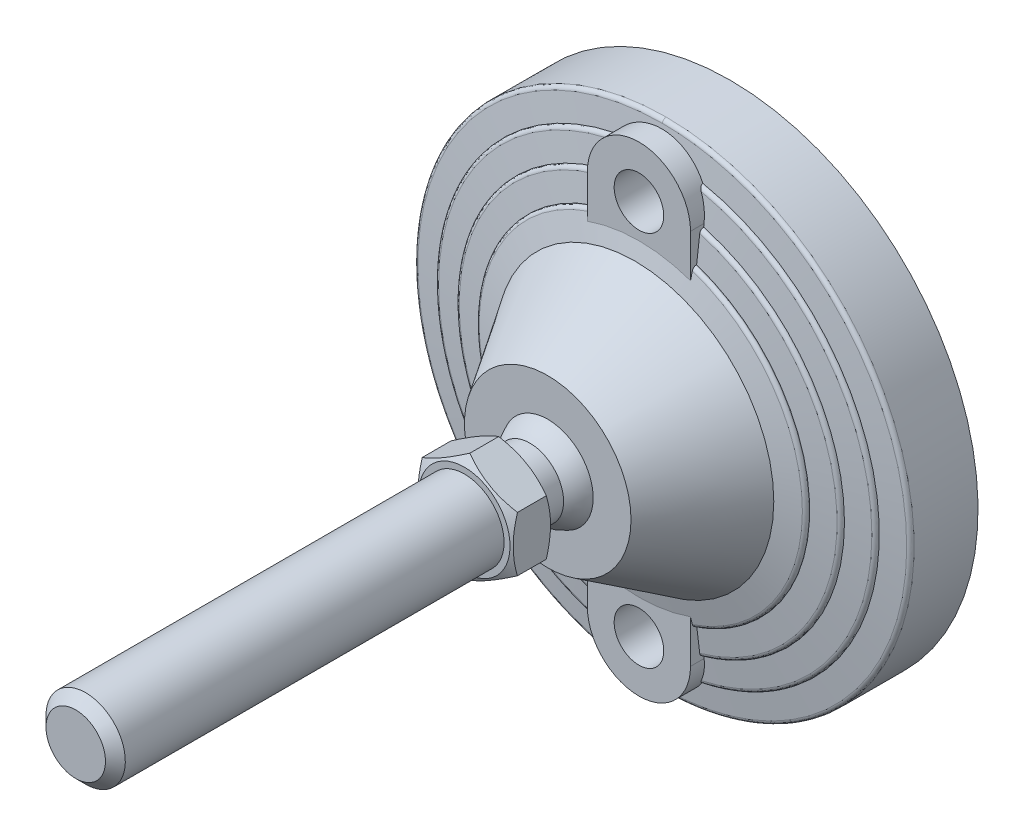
ISO-10303-21;
HEADER;
FILE_DESCRIPTION(('STEP AP214'),'2;1');
FILE_NAME('part.step','',(''),(''),'','','');
FILE_SCHEMA(('AUTOMOTIVE_DESIGN { 1 0 10303 214 1 1 1 1 }'));
ENDSEC;
DATA;
#1=APPLICATION_CONTEXT('core data for automotive mechanical design processes');
#2=APPLICATION_PROTOCOL_DEFINITION('international standard','automotive_design',2000,#1);
#3=PRODUCT_CONTEXT('',#1,'mechanical');
#4=PRODUCT('Part','Part','',(#3));
#5=PRODUCT_RELATED_PRODUCT_CATEGORY('part','',(#4));
#6=PRODUCT_DEFINITION_FORMATION('','',#4);
#7=PRODUCT_DEFINITION_CONTEXT('part definition',#1,'design');
#8=PRODUCT_DEFINITION('design','',#6,#7);
#9=PRODUCT_DEFINITION_SHAPE('','',#8);
#10=(LENGTH_UNIT() NAMED_UNIT(*) SI_UNIT(.MILLI.,.METRE.));
#11=(NAMED_UNIT(*) PLANE_ANGLE_UNIT() SI_UNIT($,.RADIAN.));
#12=(NAMED_UNIT(*) SI_UNIT($,.STERADIAN.) SOLID_ANGLE_UNIT());
#13=UNCERTAINTY_MEASURE_WITH_UNIT(LENGTH_MEASURE(1.E-05),#10,'distance_accuracy_value','');
#14=(GEOMETRIC_REPRESENTATION_CONTEXT(3) GLOBAL_UNCERTAINTY_ASSIGNED_CONTEXT((#13)) GLOBAL_UNIT_ASSIGNED_CONTEXT((#10,
#11,#12)) REPRESENTATION_CONTEXT('',''));
#15=CARTESIAN_POINT('',(0.,0.,0.));
#16=DIRECTION('',(0.,0.,1.));
#17=DIRECTION('',(1.,0.,0.));
#18=AXIS2_PLACEMENT_3D('',#15,#16,#17);
#19=CARTESIAN_POINT('',(-12.,14.022683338,60.));
#20=DIRECTION('',(0.,0.,1.));
#21=DIRECTION('',(0.,-1.,0.));
#22=AXIS2_PLACEMENT_3D('',#19,#20,#21);
#23=PLANE('',#22);
#24=CARTESIAN_POINT('',(0.,0.,60.));
#25=DIRECTION('',(0.,0.,-1.));
#26=DIRECTION('',(0.,1.,0.));
#27=AXIS2_PLACEMENT_3D('',#24,#25,#26);
#28=CIRCLE('',#27,11.5);
#29=CARTESIAN_POINT('',(0.,11.5,60.));
#30=VERTEX_POINT('',#29);
#31=EDGE_CURVE('E212',#30,#30,#28,.T.);
#32=ORIENTED_EDGE('',*,*,#31,.T.);
#33=EDGE_LOOP('',(#32));
#34=FACE_BOUND('',#33,.T.);
#35=CARTESIAN_POINT('',(0.,0.,60.));
#36=DIRECTION('',(0.,0.,-1.));
#37=DIRECTION('',(1.,0.,0.));
#38=AXIS2_PLACEMENT_3D('',#35,#36,#37);
#39=CIRCLE('',#38,8.5);
#40=CARTESIAN_POINT('',(8.5,0.,60.));
#41=VERTEX_POINT('',#40);
#42=EDGE_CURVE('E226',#41,#41,#39,.T.);
#43=ORIENTED_EDGE('',*,*,#42,.F.);
#44=EDGE_LOOP('',(#43));
#45=FACE_BOUND('',#44,.T.);
#46=ADVANCED_FACE('F14',(#34,#45),#23,.F.);
#47=CARTESIAN_POINT('',(0.,0.,60.));
#48=DIRECTION('',(0.,0.,-1.));
#49=DIRECTION('',(1.,0.,0.));
#50=AXIS2_PLACEMENT_3D('',#47,#48,#49);
#51=CYLINDRICAL_SURFACE('',#50,8.5);
#52=CARTESIAN_POINT('',(0.,0.,53.5));
#53=DIRECTION('',(0.,0.,-1.));
#54=DIRECTION('',(1.,0.,0.));
#55=AXIS2_PLACEMENT_3D('',#52,#53,#54);
#56=CIRCLE('',#55,8.5);
#57=CARTESIAN_POINT('',(8.5,0.,53.5));
#58=VERTEX_POINT('',#57);
#59=EDGE_CURVE('E1334',#58,#58,#56,.F.);
#60=ORIENTED_EDGE('',*,*,#59,.T.);
#61=EDGE_LOOP('',(#60));
#62=FACE_BOUND('',#61,.T.);
#63=ORIENTED_EDGE('',*,*,#42,.T.);
#64=EDGE_LOOP('',(#63));
#65=FACE_BOUND('',#64,.T.);
#66=ADVANCED_FACE('F1062',(#62,#65),#51,.T.);
#67=CARTESIAN_POINT('',(-55.851524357,55.66,0.));
#68=DIRECTION('',(0.,0.,1.));
#69=DIRECTION('',(0.,-1.,0.));
#70=AXIS2_PLACEMENT_3D('',#67,#68,#69);
#71=PLANE('',#70);
#72=CARTESIAN_POINT('',(0.,0.,0.));
#73=DIRECTION('',(0.,0.,-1.));
#74=DIRECTION('',(0.,1.,0.));
#75=AXIS2_PLACEMENT_3D('',#72,#73,#74);
#76=CIRCLE('',#75,55.);
#77=CARTESIAN_POINT('',(0.,55.,0.));
#78=VERTEX_POINT('',#77);
#79=EDGE_CURVE('E1336',#78,#78,#76,.F.);
#80=ORIENTED_EDGE('',*,*,#79,.F.);
#81=EDGE_LOOP('',(#80));
#82=FACE_BOUND('',#81,.T.);
#83=ADVANCED_FACE('F1053',(#82),#71,.F.);
#84=CARTESIAN_POINT('',(-8.631599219,8.622532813,53.5));
#85=DIRECTION('',(0.,0.,1.));
#86=DIRECTION('',(0.,-1.,0.));
#87=AXIS2_PLACEMENT_3D('',#84,#85,#86);
#88=PLANE('',#87);
#89=CARTESIAN_POINT('',(0.,0.,53.5));
#90=DIRECTION('',(0.,0.,-1.));
#91=DIRECTION('',(0.,1.,0.));
#92=AXIS2_PLACEMENT_3D('',#89,#90,#91);
#93=CIRCLE('',#92,8.49107182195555);
#94=CARTESIAN_POINT('',(0.,8.49107182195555,53.5));
#95=VERTEX_POINT('',#94);
#96=EDGE_CURVE('E1339',#95,#95,#93,.T.);
#97=ORIENTED_EDGE('',*,*,#96,.F.);
#98=EDGE_LOOP('',(#97));
#99=FACE_BOUND('',#98,.T.);
#100=ORIENTED_EDGE('',*,*,#59,.F.);
#101=EDGE_LOOP('',(#100));
#102=FACE_BOUND('',#101,.T.);
#103=ADVANCED_FACE('F1044',(#99,#102),#88,.F.);
#104=CARTESIAN_POINT('',(0.,0.,3.));
#105=DIRECTION('',(0.,0.,-1.));
#106=DIRECTION('',(0.,1.,0.));
#107=AXIS2_PLACEMENT_3D('',#104,#105,#106);
#108=CYLINDRICAL_SURFACE('',#107,55.);
#109=ORIENTED_EDGE('',*,*,#79,.T.);
#110=EDGE_LOOP('',(#109));
#111=FACE_BOUND('',#110,.T.);
#112=CARTESIAN_POINT('',(0.,0.,3.));
#113=DIRECTION('',(0.,0.,-1.));
#114=DIRECTION('',(0.,1.,0.));
#115=AXIS2_PLACEMENT_3D('',#112,#113,#114);
#116=CIRCLE('',#115,55.);
#117=CARTESIAN_POINT('',(0.,55.,3.));
#118=VERTEX_POINT('',#117);
#119=EDGE_CURVE('E1344',#118,#118,#116,.T.);
#120=ORIENTED_EDGE('',*,*,#119,.T.);
#121=EDGE_LOOP('',(#120));
#122=FACE_BOUND('',#121,.T.);
#123=ADVANCED_FACE('F1035',(#111,#122),#108,.T.);
#124=CARTESIAN_POINT('',(0.,0.,44.670266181));
#125=DIRECTION('',(0.,0.,-1.));
#126=DIRECTION('',(1.,0.,0.));
#127=AXIS2_PLACEMENT_3D('',#124,#125,#126);
#128=SPHERICAL_SURFACE('',#127,12.25);
#129=CARTESIAN_POINT('',(0.,0.,49.));
#130=DIRECTION('',(0.,0.,-1.));
#131=DIRECTION('',(0.,1.,0.));
#132=AXIS2_PLACEMENT_3D('',#129,#130,#131);
#133=CIRCLE('',#132,11.4593152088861);
#134=CARTESIAN_POINT('',(0.,11.4593152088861,49.));
#135=VERTEX_POINT('',#134);
#136=EDGE_CURVE('E1347',#135,#135,#133,.F.);
#137=ORIENTED_EDGE('',*,*,#136,.T.);
#138=EDGE_LOOP('',(#137));
#139=FACE_BOUND('',#138,.T.);
#140=ORIENTED_EDGE('',*,*,#96,.T.);
#141=EDGE_LOOP('',(#140));
#142=FACE_BOUND('',#141,.T.);
#143=ADVANCED_FACE('F1026',(#139,#142),#128,.T.);
#144=CARTESIAN_POINT('',(-6.346764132,-41.175,3.));
#145=DIRECTION('',(0.,0.,1.));
#146=DIRECTION('',(0.,-1.,0.));
#147=AXIS2_PLACEMENT_3D('',#144,#145,#146);
#148=PLANE('',#147);
#149=CARTESIAN_POINT('',(0.,-47.5,3.));
#150=DIRECTION('',(0.,0.,1.));
#151=DIRECTION('',(0.,-1.,0.));
#152=AXIS2_PLACEMENT_3D('',#149,#150,#151);
#153=CIRCLE('',#152,6.25);
#154=CARTESIAN_POINT('',(0.,-53.75,3.));
#155=VERTEX_POINT('',#154);
#156=EDGE_CURVE('E451',#155,#155,#153,.T.);
#157=ORIENTED_EDGE('',*,*,#156,.T.);
#158=EDGE_LOOP('',(#157));
#159=FACE_BOUND('',#158,.T.);
#160=ADVANCED_FACE('F1017',(#159),#148,.T.);
#161=CARTESIAN_POINT('',(-63.467641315,63.25,3.));
#162=DIRECTION('',(0.,0.,1.));
#163=DIRECTION('',(0.,-1.,0.));
#164=AXIS2_PLACEMENT_3D('',#161,#162,#163);
#165=PLANE('',#164);
#166=ORIENTED_EDGE('',*,*,#119,.F.);
#167=EDGE_LOOP('',(#166));
#168=FACE_BOUND('',#167,.T.);
#169=CARTESIAN_POINT('',(0.,0.,3.));
#170=DIRECTION('',(0.,0.,-1.));
#171=DIRECTION('',(0.,1.,0.));
#172=AXIS2_PLACEMENT_3D('',#169,#170,#171);
#173=CIRCLE('',#172,62.5);
#174=CARTESIAN_POINT('',(0.,62.5,3.));
#175=VERTEX_POINT('',#174);
#176=EDGE_CURVE('E414',#175,#175,#173,.F.);
#177=ORIENTED_EDGE('',*,*,#176,.F.);
#178=EDGE_LOOP('',(#177));
#179=FACE_BOUND('',#178,.T.);
#180=ADVANCED_FACE('F1009',(#168,#179),#165,.F.);
#181=CARTESIAN_POINT('',(-21.325127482,-21.252,49.));
#182=DIRECTION('',(0.,0.,-1.));
#183=DIRECTION('',(0.,1.,0.));
#184=AXIS2_PLACEMENT_3D('',#181,#182,#183);
#185=PLANE('',#184);
#186=ORIENTED_EDGE('',*,*,#136,.F.);
#187=EDGE_LOOP('',(#186));
#188=FACE_BOUND('',#187,.T.);
#189=CARTESIAN_POINT('',(0.,0.,49.));
#190=DIRECTION('',(0.,0.,-1.));
#191=DIRECTION('',(1.,0.,0.));
#192=AXIS2_PLACEMENT_3D('',#189,#190,#191);
#193=CIRCLE('',#192,21.);
#194=CARTESIAN_POINT('',(21.,0.,49.));
#195=VERTEX_POINT('',#194);
#196=EDGE_CURVE('E721',#195,#195,#193,.T.);
#197=ORIENTED_EDGE('',*,*,#196,.F.);
#198=EDGE_LOOP('',(#197));
#199=FACE_BOUND('',#198,.T.);
#200=ADVANCED_FACE('F1000',(#188,#199),#185,.F.);
#201=CARTESIAN_POINT('',(0.,-47.5,3.));
#202=DIRECTION('',(0.,0.,1.));
#203=DIRECTION('',(0.,-1.,0.));
#204=AXIS2_PLACEMENT_3D('',#201,#202,#203);
#205=CYLINDRICAL_SURFACE('',#204,6.25);
#206=ORIENTED_EDGE('',*,*,#156,.F.);
#207=EDGE_LOOP('',(#206));
#208=FACE_BOUND('',#207,.T.);
#209=CARTESIAN_POINT('',(0.,-47.5,26.));
#210=DIRECTION('',(0.,0.,1.));
#211=DIRECTION('',(0.,-1.,0.));
#212=AXIS2_PLACEMENT_3D('',#209,#210,#211);
#213=CIRCLE('',#212,6.25);
#214=CARTESIAN_POINT('',(0.,-53.75,26.));
#215=VERTEX_POINT('',#214);
#216=EDGE_CURVE('E720',#215,#215,#213,.T.);
#217=ORIENTED_EDGE('',*,*,#216,.T.);
#218=EDGE_LOOP('',(#217));
#219=FACE_BOUND('',#218,.T.);
#220=ADVANCED_FACE('F992',(#208,#219),#205,.F.);
#221=CARTESIAN_POINT('',(-6.346764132,53.825,3.));
#222=DIRECTION('',(0.,0.,1.));
#223=DIRECTION('',(0.,-1.,0.));
#224=AXIS2_PLACEMENT_3D('',#221,#222,#223);
#225=PLANE('',#224);
#226=CARTESIAN_POINT('',(0.,47.5,3.));
#227=DIRECTION('',(0.,0.,1.));
#228=DIRECTION('',(0.,-1.,0.));
#229=AXIS2_PLACEMENT_3D('',#226,#227,#228);
#230=CIRCLE('',#229,6.25);
#231=CARTESIAN_POINT('',(0.,41.25,3.));
#232=VERTEX_POINT('',#231);
#233=EDGE_CURVE('E239',#232,#232,#230,.T.);
#234=ORIENTED_EDGE('',*,*,#233,.T.);
#235=EDGE_LOOP('',(#234));
#236=FACE_BOUND('',#235,.T.);
#237=ADVANCED_FACE('F335',(#236),#225,.T.);
#238=CARTESIAN_POINT('',(12.406354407,39.602176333,24.568111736));
#239=CARTESIAN_POINT('',(59.707464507,24.78394183,24.568111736));
#240=CARTESIAN_POINT('',(59.707464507,-24.78394183,24.568111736));
#241=CARTESIAN_POINT('',(12.406354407,-39.602176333,24.568111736));
#242=CARTESIAN_POINT('',(12.406354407,39.602176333,25.044046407));
#243=CARTESIAN_POINT('',(59.707464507,24.78394183,25.044046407));
#244=CARTESIAN_POINT('',(59.707464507,-24.78394183,25.044046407));
#245=CARTESIAN_POINT('',(12.406354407,-39.602176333,25.044046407));
#246=CARTESIAN_POINT('',(12.31903347,39.323440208,25.419805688));
#247=CARTESIAN_POINT('',(59.287219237,24.609502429,25.419805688));
#248=CARTESIAN_POINT('',(59.287219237,-24.609502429,25.419805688));
#249=CARTESIAN_POINT('',(12.31903347,-39.323440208,25.419805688));
#250=CARTESIAN_POINT('',(12.18115046,38.883305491,25.53720891));
#251=CARTESIAN_POINT('',(58.623636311,24.334056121,25.53720891));
#252=CARTESIAN_POINT('',(58.623636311,-24.334056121,25.53720891));
#253=CARTESIAN_POINT('',(12.18115046,-38.883305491,25.53720891));
#254=(BOUNDED_SURFACE() B_SPLINE_SURFACE(3,3,((#238,#239,#240,#241),(#242,#243,#244,#245),(#246,
#247,#248,#249),(#250,#251,#252,#253)),.UNSPECIFIED.,.F.,.F.,
.F.) B_SPLINE_SURFACE_WITH_KNOTS((4,4),(4,4),(0.,1.),(0.,1.),
.UNSPECIFIED.) GEOMETRIC_REPRESENTATION_ITEM() RATIONAL_B_SPLINE_SURFACE(((1.,0.532632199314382,
0.532632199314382,1.),(0.859679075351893,0.457892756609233,0.457892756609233,0.859679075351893),
(0.859679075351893,0.457892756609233,0.457892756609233,0.859679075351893),(1.,0.532632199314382,
0.532632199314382,1.))) REPRESENTATION_ITEM('') SURFACE());
#255=CARTESIAN_POINT('',(0.,0.,25.5372089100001));
#256=DIRECTION('',(0.,0.,-1.));
#257=DIRECTION('',(0.,1.,0.));
#258=AXIS2_PLACEMENT_3D('',#255,#256,#257);
#259=CIRCLE('',#258,40.746679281);
#260=CARTESIAN_POINT('',(13.,-38.6172483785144,25.537208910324));
#261=VERTEX_POINT('',#260);
#262=CARTESIAN_POINT('',(13.,38.6172483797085,25.5372089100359));
#263=VERTEX_POINT('',#262);
#264=EDGE_CURVE('E452',#261,#263,#259,.F.);
#265=CARTESIAN_POINT('',(13.,-39.4112927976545,24.5681117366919));
#266=CARTESIAN_POINT('',(13.,-39.4112933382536,24.59521048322));
#267=CARTESIAN_POINT('',(13.,-39.4101321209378,24.6222958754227));
#268=CARTESIAN_POINT('',(13.,-39.405504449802,24.6762650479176));
#269=CARTESIAN_POINT('',(13.,-39.4020383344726,24.7031488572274));
#270=CARTESIAN_POINT('',(13.,-39.3882336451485,24.7831079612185));
#271=CARTESIAN_POINT('',(13.,-39.3744885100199,24.8356344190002));
#272=CARTESIAN_POINT('',(13.,-39.3384084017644,24.937608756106));
#273=CARTESIAN_POINT('',(13.,-39.3160736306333,24.9870567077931));
#274=CARTESIAN_POINT('',(13.,-39.263590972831,25.0816017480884));
#275=CARTESIAN_POINT('',(13.,-39.233444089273,25.1266993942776));
#276=CARTESIAN_POINT('',(13.,-39.1656058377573,25.2123360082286));
#277=CARTESIAN_POINT('',(13.,-39.1277714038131,25.2527614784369));
#278=CARTESIAN_POINT('',(13.,-39.0461074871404,25.327071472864));
#279=CARTESIAN_POINT('',(13.,-39.0022718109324,25.3609491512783));
#280=CARTESIAN_POINT('',(13.,-38.9043172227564,25.4250520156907));
#281=CARTESIAN_POINT('',(13.,-38.8495953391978,25.454364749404));
#282=CARTESIAN_POINT('',(13.,-38.7644641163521,25.4909906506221));
#283=CARTESIAN_POINT('',(13.,-38.7355751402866,25.5019763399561));
#284=CARTESIAN_POINT('',(13.,-38.6769796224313,25.5214626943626));
#285=CARTESIAN_POINT('',(13.,-38.6472733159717,25.5299640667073));
#286=CARTESIAN_POINT('',(13.,-38.6172483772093,25.5372089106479));
#287=B_SPLINE_CURVE_WITH_KNOTS('',3,(#265,#266,#267,#268,#269,#270,#271,#272,#273,#274,#275,
#276,#277,#278,#279,#280,#281,#282,#283,#284,#285,#286),.UNSPECIFIED.,.F.,.F.,(4,2,2,2,2,2,2,2,
2,2,4),(0.,0.0812450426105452,0.162478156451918,0.32451953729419,0.486557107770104,
0.648573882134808,0.813939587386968,0.979477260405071,1.16468654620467,1.25731455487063,
1.34991616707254),.UNSPECIFIED.);
#288=CARTESIAN_POINT('',(13.,-39.4112927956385,24.568111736));
#289=VERTEX_POINT('',#288);
#290=EDGE_CURVE('E321',#289,#261,#287,.T.);
#291=CARTESIAN_POINT('',(0.,0.,24.568111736));
#292=DIRECTION('',(0.,0.,-1.));
#293=DIRECTION('',(0.,1.,0.));
#294=AXIS2_PLACEMENT_3D('',#291,#292,#293);
#295=CIRCLE('',#294,41.5);
#296=CARTESIAN_POINT('',(13.,39.4112927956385,24.5681117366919));
#297=VERTEX_POINT('',#296);
#298=EDGE_CURVE('E449',#297,#289,#295,.T.);
#299=CARTESIAN_POINT('',(13.,38.6172483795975,25.5372089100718));
#300=CARTESIAN_POINT('',(13.,38.6757273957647,25.5231434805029));
#301=CARTESIAN_POINT('',(13.,38.7330575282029,25.5042077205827));
#302=CARTESIAN_POINT('',(13.,38.843898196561,25.4570874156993));
#303=CARTESIAN_POINT('',(13.,38.8974017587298,25.4288864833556));
#304=CARTESIAN_POINT('',(13.,38.9989209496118,25.3637346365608));
#305=CARTESIAN_POINT('',(13.,39.0469285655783,25.3267711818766));
#306=CARTESIAN_POINT('',(13.,39.1357078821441,25.2450475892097));
#307=CARTESIAN_POINT('',(13.,39.1764870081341,25.2002955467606));
#308=CARTESIAN_POINT('',(13.,39.2479885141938,25.1059931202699));
#309=CARTESIAN_POINT('',(13.,39.2790300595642,25.0566848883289));
#310=CARTESIAN_POINT('',(13.,39.3318958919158,24.9533393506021));
#311=CARTESIAN_POINT('',(13.,39.3537228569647,24.8993034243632));
#312=CARTESIAN_POINT('',(13.,39.3839717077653,24.7991363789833));
#313=CARTESIAN_POINT('',(13.,39.3941848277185,24.7535382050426));
#314=CARTESIAN_POINT('',(13.,39.4078594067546,24.6613400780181));
#315=CARTESIAN_POINT('',(13.,39.411320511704,24.6147400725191));
#316=CARTESIAN_POINT('',(13.,39.4112927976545,24.5681117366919));
#317=B_SPLINE_CURVE_WITH_KNOTS('',3,(#299,#300,#301,#302,#303,#304,#305,#306,#307,#308,#309,
#310,#311,#312,#313,#314,#315,#316),.UNSPECIFIED.,.F.,.F.,(4,2,2,2,2,2,2,2,4),(0.,
0.180276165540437,0.360872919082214,0.541729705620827,0.722399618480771,0.89631033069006,
1.07017046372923,1.20986980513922,1.34957647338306),.UNSPECIFIED.);
#318=EDGE_CURVE('E238',#263,#297,#317,.T.);
#319=ORIENTED_EDGE('',*,*,#264,.F.);
#320=ORIENTED_EDGE('',*,*,#290,.F.);
#321=ORIENTED_EDGE('',*,*,#298,.F.);
#322=ORIENTED_EDGE('',*,*,#318,.F.);
#323=EDGE_LOOP('',(#319,#320,#321,#322));
#324=FACE_BOUND('',#323,.T.);
#325=ADVANCED_FACE('F919',(#324),#254,.T.);
#326=CARTESIAN_POINT('',(0.,0.,24.568111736));
#327=DIRECTION('',(0.,0.,-1.));
#328=DIRECTION('',(0.,1.,0.));
#329=AXIS2_PLACEMENT_3D('',#326,#327,#328);
#330=CYLINDRICAL_SURFACE('',#329,41.5);
#331=CARTESIAN_POINT('',(0.,0.,24.454545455));
#332=DIRECTION('',(0.,0.,-1.));
#333=DIRECTION('',(0.,1.,0.));
#334=AXIS2_PLACEMENT_3D('',#331,#332,#333);
#335=CIRCLE('',#334,41.5);
#336=CARTESIAN_POINT('',(13.,39.4112927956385,24.454545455));
#337=VERTEX_POINT('',#336);
#338=CARTESIAN_POINT('',(13.,-39.4112927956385,24.4545454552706));
#339=VERTEX_POINT('',#338);
#340=EDGE_CURVE('E447',#337,#339,#335,.T.);
#341=ORIENTED_EDGE('',*,*,#340,.F.);
#342=DIRECTION('',(0.,0.,-1.));
#343=VECTOR('',#342,1.);
#344=CARTESIAN_POINT('',(13.,39.4112927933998,24.2785712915));
#345=LINE('',#344,#343);
#346=EDGE_CURVE('E291',#297,#337,#345,.T.);
#347=ORIENTED_EDGE('',*,*,#346,.F.);
#348=ORIENTED_EDGE('',*,*,#298,.T.);
#349=DIRECTION('',(0.,0.,1.));
#350=VECTOR('',#349,1.);
#351=CARTESIAN_POINT('',(13.,-39.4112927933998,24.2785712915));
#352=LINE('',#351,#350);
#353=EDGE_CURVE('E319',#339,#289,#352,.T.);
#354=ORIENTED_EDGE('',*,*,#353,.F.);
#355=EDGE_LOOP('',(#341,#347,#348,#354));
#356=FACE_BOUND('',#355,.T.);
#357=ADVANCED_FACE('F303',(#356),#330,.T.);
#358=CARTESIAN_POINT('',(0.,0.,24.454545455));
#359=DIRECTION('',(0.,0.,-1.));
#360=DIRECTION('',(0.,1.,0.));
#361=AXIS2_PLACEMENT_3D('',#358,#359,#360);
#362=CONICAL_SURFACE('',#361,41.5,1.4442041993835);
#363=ORIENTED_EDGE('',*,*,#340,.T.);
#364=CARTESIAN_POINT('',(13.0000000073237,-45.8176832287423,23.6748403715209));
#365=CARTESIAN_POINT('',(13.0000000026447,-45.2838642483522,23.7402005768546));
#366=CARTESIAN_POINT('',(13.000000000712,-44.7500350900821,23.8054777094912));
#367=CARTESIAN_POINT('',(12.999999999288,-43.6823542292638,23.9358466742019));
#368=CARTESIAN_POINT('',(12.9999999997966,-43.1485025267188,24.0009385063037));
#369=CARTESIAN_POINT('',(13.0000000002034,-42.0807742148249,24.1309177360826));
#370=CARTESIAN_POINT('',(13.0000000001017,-41.5468976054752,24.195805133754));
#371=CARTESIAN_POINT('',(12.9999999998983,-40.4791166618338,24.3253520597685));
#372=CARTESIAN_POINT('',(12.9999999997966,-39.9452123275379,24.3900115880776));
#373=CARTESIAN_POINT('',(13.,-39.4112927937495,24.4545454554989));
#374=B_SPLINE_CURVE_WITH_KNOTS('',3,(#364,#365,#366,#367,#368,#369,#370,#371,#372,#373),
.UNSPECIFIED.,.F.,.F.,(4,2,2,2,4),(0.,1.61341623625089,3.22683223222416,4.84024827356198,
6.4536645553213),.UNSPECIFIED.);
#375=CARTESIAN_POINT('',(13.,-45.8176832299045,23.674840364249));
#376=VERTEX_POINT('',#375);
#377=EDGE_CURVE('E311',#376,#339,#374,.T.);
#378=ORIENTED_EDGE('',*,*,#377,.F.);
#379=CARTESIAN_POINT('',(-7.48558333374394E-10,0.,23.674840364));
#380=DIRECTION('',(0.,0.,-1.));
#381=DIRECTION('',(0.,1.,0.));
#382=AXIS2_PLACEMENT_3D('',#379,#380,#381);
#383=CIRCLE('',#382,47.6262542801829);
#384=CARTESIAN_POINT('',(13.,45.8176832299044,23.6748403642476));
#385=VERTEX_POINT('',#384);
#386=EDGE_CURVE('E412',#385,#376,#383,.T.);
#387=ORIENTED_EDGE('',*,*,#386,.F.);
#388=CARTESIAN_POINT('',(13.,39.4112927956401,24.4545454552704));
#389=CARTESIAN_POINT('',(13.,39.9452123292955,24.3900115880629));
#390=CARTESIAN_POINT('',(13.,40.4791166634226,24.3253520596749));
#391=CARTESIAN_POINT('',(13.,41.5468976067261,24.195805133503));
#392=CARTESIAN_POINT('',(13.,42.0807742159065,24.1309177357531));
#393=CARTESIAN_POINT('',(13.,43.1485025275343,24.0009385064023));
#394=CARTESIAN_POINT('',(13.,43.6823542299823,23.9358466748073));
#395=CARTESIAN_POINT('',(13.,44.7500350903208,23.805477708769));
#396=CARTESIAN_POINT('',(13.,45.283864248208,23.7402005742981));
#397=CARTESIAN_POINT('',(13.,45.8176832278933,23.6748403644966));
#398=B_SPLINE_CURVE_WITH_KNOTS('',3,(#388,#389,#390,#391,#392,#393,#394,#395,#396,#397),
.UNSPECIFIED.,.F.,.F.,(4,2,2,2,4),(0.,1.61341628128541,3.22683232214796,4.84024831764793,
6.45366455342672),.UNSPECIFIED.);
#399=EDGE_CURVE('E283',#337,#385,#398,.T.);
#400=ORIENTED_EDGE('',*,*,#399,.F.);
#401=EDGE_LOOP('',(#363,#378,#387,#400));
#402=FACE_BOUND('',#401,.T.);
#403=ADVANCED_FACE('F298',(#402),#362,.T.);
#404=CARTESIAN_POINT('',(12.269850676,46.922284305,22.669623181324));
#405=CARTESIAN_POINT('',(72.557631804,31.157449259,22.669623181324));
#406=CARTESIAN_POINT('',(72.557631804,-31.157449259,22.669623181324));
#407=CARTESIAN_POINT('',(12.269850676,-46.922284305,22.669623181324));
#408=CARTESIAN_POINT('',(12.269850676,46.922284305,22.6740296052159));
#409=CARTESIAN_POINT('',(72.557631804,31.157449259,22.674029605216));
#410=CARTESIAN_POINT('',(72.557631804,-31.157449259,22.674029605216));
#411=CARTESIAN_POINT('',(12.269850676,-46.922284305,22.6740296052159));
#412=CARTESIAN_POINT('',(12.269850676,46.922284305,22.678436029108));
#413=CARTESIAN_POINT('',(72.557631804,31.157449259,22.678436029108));
#414=CARTESIAN_POINT('',(72.557631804,-31.157449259,22.678436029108));
#415=CARTESIAN_POINT('',(12.269850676,-46.922284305,22.678436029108));
#416=CARTESIAN_POINT('',(12.269850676,46.922284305,22.682842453));
#417=CARTESIAN_POINT('',(72.557631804,31.157449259,22.682842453));
#418=CARTESIAN_POINT('',(72.557631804,-31.157449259,22.682842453));
#419=CARTESIAN_POINT('',(12.269850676,-46.922284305,22.682842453));
#420=CARTESIAN_POINT('',(12.269850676,46.922284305,23.211436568));
#421=CARTESIAN_POINT('',(72.557631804,31.157449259,23.211436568));
#422=CARTESIAN_POINT('',(72.557631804,-31.157449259,23.211436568));
#423=CARTESIAN_POINT('',(12.269850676,-46.922284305,23.211436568));
#424=CARTESIAN_POINT('',(12.181461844,46.584268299,23.608103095));
#425=CARTESIAN_POINT('',(72.034945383,30.93299905,23.608103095));
#426=CARTESIAN_POINT('',(72.034945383,-30.93299905,23.608103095));
#427=CARTESIAN_POINT('',(12.181461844,-46.584268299,23.608103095));
#428=CARTESIAN_POINT('',(12.048804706,46.076961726,23.674840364));
#429=CARTESIAN_POINT('',(71.250478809,30.596136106,23.674840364));
#430=CARTESIAN_POINT('',(71.250478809,-30.596136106,23.674840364));
#431=CARTESIAN_POINT('',(12.048804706,-46.076961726,23.674840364));
#432=(BOUNDED_SURFACE() B_SPLINE_SURFACE(3,3,((#404,#405,#406,#407),(#408,#409,#410,#411),(#412,
#413,#414,#415),(#416,#417,#418,#419),(#420,#421,#422,#423),(#424,#425,#426,#427),(#428,#429,
#430,#431)),.UNSPECIFIED.,.F.,.F.,.F.) B_SPLINE_SURFACE_WITH_KNOTS((4,3,4),(4,4),(-0.01,0.,1.),
(0.,1.),.UNSPECIFIED.) GEOMETRIC_REPRESENTATION_ITEM() RATIONAL_B_SPLINE_SURFACE(((1.,
0.501991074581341,0.501991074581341,1.),(1.,0.501991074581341,0.501991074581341,1.),(1.,
0.501991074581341,0.501991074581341,1.),(1.,0.501991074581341,0.501991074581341,1.),
(0.833611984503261,0.418465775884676,0.418465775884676,0.833611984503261),(0.833611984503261,
0.418465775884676,0.418465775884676,0.833611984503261),(1.,0.501991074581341,0.501991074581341,1.))) REPRESENTATION_ITEM('') SURFACE());
#433=CARTESIAN_POINT('',(13.,-46.7252608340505,22.6777848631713));
#434=CARTESIAN_POINT('',(13.,-46.7253979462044,22.7054287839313));
#435=CARTESIAN_POINT('',(13.,-46.7243484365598,22.7330653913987));
#436=CARTESIAN_POINT('',(13.,-46.7198870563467,22.7881439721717));
#437=CARTESIAN_POINT('',(13.,-46.7164754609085,22.8155859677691));
#438=CARTESIAN_POINT('',(13.,-46.7027375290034,22.8972169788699));
#439=CARTESIAN_POINT('',(13.,-46.688908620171,22.9508576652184));
#440=CARTESIAN_POINT('',(13.,-46.6523707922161,23.0550506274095));
#441=CARTESIAN_POINT('',(13.,-46.6296523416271,23.1055995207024));
#442=CARTESIAN_POINT('',(13.,-46.5760978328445,23.2021956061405));
#443=CARTESIAN_POINT('',(13.,-46.545261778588,23.248242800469));
#444=CARTESIAN_POINT('',(13.,-46.4762858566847,23.3348542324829));
#445=CARTESIAN_POINT('',(13.,-46.438110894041,23.3753904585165));
#446=CARTESIAN_POINT('',(13.,-46.3556866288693,23.4497572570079));
#447=CARTESIAN_POINT('',(13.,-46.3114344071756,23.4835845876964));
#448=CARTESIAN_POINT('',(13.,-46.2164675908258,23.5448274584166));
#449=CARTESIAN_POINT('',(13.,-46.1655796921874,23.5719736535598));
#450=CARTESIAN_POINT('',(13.,-46.0601083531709,23.6176355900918));
#451=CARTESIAN_POINT('',(13.,-46.0055288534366,23.6361603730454));
#452=CARTESIAN_POINT('',(13.,-45.9281089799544,23.6556819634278));
#453=CARTESIAN_POINT('',(13.,-45.9061721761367,23.660484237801));
#454=CARTESIAN_POINT('',(13.,-45.8620822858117,23.6686997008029));
#455=CARTESIAN_POINT('',(13.,-45.8399296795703,23.6721154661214));
#456=CARTESIAN_POINT('',(13.0000000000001,-45.817683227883,23.6748403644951));
#457=B_SPLINE_CURVE_WITH_KNOTS('',3,(#433,#434,#435,#436,#437,#438,#439,#440,#441,#442,#443,
#444,#445,#446,#447,#448,#449,#450,#451,#452,#453,#454,#455,#456),.UNSPECIFIED.,.F.,.F.,(4,2,2,
2,2,2,2,2,2,2,2,4),(0.,0.0828810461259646,0.165752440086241,0.331061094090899,0.496547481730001,
0.662033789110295,0.828332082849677,0.994710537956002,1.16697834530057,1.33906508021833,
1.40639957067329,1.47360834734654),.UNSPECIFIED.);
#458=CARTESIAN_POINT('',(13.0000000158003,-46.7252608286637,22.6777848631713));
#459=VERTEX_POINT('',#458);
#460=EDGE_CURVE('E320',#459,#376,#457,.T.);
#461=CARTESIAN_POINT('',(13.0000000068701,46.7252608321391,22.6727272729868));
#462=CARTESIAN_POINT('',(13.3212147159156,46.635891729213,22.6727272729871));
#463=CARTESIAN_POINT('',(13.6414983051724,46.5432129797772,22.6727272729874));
#464=CARTESIAN_POINT('',(14.2801231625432,46.3512597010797,22.672727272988));
#465=CARTESIAN_POINT('',(14.5984642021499,46.2519844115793,22.6727272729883));
#466=CARTESIAN_POINT('',(15.5526106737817,45.9435979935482,22.6727272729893));
#467=CARTESIAN_POINT('',(16.1852411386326,45.7245656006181,22.6727272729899));
#468=CARTESIAN_POINT('',(17.4409289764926,45.2604918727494,22.6727272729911));
#469=CARTESIAN_POINT('',(18.0639854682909,45.01544815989,22.6727272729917));
#470=CARTESIAN_POINT('',(19.3000708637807,44.4995075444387,22.672727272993));
#471=CARTESIAN_POINT('',(19.9130888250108,44.228584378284,22.6727272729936));
#472=CARTESIAN_POINT('',(21.1274202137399,43.6615551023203,22.6727272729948));
#473=CARTESIAN_POINT('',(21.7287319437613,43.3654453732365,22.6727272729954));
#474=CARTESIAN_POINT('',(23.5288179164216,42.4321391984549,22.6727272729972));
#475=CARTESIAN_POINT('',(24.7079785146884,41.7565378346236,22.6727272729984));
#476=CARTESIAN_POINT('',(27.0057517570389,40.308619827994,22.6727272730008));
#477=CARTESIAN_POINT('',(28.1243409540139,39.5362661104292,22.672727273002));
#478=CARTESIAN_POINT('',(30.294054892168,37.8994558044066,22.6727272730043));
#479=CARTESIAN_POINT('',(31.3451007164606,37.0348945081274,22.6727272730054));
#480=CARTESIAN_POINT('',(33.3707378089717,35.2206260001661,22.6727272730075));
#481=CARTESIAN_POINT('',(34.3453363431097,34.2709268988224,22.6727272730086));
#482=CARTESIAN_POINT('',(36.2141318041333,32.2900336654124,22.6727272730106));
#483=CARTESIAN_POINT('',(37.1080775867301,31.258602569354,22.6727272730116));
#484=CARTESIAN_POINT('',(38.8059105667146,29.1240638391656,22.6727272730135));
#485=CARTESIAN_POINT('',(39.6097954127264,28.0209543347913,22.6727272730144));
#486=CARTESIAN_POINT('',(41.1215543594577,25.7512426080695,22.6727272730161));
#487=CARTESIAN_POINT('',(41.8294551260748,24.5846581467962,22.6727272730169));
#488=CARTESIAN_POINT('',(43.1444737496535,22.1960153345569,22.6727272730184));
#489=CARTESIAN_POINT('',(43.7515922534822,20.9739573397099,22.6727272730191));
#490=CARTESIAN_POINT('',(44.8608053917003,18.482892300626,22.6727272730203));
#491=CARTESIAN_POINT('',(45.362887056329,17.2138794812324,22.6727272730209));
#492=CARTESIAN_POINT('',(46.2583633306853,14.6380667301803,22.6727272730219));
#493=CARTESIAN_POINT('',(46.6517577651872,13.331266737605,22.6727272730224));
#494=CARTESIAN_POINT('',(47.3270705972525,10.6891374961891,22.6727272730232));
#495=CARTESIAN_POINT('',(47.6089860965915,9.3538075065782,22.6727272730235));
#496=CARTESIAN_POINT('',(48.0593220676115,6.66414532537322,22.672727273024));
#497=CARTESIAN_POINT('',(48.2277425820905,5.30981314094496,22.6727272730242));
#498=CARTESIAN_POINT('',(48.4498861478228,2.5918387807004,22.6727272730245));
#499=CARTESIAN_POINT('',(48.5036145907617,1.2281970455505,22.6727272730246));
#500=CARTESIAN_POINT('',(48.4960080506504,-1.49876561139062,22.6727272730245));
#501=CARTESIAN_POINT('',(48.4346730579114,-2.86208653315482,22.6727272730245));
#502=CARTESIAN_POINT('',(48.1973677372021,-5.57880747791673,22.6727272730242));
#503=CARTESIAN_POINT('',(48.021389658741,-6.93220682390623,22.672727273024));
#504=CARTESIAN_POINT('',(47.5560413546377,-9.61936956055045,22.6727272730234));
#505=CARTESIAN_POINT('',(47.2666711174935,-10.9531329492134,22.6727272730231));
#506=CARTESIAN_POINT('',(46.5765756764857,-13.5916227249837,22.6727272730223));
#507=CARTESIAN_POINT('',(46.1758433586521,-14.8963472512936,22.6727272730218));
#508=CARTESIAN_POINT('',(45.2658742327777,-17.467402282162,22.6727272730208));
#509=CARTESIAN_POINT('',(44.7566374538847,-18.7337327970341,22.6727272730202));
#510=CARTESIAN_POINT('',(43.6334165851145,-21.218718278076,22.6727272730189));
#511=CARTESIAN_POINT('',(43.0194530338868,-22.4373825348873,22.6727272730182));
#512=CARTESIAN_POINT('',(41.6909757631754,-24.8187625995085,22.6727272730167));
#513=CARTESIAN_POINT('',(40.9764619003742,-25.9814783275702,22.6727272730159));
#514=CARTESIAN_POINT('',(39.7063025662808,-27.8655028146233,22.6727272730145));
#515=CARTESIAN_POINT('',(39.1770724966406,-28.6047764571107,22.6727272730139));
#516=CARTESIAN_POINT('',(38.0778809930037,-30.052466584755,22.6727272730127));
#517=CARTESIAN_POINT('',(37.5079195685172,-30.7608830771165,22.6727272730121));
#518=CARTESIAN_POINT('',(36.3291070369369,-32.1445499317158,22.6727272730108));
#519=CARTESIAN_POINT('',(35.7202564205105,-32.8198007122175,22.6727272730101));
#520=CARTESIAN_POINT('',(34.4653645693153,-34.1352484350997,22.6727272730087));
#521=CARTESIAN_POINT('',(33.8193109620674,-34.7754335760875,22.672727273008));
#522=CARTESIAN_POINT('',(32.4922294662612,-36.0184899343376,22.6727272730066));
#523=CARTESIAN_POINT('',(31.8112009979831,-36.6213605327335,22.6727272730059));
#524=CARTESIAN_POINT('',(30.4163089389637,-37.7878929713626,22.6727272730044));
#525=CARTESIAN_POINT('',(29.7024437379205,-38.351552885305,22.6727272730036));
#526=CARTESIAN_POINT('',(28.1769516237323,-39.4879139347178,22.672727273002));
#527=CARTESIAN_POINT('',(27.3623770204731,-40.0566641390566,22.6727272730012));
#528=CARTESIAN_POINT('',(25.6997855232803,-41.1431320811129,22.6727272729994));
#529=CARTESIAN_POINT('',(24.8517655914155,-41.6608451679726,22.6727272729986));
#530=CARTESIAN_POINT('',(23.1254909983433,-42.6432641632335,22.6727272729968));
#531=CARTESIAN_POINT('',(22.2472346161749,-43.1079670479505,22.6727272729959));
#532=CARTESIAN_POINT('',(20.462387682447,-43.9832963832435,22.6727272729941));
#533=CARTESIAN_POINT('',(19.5557530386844,-44.3938329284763,22.6727272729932));
#534=CARTESIAN_POINT('',(17.7189637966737,-45.1583612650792,22.6727272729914));
#535=CARTESIAN_POINT('',(16.7888095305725,-45.5123538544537,22.6727272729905));
#536=CARTESIAN_POINT('',(14.9085132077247,-46.1625049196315,22.6727272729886));
#537=CARTESIAN_POINT('',(13.9583713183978,-46.4586638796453,22.6727272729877));
#538=CARTESIAN_POINT('',(13.0000000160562,-46.7252608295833,22.6727272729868));
#539=B_SPLINE_CURVE_WITH_KNOTS('',3,(#461,#462,#463,#464,#465,#466,#467,#468,#469,#470,#471,
#472,#473,#474,#475,#476,#477,#478,#479,#480,#481,#482,#483,#484,#485,#486,#487,#488,#489,#490,
#491,#492,#493,#494,#495,#496,#497,#498,#499,#500,#501,#502,#503,#504,#505,#506,#507,#508,#509,
#510,#511,#512,#513,#514,#515,#516,#517,#518,#519,#520,#521,#522,#523,#524,#525,#526,#527,#528,
#529,#530,#531,#532,#533,#534,#535,#536,#537,#538),.UNSPECIFIED.,.F.,.F.,(4,2,2,2,2,2,2,2,2,2,2,
2,2,2,2,2,2,2,2,2,2,2,2,2,2,2,2,2,2,2,2,2,2,2,2,2,2,2,4),(0.,1.00020816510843,2.00053180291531,
4.00833027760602,6.01631246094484,8.02635452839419,10.0366859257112,14.1084282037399,
18.1817355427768,22.2597186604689,26.3373137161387,30.4271967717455,34.5171865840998,
38.6060377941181,42.6948627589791,46.7841923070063,50.8735284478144,54.9629708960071,
59.0524118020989,63.1416604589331,67.2309094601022,71.3204349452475,75.4099608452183,
79.499748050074,83.5895341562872,87.6785191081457,91.767509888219,94.4937471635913,
97.2199838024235,99.9461860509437,102.673300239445,105.400459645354,108.12775293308,
111.106299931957,114.085118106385,117.064106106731,120.047978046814,123.031807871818,
126.015612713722),.UNSPECIFIED.);
#540=CARTESIAN_POINT('',(13.0000000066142,46.7252608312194,22.6777848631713));
#541=VERTEX_POINT('',#540);
#542=EDGE_CURVE('E396',#541,#459,#539,.T.);
#543=CARTESIAN_POINT('',(13.,45.8176832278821,23.6748403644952));
#544=CARTESIAN_POINT('',(13.,45.8768916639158,23.6676266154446));
#545=CARTESIAN_POINT('',(13.,45.9354849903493,23.655431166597));
#546=CARTESIAN_POINT('',(13.,46.0498761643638,23.6214764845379));
#547=CARTESIAN_POINT('',(13.,46.1056719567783,23.5997103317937));
#548=CARTESIAN_POINT('',(13.,46.2128716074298,23.5469963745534));
#549=CARTESIAN_POINT('',(13.,46.2642705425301,23.5160384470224));
#550=CARTESIAN_POINT('',(13.,46.336724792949,23.4633763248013));
#551=CARTESIAN_POINT('',(13.,46.3600988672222,23.4447881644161));
#552=CARTESIAN_POINT('',(13.,46.405165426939,23.405625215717));
#553=CARTESIAN_POINT('',(13.,46.4268560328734,23.3850482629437));
#554=CARTESIAN_POINT('',(13.,46.4880645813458,23.3216088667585));
#555=CARTESIAN_POINT('',(13.,46.5249454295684,23.2761439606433));
#556=CARTESIAN_POINT('',(13.,46.5901806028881,23.1794685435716));
#557=CARTESIAN_POINT('',(13.,46.6185381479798,23.1282602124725));
#558=CARTESIAN_POINT('',(13.,46.653488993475,23.049293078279));
#559=CARTESIAN_POINT('',(13.,46.6637514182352,23.0231112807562));
#560=CARTESIAN_POINT('',(13.,46.6819716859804,22.9699855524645));
#561=CARTESIAN_POINT('',(13.,46.6899313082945,22.9430422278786));
#562=CARTESIAN_POINT('',(13.,46.7102220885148,22.8614024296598));
#563=CARTESIAN_POINT('',(13.,46.7190275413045,22.8057552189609));
#564=CARTESIAN_POINT('',(13.,46.7237631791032,22.737878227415));
#565=CARTESIAN_POINT('',(13.,46.7243742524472,22.7258595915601));
#566=CARTESIAN_POINT('',(13.,46.7251497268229,22.7018236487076));
#567=CARTESIAN_POINT('',(13.,46.7253147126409,22.6898063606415));
#568=CARTESIAN_POINT('',(13.,46.7252608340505,22.6777848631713));
#569=B_SPLINE_CURVE_WITH_KNOTS('',3,(#543,#544,#545,#546,#547,#548,#549,#550,#551,#552,#553,
#554,#555,#556,#557,#558,#559,#560,#561,#562,#563,#564,#565,#566,#567,#568),.UNSPECIFIED.,.F.,
.F.,(4,2,2,2,2,2,2,2,2,2,2,2,4),(0.,0.178718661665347,0.35756674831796,0.536612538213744,
0.626107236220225,0.715700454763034,0.890396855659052,1.0650271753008,1.14929679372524,
1.233501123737,1.40145319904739,1.43755286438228,1.47360518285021),.UNSPECIFIED.);
#570=EDGE_CURVE('E290',#385,#541,#569,.T.);
#571=ORIENTED_EDGE('',*,*,#386,.T.);
#572=ORIENTED_EDGE('',*,*,#460,.F.);
#573=ORIENTED_EDGE('',*,*,#542,.F.);
#574=ORIENTED_EDGE('',*,*,#570,.F.);
#575=EDGE_LOOP('',(#571,#572,#573,#574));
#576=FACE_BOUND('',#575,.T.);
#577=ADVANCED_FACE('F302',(#576),#432,.T.);
#578=CARTESIAN_POINT('',(0.,62.5,19.119206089));
#579=CARTESIAN_POINT('',(125.,62.5,19.119206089));
#580=CARTESIAN_POINT('',(125.,-62.5,19.119206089));
#581=CARTESIAN_POINT('',(0.,-62.5,19.119206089));
#582=CARTESIAN_POINT('',(0.,62.5,19.647800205));
#583=CARTESIAN_POINT('',(125.,62.5000000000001,19.647800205));
#584=CARTESIAN_POINT('',(125.,-62.5000000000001,19.647800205));
#585=CARTESIAN_POINT('',(0.,-62.5,19.647800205));
#586=CARTESIAN_POINT('',(0.,62.1506185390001,20.044466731));
#587=CARTESIAN_POINT('',(124.301237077,62.150618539,20.044466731));
#588=CARTESIAN_POINT('',(124.301237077,-62.150618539,20.044466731));
#589=CARTESIAN_POINT('',(0.,-62.1506185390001,20.044466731));
#590=CARTESIAN_POINT('',(0.,61.62625428,20.111204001));
#591=CARTESIAN_POINT('',(123.252508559,61.6262542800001,20.111204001));
#592=CARTESIAN_POINT('',(123.252508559,-61.6262542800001,20.111204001));
#593=CARTESIAN_POINT('',(0.,-61.62625428,20.111204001));
#594=(BOUNDED_SURFACE() B_SPLINE_SURFACE(3,3,((#578,#579,#580,#581),(#582,#583,#584,#585),(#586,
#587,#588,#589),(#590,#591,#592,#593)),.UNSPECIFIED.,.F.,.F.,
.F.) B_SPLINE_SURFACE_WITH_KNOTS((4,4),(4,4),(0.,1.),(0.,1.),
.UNSPECIFIED.) GEOMETRIC_REPRESENTATION_ITEM() RATIONAL_B_SPLINE_SURFACE(((1.,0.333333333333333,
0.333333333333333,1.),(0.833611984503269,0.27787066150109,0.27787066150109,0.833611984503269),
(0.833611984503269,0.27787066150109,0.27787066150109,0.833611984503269),(1.,0.333333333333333,
0.333333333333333,1.))) REPRESENTATION_ITEM('') SURFACE());
#595=CARTESIAN_POINT('',(0.,0.,19.119206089));
#596=DIRECTION('',(0.,0.,1.));
#597=DIRECTION('',(0.,-1.,0.));
#598=AXIS2_PLACEMENT_3D('',#595,#596,#597);
#599=CIRCLE('',#598,62.5);
#600=CARTESIAN_POINT('',(-9.61422321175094E-09,-62.5,19.119206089));
#601=VERTEX_POINT('',#600);
#602=CARTESIAN_POINT('',(-2.80605088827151E-09,62.5,19.119206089));
#603=VERTEX_POINT('',#602);
#604=EDGE_CURVE('E712',#601,#603,#599,.T.);
#605=CARTESIAN_POINT('',(0.,62.5,19.119206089));
#606=CARTESIAN_POINT('',(0.,62.5,19.647800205));
#607=CARTESIAN_POINT('',(0.,62.1506185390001,20.044466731));
#608=CARTESIAN_POINT('',(0.,61.62625428,20.111204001));
#609=(BOUNDED_CURVE() B_SPLINE_CURVE(3,(#605,#606,#607,#608),.UNSPECIFIED.,.F.,
.F.) B_SPLINE_CURVE_WITH_KNOTS((4,4),(0.,1.),
.UNSPECIFIED.) CURVE() GEOMETRIC_REPRESENTATION_ITEM() RATIONAL_B_SPLINE_CURVE((1.,
0.833611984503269,0.833611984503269,1.)) REPRESENTATION_ITEM(''));
#610=CARTESIAN_POINT('',(-8.30046746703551E-09,61.6262542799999,20.1112040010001));
#611=VERTEX_POINT('',#610);
#612=EDGE_CURVE('E433',#611,#603,#609,.F.);
#613=CARTESIAN_POINT('',(0.,0.,20.1112040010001));
#614=DIRECTION('',(0.,0.,-1.));
#615=DIRECTION('',(0.,1.,0.));
#616=AXIS2_PLACEMENT_3D('',#613,#614,#615);
#617=CIRCLE('',#616,61.62625428);
#618=CARTESIAN_POINT('',(-1.57996950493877E-08,-61.6262542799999,20.1112040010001));
#619=VERTEX_POINT('',#618);
#620=EDGE_CURVE('E724',#619,#611,#617,.F.);
#621=CARTESIAN_POINT('',(0.,-62.5,19.119206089));
#622=CARTESIAN_POINT('',(0.,-62.5,19.647800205));
#623=CARTESIAN_POINT('',(0.,-62.1506185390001,20.044466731));
#624=CARTESIAN_POINT('',(0.,-61.62625428,20.111204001));
#625=(BOUNDED_CURVE() B_SPLINE_CURVE(3,(#621,#622,#623,#624),.UNSPECIFIED.,.F.,
.F.) B_SPLINE_CURVE_WITH_KNOTS((4,4),(0.,1.),
.UNSPECIFIED.) CURVE() GEOMETRIC_REPRESENTATION_ITEM() RATIONAL_B_SPLINE_CURVE((1.,
0.833611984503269,0.833611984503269,1.)) REPRESENTATION_ITEM(''));
#626=EDGE_CURVE('E439',#601,#619,#625,.T.);
#627=ORIENTED_EDGE('',*,*,#604,.T.);
#628=ORIENTED_EDGE('',*,*,#612,.F.);
#629=ORIENTED_EDGE('',*,*,#620,.F.);
#630=ORIENTED_EDGE('',*,*,#626,.F.);
#631=EDGE_LOOP('',(#627,#628,#629,#630));
#632=FACE_BOUND('',#631,.T.);
#633=ADVANCED_FACE('F946',(#632),#594,.T.);
#634=CARTESIAN_POINT('',(0.,0.,19.119206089));
#635=DIRECTION('',(0.,0.,-1.));
#636=DIRECTION('',(0.,1.,0.));
#637=AXIS2_PLACEMENT_3D('',#634,#635,#636);
#638=CYLINDRICAL_SURFACE('',#637,62.5);
#639=ORIENTED_EDGE('',*,*,#604,.F.);
#640=CARTESIAN_POINT('',(0.,0.,19.119206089));
#641=DIRECTION('',(0.,0.,1.));
#642=DIRECTION('',(0.,-1.,0.));
#643=AXIS2_PLACEMENT_3D('',#640,#641,#642);
#644=CIRCLE('',#643,62.5);
#645=EDGE_CURVE('E431',#603,#601,#644,.T.);
#646=ORIENTED_EDGE('',*,*,#645,.F.);
#647=EDGE_LOOP('',(#639,#646));
#648=FACE_BOUND('',#647,.T.);
#649=ORIENTED_EDGE('',*,*,#176,.T.);
#650=EDGE_LOOP('',(#649));
#651=FACE_BOUND('',#650,.T.);
#652=ADVANCED_FACE('F333',(#648,#651),#638,.T.);
#653=CARTESIAN_POINT('',(13.,-47.5,22.557142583));
#654=DIRECTION('',(1.,0.,0.));
#655=DIRECTION('',(0.,1.,0.));
#656=AXIS2_PLACEMENT_3D('',#653,#654,#655);
#657=PLANE('',#656);
#658=ORIENTED_EDGE('',*,*,#353,.T.);
#659=ORIENTED_EDGE('',*,*,#290,.T.);
#660=CARTESIAN_POINT('',(12.999999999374,-36.6937824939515,25.9999999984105));
#661=CARTESIAN_POINT('',(12.999999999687,-37.0144078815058,25.9230665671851));
#662=CARTESIAN_POINT('',(12.9999999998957,-37.3350093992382,25.8460339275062));
#663=CARTESIAN_POINT('',(13.0000000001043,-37.9761646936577,25.6917702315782));
#664=CARTESIAN_POINT('',(13.0000000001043,-38.2967184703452,25.6145391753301));
#665=CARTESIAN_POINT('',(13.,-38.6172483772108,25.5372089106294));
#666=B_SPLINE_CURVE_WITH_KNOTS('',3,(#660,#661,#662,#663,#664,#665),.UNSPECIFIED.,.F.,.F.,(4,2,
4),(0.,0.989178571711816,1.97835713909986),.UNSPECIFIED.);
#667=CARTESIAN_POINT('',(13.,-36.6937824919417,25.9999999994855));
#668=VERTEX_POINT('',#667);
#669=EDGE_CURVE('E340',#668,#261,#666,.T.);
#670=ORIENTED_EDGE('',*,*,#669,.F.);
#671=DIRECTION('',(0.,-1.,0.));
#672=VECTOR('',#671,1.);
#673=CARTESIAN_POINT('',(13.,-48.6192575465,26.));
#674=LINE('',#673,#672);
#675=CARTESIAN_POINT('',(13.,-47.5000000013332,26.));
#676=VERTEX_POINT('',#675);
#677=EDGE_CURVE('E421',#668,#676,#674,.T.);
#678=ORIENTED_EDGE('',*,*,#677,.T.);
#679=DIRECTION('',(0.,0.,1.));
#680=VECTOR('',#679,1.);
#681=CARTESIAN_POINT('',(13.,-47.5000000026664,23.1100363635));
#682=LINE('',#681,#680);
#683=CARTESIAN_POINT('',(13.,-47.4999998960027,22.5776765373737));
#684=VERTEX_POINT('',#683);
#685=EDGE_CURVE('E417',#684,#676,#682,.T.);
#686=ORIENTED_EDGE('',*,*,#685,.F.);
#687=CARTESIAN_POINT('',(13.,-46.7246498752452,22.6728021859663));
#688=CARTESIAN_POINT('',(13.,-46.8538759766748,22.6569570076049));
#689=CARTESIAN_POINT('',(13.,-46.9831015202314,22.6411072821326));
#690=CARTESIAN_POINT('',(13.,-47.241551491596,22.6093987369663));
#691=CARTESIAN_POINT('',(13.,-47.370775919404,22.5935399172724));
#692=CARTESIAN_POINT('',(13.,-47.499999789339,22.5776765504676));
#693=B_SPLINE_CURVE_WITH_KNOTS('',3,(#687,#688,#689,#690,#691,#692),.UNSPECIFIED.,.F.,.F.,(4,2,
4),(0.,0.390581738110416,0.781163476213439),.UNSPECIFIED.);
#694=EDGE_CURVE('E355',#459,#684,#693,.T.);
#695=ORIENTED_EDGE('',*,*,#694,.F.);
#696=ORIENTED_EDGE('',*,*,#460,.T.);
#697=ORIENTED_EDGE('',*,*,#377,.T.);
#698=EDGE_LOOP('',(#658,#659,#670,#678,#686,#695,#696,#697));
#699=FACE_BOUND('',#698,.T.);
#700=ADVANCED_FACE('F328',(#699),#657,.T.);
#701=CARTESIAN_POINT('',(0.,0.,49.));
#702=DIRECTION('',(0.,0.,-1.));
#703=DIRECTION('',(1.,0.,0.));
#704=AXIS2_PLACEMENT_3D('',#701,#702,#703);
#705=CONICAL_SURFACE('',#704,21.,0.566729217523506);
#706=ORIENTED_EDGE('',*,*,#196,.T.);
#707=EDGE_LOOP('',(#706));
#708=FACE_BOUND('',#707,.T.);
#709=CARTESIAN_POINT('',(0.,0.,27.));
#710=DIRECTION('',(0.,0.,-1.));
#711=DIRECTION('',(0.,1.,0.));
#712=AXIS2_PLACEMENT_3D('',#709,#710,#711);
#713=CIRCLE('',#712,35.);
#714=CARTESIAN_POINT('',(0.,35.,27.));
#715=VERTEX_POINT('',#714);
#716=EDGE_CURVE('E708',#715,#715,#713,.T.);
#717=ORIENTED_EDGE('',*,*,#716,.F.);
#718=EDGE_LOOP('',(#717));
#719=FACE_BOUND('',#718,.T.);
#720=ADVANCED_FACE('F332',(#708,#719),#705,.T.);
#721=CARTESIAN_POINT('',(-13.,-60.687838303,26.));
#722=DIRECTION('',(0.,0.,-1.));
#723=DIRECTION('',(0.,1.,0.));
#724=AXIS2_PLACEMENT_3D('',#721,#722,#723);
#725=PLANE('',#724);
#726=ORIENTED_EDGE('',*,*,#216,.F.);
#727=EDGE_LOOP('',(#726));
#728=FACE_BOUND('',#727,.T.);
#729=ORIENTED_EDGE('',*,*,#677,.F.);
#730=CARTESIAN_POINT('',(0.,0.,25.999999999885));
#731=DIRECTION('',(0.,0.,-1.));
#732=DIRECTION('',(1.,0.,0.));
#733=AXIS2_PLACEMENT_3D('',#730,#731,#732);
#734=CIRCLE('',#733,38.9285714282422);
#735=CARTESIAN_POINT('',(-13.,-36.6937824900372,25.9999999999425));
#736=VERTEX_POINT('',#735);
#737=EDGE_CURVE('E793',#736,#668,#734,.F.);
#738=ORIENTED_EDGE('',*,*,#737,.F.);
#739=DIRECTION('',(0.,1.,0.));
#740=VECTOR('',#739,1.);
#741=CARTESIAN_POINT('',(-13.,-42.064472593,26.));
#742=LINE('',#741,#740);
#743=CARTESIAN_POINT('',(-13.,-47.5,26.));
#744=VERTEX_POINT('',#743);
#745=EDGE_CURVE('E711',#744,#736,#742,.T.);
#746=ORIENTED_EDGE('',*,*,#745,.F.);
#747=CARTESIAN_POINT('',(0.,-47.5,26.));
#748=DIRECTION('',(0.,0.,-1.));
#749=DIRECTION('',(1.,0.,0.));
#750=AXIS2_PLACEMENT_3D('',#747,#748,#749);
#751=CIRCLE('',#750,13.);
#752=EDGE_CURVE('E424',#676,#744,#751,.T.);
#753=ORIENTED_EDGE('',*,*,#752,.F.);
#754=EDGE_LOOP('',(#729,#738,#746,#753));
#755=FACE_BOUND('',#754,.T.);
#756=ADVANCED_FACE('F256',(#728,#755),#725,.F.);
#757=CARTESIAN_POINT('',(0.,47.5,3.));
#758=DIRECTION('',(0.,0.,1.));
#759=DIRECTION('',(0.,-1.,0.));
#760=AXIS2_PLACEMENT_3D('',#757,#758,#759);
#761=CYLINDRICAL_SURFACE('',#760,6.25);
#762=ORIENTED_EDGE('',*,*,#233,.F.);
#763=EDGE_LOOP('',(#762));
#764=FACE_BOUND('',#763,.T.);
#765=CARTESIAN_POINT('',(0.,47.5,26.));
#766=DIRECTION('',(0.,0.,1.));
#767=DIRECTION('',(0.,-1.,0.));
#768=AXIS2_PLACEMENT_3D('',#765,#766,#767);
#769=CIRCLE('',#768,6.25);
#770=CARTESIAN_POINT('',(0.,41.25,26.));
#771=VERTEX_POINT('',#770);
#772=EDGE_CURVE('E694',#771,#771,#769,.T.);
#773=ORIENTED_EDGE('',*,*,#772,.T.);
#774=EDGE_LOOP('',(#773));
#775=FACE_BOUND('',#774,.T.);
#776=ADVANCED_FACE('F254',(#764,#775),#761,.F.);
#777=CARTESIAN_POINT('',(13.,36.628945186,22.557142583));
#778=DIRECTION('',(1.,0.,0.));
#779=DIRECTION('',(0.,1.,0.));
#780=AXIS2_PLACEMENT_3D('',#777,#778,#779);
#781=PLANE('',#780);
#782=DIRECTION('',(0.,0.,-1.));
#783=VECTOR('',#782,1.);
#784=CARTESIAN_POINT('',(13.,47.4999999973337,23.1100363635));
#785=LINE('',#784,#783);
#786=CARTESIAN_POINT('',(13.,47.4999999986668,26.));
#787=VERTEX_POINT('',#786);
#788=CARTESIAN_POINT('',(13.,47.499999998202,22.5776765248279));
#789=VERTEX_POINT('',#788);
#790=EDGE_CURVE('E692',#787,#789,#785,.T.);
#791=ORIENTED_EDGE('',*,*,#790,.F.);
#792=DIRECTION('',(0.,-1.,0.));
#793=VECTOR('',#792,1.);
#794=CARTESIAN_POINT('',(13.,48.5968912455,26.));
#795=LINE('',#794,#793);
#796=CARTESIAN_POINT('',(13.,36.6937824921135,25.9999999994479));
#797=VERTEX_POINT('',#796);
#798=EDGE_CURVE('E731',#787,#797,#795,.T.);
#799=ORIENTED_EDGE('',*,*,#798,.T.);
#800=CARTESIAN_POINT('',(13.,36.6937824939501,25.9999999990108));
#801=CARTESIAN_POINT('',(13.,37.6335857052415,25.7745100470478));
#802=CARTESIAN_POINT('',(13.,38.6172483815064,25.5372089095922));
#803=B_SPLINE_CURVE_WITH_KNOTS('',2,(#800,#801,#802),.UNSPECIFIED.,.F.,.F.,(3,3),(0.,1.),.UNSPECIFIED.);
#804=EDGE_CURVE('E233',#797,#263,#803,.T.);
#805=ORIENTED_EDGE('',*,*,#804,.T.);
#806=ORIENTED_EDGE('',*,*,#318,.T.);
#807=ORIENTED_EDGE('',*,*,#346,.T.);
#808=ORIENTED_EDGE('',*,*,#399,.T.);
#809=ORIENTED_EDGE('',*,*,#570,.T.);
#810=CARTESIAN_POINT('',(13.,47.499999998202,22.5776765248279));
#811=CARTESIAN_POINT('',(13.,47.3707760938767,22.5935398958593));
#812=CARTESIAN_POINT('',(13.,47.2415516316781,22.6093987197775));
#813=CARTESIAN_POINT('',(13.,46.9831015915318,22.6411072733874));
#814=CARTESIAN_POINT('',(13.,46.8538760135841,22.6569570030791));
#815=CARTESIAN_POINT('',(13.,46.724649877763,22.6728021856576));
#816=B_SPLINE_CURVE_WITH_KNOTS('',3,(#810,#811,#812,#813,#814,#815),.UNSPECIFIED.,.F.,.F.,(4,2,
4),(0.,0.390581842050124,0.781163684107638),.UNSPECIFIED.);
#817=EDGE_CURVE('E398',#789,#541,#816,.T.);
#818=ORIENTED_EDGE('',*,*,#817,.F.);
#819=EDGE_LOOP('',(#791,#799,#805,#806,#807,#808,#809,#818));
#820=FACE_BOUND('',#819,.T.);
#821=ADVANCED_FACE('F243',(#820),#781,.T.);
#822=CARTESIAN_POINT('',(0.,0.,22.672727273));
#823=DIRECTION('',(0.,0.,-1.));
#824=DIRECTION('',(0.,1.,0.));
#825=AXIS2_PLACEMENT_3D('',#822,#823,#824);
#826=CONICAL_SURFACE('',#825,48.5,1.44420419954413);
#827=ORIENTED_EDGE('',*,*,#817,.T.);
#828=ORIENTED_EDGE('',*,*,#542,.T.);
#829=ORIENTED_EDGE('',*,*,#694,.T.);
#830=CARTESIAN_POINT('',(11.5932568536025,-53.3818700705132,21.8930221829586));
#831=CARTESIAN_POINT('',(11.7613010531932,-53.0507456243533,21.9296661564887));
#832=CARTESIAN_POINT('',(11.9150335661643,-52.7124850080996,21.9673922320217));
#833=CARTESIAN_POINT('',(12.1930253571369,-52.0241209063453,22.0448334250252));
#834=CARTESIAN_POINT('',(12.3172727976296,-51.6740127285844,22.0845493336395));
#835=CARTESIAN_POINT('',(12.53321332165,-50.9714687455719,22.16498494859));
#836=CARTESIAN_POINT('',(12.6254861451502,-50.6192069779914,22.2056706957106));
#837=CARTESIAN_POINT('',(12.780106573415,-49.9085284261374,22.2885418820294));
#838=CARTESIAN_POINT('',(12.8424702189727,-49.5501150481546,22.3307265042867));
#839=CARTESIAN_POINT('',(12.9262918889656,-48.910751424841,22.4067383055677));
#840=CARTESIAN_POINT('',(12.9538012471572,-48.6305476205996,22.4403063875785));
#841=CARTESIAN_POINT('',(12.9907296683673,-48.066897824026,22.5083749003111));
#842=CARTESIAN_POINT('',(13.0000099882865,-47.78344335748,22.5428804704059));
#843=CARTESIAN_POINT('',(13.,-47.4999997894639,22.5776765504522));
#844=B_SPLINE_CURVE_WITH_KNOTS('',3,(#830,#831,#832,#833,#834,#835,#836,#837,#838,#839,#840,
#841,#842,#843),.UNSPECIFIED.,.F.,.F.,(4,2,2,2,2,2,4),(0.,1.11904065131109,2.23852981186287,
3.33650467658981,4.43389001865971,5.28395886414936,6.14047298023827),.UNSPECIFIED.);
#845=CARTESIAN_POINT('',(11.5932568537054,-53.3818700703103,21.8930221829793));
#846=VERTEX_POINT('',#845);
#847=EDGE_CURVE('E381',#846,#684,#844,.T.);
#848=ORIENTED_EDGE('',*,*,#847,.F.);
#849=CARTESIAN_POINT('',(-6.43539041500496E-11,0.,21.893022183));
#850=DIRECTION('',(0.,0.,-1.));
#851=DIRECTION('',(0.,1.,0.));
#852=AXIS2_PLACEMENT_3D('',#849,#850,#851);
#853=CIRCLE('',#852,54.6262542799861);
#854=CARTESIAN_POINT('',(11.5932568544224,53.3818700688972,21.8930221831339));
#855=VERTEX_POINT('',#854);
#856=EDGE_CURVE('E402',#855,#846,#853,.T.);
#857=ORIENTED_EDGE('',*,*,#856,.F.);
#858=CARTESIAN_POINT('',(13.,47.499999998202,22.5776765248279));
#859=CARTESIAN_POINT('',(13.0000412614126,47.8703415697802,22.5322107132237));
#860=CARTESIAN_POINT('',(12.9841765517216,48.2407469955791,22.487238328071));
#861=CARTESIAN_POINT('',(12.9208802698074,48.9791698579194,22.3985010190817));
#862=CARTESIAN_POINT('',(12.873434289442,49.3471861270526,22.3547366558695));
#863=CARTESIAN_POINT('',(12.7484369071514,50.070931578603,22.2695070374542));
#864=CARTESIAN_POINT('',(12.6714831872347,50.4267608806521,22.2280137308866));
#865=CARTESIAN_POINT('',(12.4879990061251,51.1307124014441,22.1466643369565));
#866=CARTESIAN_POINT('',(12.3814849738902,51.4788387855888,22.106807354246));
#867=CARTESIAN_POINT('',(12.166853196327,52.0877128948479,22.0376853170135));
#868=CARTESIAN_POINT('',(12.0645073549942,52.3504706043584,22.0080576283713));
#869=CARTESIAN_POINT('',(11.8420691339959,52.870860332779,21.9497450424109));
#870=CARTESIAN_POINT('',(11.7218478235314,53.1284382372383,21.9210690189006));
#871=CARTESIAN_POINT('',(11.5932568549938,53.3818700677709,21.8930221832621));
#872=B_SPLINE_CURVE_WITH_KNOTS('',3,(#858,#859,#860,#861,#862,#863,#864,#865,#866,#867,#868,
#869,#870,#871),.UNSPECIFIED.,.F.,.F.,(4,2,2,2,2,2,4),(0.,1.11903694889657,2.23858477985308,
3.33656129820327,4.43392880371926,5.283972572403,6.1404750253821),.UNSPECIFIED.);
#873=EDGE_CURVE('E372',#789,#855,#872,.T.);
#874=ORIENTED_EDGE('',*,*,#873,.F.);
#875=EDGE_LOOP('',(#827,#828,#829,#848,#857,#874));
#876=FACE_BOUND('',#875,.T.);
#877=ADVANCED_FACE('F253',(#876),#826,.T.);
#878=CARTESIAN_POINT('',(10.12472555,54.568671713,20.887804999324));
#879=CARTESIAN_POINT('',(88.74549149,39.98129671,20.8878049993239));
#880=CARTESIAN_POINT('',(88.74549149,-39.98129671,20.8878049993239));
#881=CARTESIAN_POINT('',(10.12472555,-54.568671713,20.887804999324));
#882=CARTESIAN_POINT('',(10.12472555,54.568671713,20.892211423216));
#883=CARTESIAN_POINT('',(88.74549149,39.98129671,20.892211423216));
#884=CARTESIAN_POINT('',(88.74549149,-39.98129671,20.892211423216));
#885=CARTESIAN_POINT('',(10.12472555,-54.568671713,20.892211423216));
#886=CARTESIAN_POINT('',(10.12472555,54.568671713,20.896617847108));
#887=CARTESIAN_POINT('',(88.74549149,39.98129671,20.896617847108));
#888=CARTESIAN_POINT('',(88.74549149,-39.98129671,20.896617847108));
#889=CARTESIAN_POINT('',(10.12472555,-54.568671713,20.896617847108));
#890=CARTESIAN_POINT('',(10.12472555,54.568671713,20.901024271));
#891=CARTESIAN_POINT('',(88.74549149,39.98129671,20.901024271));
#892=CARTESIAN_POINT('',(88.74549149,-39.98129671,20.901024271));
#893=CARTESIAN_POINT('',(10.12472555,-54.568671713,20.901024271));
#894=CARTESIAN_POINT('',(10.12472555,54.568671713,21.429618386));
#895=CARTESIAN_POINT('',(88.7454914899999,39.98129671,21.429618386));
#896=CARTESIAN_POINT('',(88.7454914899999,-39.98129671,21.429618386));
#897=CARTESIAN_POINT('',(10.12472555,-54.568671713,21.429618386));
#898=CARTESIAN_POINT('',(10.060988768,54.2251531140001,21.826284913));
#899=CARTESIAN_POINT('',(88.186824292,39.7296079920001,21.826284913));
#900=CARTESIAN_POINT('',(88.186824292,-39.7296079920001,21.826284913));
#901=CARTESIAN_POINT('',(10.060988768,-54.2251531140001,21.826284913));
#902=CARTESIAN_POINT('',(9.965330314,53.709588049,21.893022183));
#903=CARTESIAN_POINT('',(87.348356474,39.351864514,21.893022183));
#904=CARTESIAN_POINT('',(87.348356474,-39.351864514,21.893022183));
#905=CARTESIAN_POINT('',(9.965330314,-53.709588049,21.893022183));
#906=(BOUNDED_SURFACE() B_SPLINE_SURFACE(3,3,((#878,#879,#880,#881),(#882,#883,#884,#885),(#886,
#887,#888,#889),(#890,#891,#892,#893),(#894,#895,#896,#897),(#898,#899,#900,#901),(#902,#903,
#904,#905)),.UNSPECIFIED.,.F.,.F.,.F.) B_SPLINE_SURFACE_WITH_KNOTS((4,3,4),(4,4),(-0.01,0.,1.),
(0.,1.),.UNSPECIFIED.) GEOMETRIC_REPRESENTATION_ITEM() RATIONAL_B_SPLINE_SURFACE(((1.,
0.454951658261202,0.454951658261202,1.),(1.,0.454951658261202,0.454951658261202,1.),(1.,
0.454951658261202,0.454951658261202,1.),(1.,0.454951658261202,0.454951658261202,1.),
(0.833611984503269,0.379253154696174,0.379253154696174,0.833611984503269),(0.833611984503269,
0.379253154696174,0.379253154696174,0.833611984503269),(1.,0.454951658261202,0.454951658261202,1.))) REPRESENTATION_ITEM('') SURFACE());
#907=CARTESIAN_POINT('',(0.,0.,20.890909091));
#908=DIRECTION('',(0.,0.,-1.));
#909=DIRECTION('',(1.,0.,0.));
#910=AXIS2_PLACEMENT_3D('',#907,#908,#909);
#911=CIRCLE('',#910,55.5);
#912=CARTESIAN_POINT('',(11.0210073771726,54.3947368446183,20.8959666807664));
#913=VERTEX_POINT('',#912);
#914=CARTESIAN_POINT('',(11.02100737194,-54.3947368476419,20.8959666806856));
#915=VERTEX_POINT('',#914);
#916=EDGE_CURVE('E759',#913,#915,#911,.T.);
#917=CARTESIAN_POINT('',(11.5932568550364,53.381870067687,21.8930221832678));
#918=CARTESIAN_POINT('',(11.5742588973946,53.4193168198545,21.8888715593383));
#919=CARTESIAN_POINT('',(11.5551583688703,53.4565124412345,21.8831357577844));
#920=CARTESIAN_POINT('',(11.5168510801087,53.5302460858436,21.8684898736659));
#921=CARTESIAN_POINT('',(11.4976442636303,53.5667837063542,21.8595779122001));
#922=CARTESIAN_POINT('',(11.4398026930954,53.675569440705,21.827948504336));
#923=CARTESIAN_POINT('',(11.4011915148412,53.7465090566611,21.8003901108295));
#924=CARTESIAN_POINT('',(11.3310664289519,53.8727053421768,21.7372637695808));
#925=CARTESIAN_POINT('',(11.2993422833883,53.9287360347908,21.7034638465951));
#926=CARTESIAN_POINT('',(11.2382417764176,54.0349557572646,21.6261176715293));
#927=CARTESIAN_POINT('',(11.2088591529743,54.0851605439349,21.5825986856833));
#928=CARTESIAN_POINT('',(11.1609968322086,54.1658664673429,21.497795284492));
#929=CARTESIAN_POINT('',(11.1416342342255,54.1981465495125,21.4587049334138));
#930=CARTESIAN_POINT('',(11.106123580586,54.2568626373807,21.3750125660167));
#931=CARTESIAN_POINT('',(11.0899722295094,54.2833046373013,21.3304162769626));
#932=CARTESIAN_POINT('',(11.0645457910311,54.3246839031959,21.2447155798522));
#933=CARTESIAN_POINT('',(11.0545578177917,54.3408324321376,21.204409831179));
#934=CARTESIAN_POINT('',(11.0382174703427,54.3671681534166,21.1212219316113));
#935=CARTESIAN_POINT('',(11.0318575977,54.3773676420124,21.0783452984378));
#936=CARTESIAN_POINT('',(11.0253158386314,54.3878463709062,21.0119053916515));
#937=CARTESIAN_POINT('',(11.0236343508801,54.3905364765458,20.9888429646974));
#938=CARTESIAN_POINT('',(11.0214382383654,54.3940481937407,20.9425113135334));
#939=CARTESIAN_POINT('',(11.0209241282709,54.3948689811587,20.9192420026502));
#940=CARTESIAN_POINT('',(11.0210073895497,54.394736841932,20.8959666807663));
#941=B_SPLINE_CURVE_WITH_KNOTS('',3,(#917,#918,#919,#920,#921,#922,#923,#924,#925,#926,#927,
#928,#929,#930,#931,#932,#933,#934,#935,#936,#937,#938,#939,#940),.UNSPECIFIED.,.F.,.F.,(4,2,2,
2,2,2,2,2,2,2,2,4),(0.,0.126511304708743,0.253097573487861,0.507880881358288,0.725288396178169,
0.942093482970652,1.10433476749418,1.26640868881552,1.3995390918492,1.53239333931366,
1.60213777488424,1.67191295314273),.UNSPECIFIED.);
#942=EDGE_CURVE('E686',#855,#913,#941,.T.);
#943=CARTESIAN_POINT('',(11.0210073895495,-54.394736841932,20.8959666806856));
#944=CARTESIAN_POINT('',(11.0209229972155,-54.3948706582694,20.9190661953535));
#945=CARTESIAN_POINT('',(11.0214299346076,-54.3940613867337,20.9421693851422));
#946=CARTESIAN_POINT('',(11.0235945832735,-54.3906001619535,20.9881652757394));
#947=CARTESIAN_POINT('',(11.0252513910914,-54.3879496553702,21.0110581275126));
#948=CARTESIAN_POINT('',(11.0296648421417,-54.3808799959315,21.0562576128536));
#949=CARTESIAN_POINT('',(11.0324119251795,-54.3764762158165,21.0785675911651));
#950=CARTESIAN_POINT('',(11.0389383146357,-54.365994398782,21.1226321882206));
#951=CARTESIAN_POINT('',(11.0427177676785,-54.3599161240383,21.1443867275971));
#952=CARTESIAN_POINT('',(11.0554767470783,-54.3393489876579,21.208522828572));
#953=CARTESIAN_POINT('',(11.0658887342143,-54.3225090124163,21.2498921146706));
#954=CARTESIAN_POINT('',(11.0898158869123,-54.2835467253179,21.3291278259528));
#955=CARTESIAN_POINT('',(11.1033381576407,-54.2614123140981,21.3669859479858));
#956=CARTESIAN_POINT('',(11.1384598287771,-54.2034507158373,21.4526827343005));
#957=CARTESIAN_POINT('',(11.1611616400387,-54.165636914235,21.4987283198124));
#958=CARTESIAN_POINT('',(11.2095892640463,-54.0838726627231,21.5831368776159));
#959=CARTESIAN_POINT('',(11.2353209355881,-54.0399102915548,21.6214845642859));
#960=CARTESIAN_POINT('',(11.2968188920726,-53.9332517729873,21.7012510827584));
#961=CARTESIAN_POINT('',(11.3332423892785,-53.8689452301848,21.7400048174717));
#962=CARTESIAN_POINT('',(11.407424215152,-53.7351050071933,21.8050561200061));
#963=CARTESIAN_POINT('',(11.4451825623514,-53.6655712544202,21.8313535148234));
#964=CARTESIAN_POINT('',(11.5014324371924,-53.5595886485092,21.8613792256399));
#965=CARTESIAN_POINT('',(11.5199102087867,-53.5243893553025,21.8697736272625));
#966=CARTESIAN_POINT('',(11.5567095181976,-53.4534911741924,21.8836000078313));
#967=CARTESIAN_POINT('',(11.5750313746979,-53.4177944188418,21.8890420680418));
#968=CARTESIAN_POINT('',(11.5932568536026,-53.3818700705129,21.893022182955));
#969=B_SPLINE_CURVE_WITH_KNOTS('',3,(#943,#944,#945,#946,#947,#948,#949,#950,#951,#952,#953,
#954,#955,#956,#957,#958,#959,#960,#961,#962,#963,#964,#965,#966,#967,#968),.UNSPECIFIED.,.F.,
.F.,(4,2,2,2,2,2,2,2,2,2,2,2,4),(0.,0.0692678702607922,0.138481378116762,0.207100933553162,
0.275730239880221,0.412641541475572,0.549868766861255,0.740100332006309,0.93070598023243,
1.17976894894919,1.42883537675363,1.55063397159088,1.67201400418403),.UNSPECIFIED.);
#970=EDGE_CURVE('E429',#915,#846,#969,.T.);
#971=ORIENTED_EDGE('',*,*,#916,.F.);
#972=ORIENTED_EDGE('',*,*,#942,.F.);
#973=ORIENTED_EDGE('',*,*,#856,.T.);
#974=ORIENTED_EDGE('',*,*,#970,.F.);
#975=EDGE_LOOP('',(#971,#972,#973,#974));
#976=FACE_BOUND('',#975,.T.);
#977=ADVANCED_FACE('F360',(#976),#906,.T.);
#978=CARTESIAN_POINT('',(0.,-62.5,19.119206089));
#979=CARTESIAN_POINT('',(-125.,-62.5,19.119206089));
#980=CARTESIAN_POINT('',(-125.,62.5,19.119206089));
#981=CARTESIAN_POINT('',(0.,62.5,19.119206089));
#982=CARTESIAN_POINT('',(0.,-62.5,19.647800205));
#983=CARTESIAN_POINT('',(-125.,-62.5000000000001,19.647800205));
#984=CARTESIAN_POINT('',(-125.,62.5000000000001,19.647800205));
#985=CARTESIAN_POINT('',(0.,62.5,19.647800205));
#986=CARTESIAN_POINT('',(0.,-62.1506185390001,20.044466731));
#987=CARTESIAN_POINT('',(-124.301237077,-62.150618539,20.044466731));
#988=CARTESIAN_POINT('',(-124.301237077,62.150618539,20.044466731));
#989=CARTESIAN_POINT('',(0.,62.1506185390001,20.044466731));
#990=CARTESIAN_POINT('',(0.,-61.62625428,20.111204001));
#991=CARTESIAN_POINT('',(-123.252508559,-61.6262542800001,20.111204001));
#992=CARTESIAN_POINT('',(-123.252508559,61.6262542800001,20.111204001));
#993=CARTESIAN_POINT('',(0.,61.62625428,20.111204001));
#994=(BOUNDED_SURFACE() B_SPLINE_SURFACE(3,3,((#978,#979,#980,#981),(#982,#983,#984,#985),(#986,
#987,#988,#989),(#990,#991,#992,#993)),.UNSPECIFIED.,.F.,.F.,
.F.) B_SPLINE_SURFACE_WITH_KNOTS((4,4),(4,4),(0.,1.),(0.,1.),
.UNSPECIFIED.) GEOMETRIC_REPRESENTATION_ITEM() RATIONAL_B_SPLINE_SURFACE(((1.,0.333333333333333,
0.333333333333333,1.),(0.833611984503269,0.27787066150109,0.27787066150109,0.833611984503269),
(0.833611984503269,0.27787066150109,0.27787066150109,0.833611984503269),(1.,0.333333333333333,
0.333333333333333,1.))) REPRESENTATION_ITEM('') SURFACE());
#995=CARTESIAN_POINT('',(0.,0.,20.1112040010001));
#996=DIRECTION('',(0.,0.,-1.));
#997=DIRECTION('',(0.,1.,0.));
#998=AXIS2_PLACEMENT_3D('',#995,#996,#997);
#999=CIRCLE('',#998,61.62625428);
#1000=EDGE_CURVE('E691',#611,#619,#999,.F.);
#1001=ORIENTED_EDGE('',*,*,#612,.T.);
#1002=ORIENTED_EDGE('',*,*,#645,.T.);
#1003=ORIENTED_EDGE('',*,*,#626,.T.);
#1004=ORIENTED_EDGE('',*,*,#1000,.F.);
#1005=EDGE_LOOP('',(#1001,#1002,#1003,#1004));
#1006=FACE_BOUND('',#1005,.T.);
#1007=ADVANCED_FACE('F661',(#1006),#994,.T.);
#1008=CARTESIAN_POINT('',(0.,-47.5,26.));
#1009=DIRECTION('',(0.,0.,-1.));
#1010=DIRECTION('',(1.,0.,0.));
#1011=AXIS2_PLACEMENT_3D('',#1008,#1009,#1010);
#1012=CYLINDRICAL_SURFACE('',#1011,13.);
#1013=CARTESIAN_POINT('',(11.0212529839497,-54.3943442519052,20.8909518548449));
#1014=CARTESIAN_POINT('',(10.8279142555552,-54.7034885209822,20.8572775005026));
#1015=CARTESIAN_POINT('',(10.6214505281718,-55.0045428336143,20.8247251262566));
#1016=CARTESIAN_POINT('',(10.1838418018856,-55.5883982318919,20.761993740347));
#1017=CARTESIAN_POINT('',(9.95269731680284,-55.8711996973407,20.7318146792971));
#1018=CARTESIAN_POINT('',(9.46740937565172,-56.4163523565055,20.6739724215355));
#1019=CARTESIAN_POINT('',(9.21327751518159,-56.6787137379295,20.6463079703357));
#1020=CARTESIAN_POINT('',(8.68370436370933,-57.1812448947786,20.5935909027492));
#1021=CARTESIAN_POINT('',(8.4082634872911,-57.4214151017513,20.5685382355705));
#1022=CARTESIAN_POINT('',(7.83782458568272,-57.8779598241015,20.5211307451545));
#1023=CARTESIAN_POINT('',(7.54281473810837,-58.0943197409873,20.4987775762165));
#1024=CARTESIAN_POINT('',(6.93547493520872,-58.5014930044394,20.4568757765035));
#1025=CARTESIAN_POINT('',(6.62314503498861,-58.6923064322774,20.4373271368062));
#1026=CARTESIAN_POINT('',(5.98347109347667,-59.0469378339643,20.4011162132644));
#1027=CARTESIAN_POINT('',(5.65613123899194,-59.2107632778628,20.384453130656));
#1028=CARTESIAN_POINT('',(4.98869237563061,-59.5102765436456,20.3540716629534));
#1029=CARTESIAN_POINT('',(4.64859345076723,-59.645964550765,20.3403532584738));
#1030=CARTESIAN_POINT('',(3.95859762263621,-59.8880172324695,20.3159327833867));
#1031=CARTESIAN_POINT('',(3.6087165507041,-59.9944265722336,20.3052261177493));
#1032=CARTESIAN_POINT('',(2.90115937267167,-60.1774131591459,20.2868421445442));
#1033=CARTESIAN_POINT('',(2.54348325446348,-60.2539903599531,20.2791648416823));
#1034=CARTESIAN_POINT('',(1.82281990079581,-60.376760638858,20.2668675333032));
#1035=CARTESIAN_POINT('',(1.45983150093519,-60.4229469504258,20.2622482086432));
#1036=CARTESIAN_POINT('',(0.73122846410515,-60.4845665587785,20.2560871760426));
#1037=CARTESIAN_POINT('',(0.365613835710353,-60.4999999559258,20.2545454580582));
#1038=CARTESIAN_POINT('',(-0.364119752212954,-60.5000000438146,20.2545454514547));
#1039=CARTESIAN_POINT('',(-0.728238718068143,-60.484692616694,20.2560745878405));
#1040=CARTESIAN_POINT('',(-1.45388119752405,-60.4235754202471,20.2621853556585));
#1041=CARTESIAN_POINT('',(-1.81540471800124,-60.377765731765,20.2667669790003));
#1042=CARTESIAN_POINT('',(-2.53319266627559,-60.2559952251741,20.278963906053));
#1043=CARTESIAN_POINT('',(-2.88945838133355,-60.1800419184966,20.2865784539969));
#1044=CARTESIAN_POINT('',(-3.5942903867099,-59.9985402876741,20.3048124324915));
#1045=CARTESIAN_POINT('',(-3.9428566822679,-59.8929919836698,20.3154318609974));
#1046=CARTESIAN_POINT('',(-4.62977653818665,-59.6530863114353,20.3396338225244));
#1047=CARTESIAN_POINT('',(-4.9681313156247,-59.5187323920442,20.3532160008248));
#1048=CARTESIAN_POINT('',(-5.63227981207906,-59.2221876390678,20.3832923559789));
#1049=CARTESIAN_POINT('',(-5.95807349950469,-59.059996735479,20.3997865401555));
#1050=CARTESIAN_POINT('',(-6.59489843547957,-58.7089052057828,20.4356288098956));
#1051=CARTESIAN_POINT('',(-6.90592525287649,-58.5199966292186,20.45497774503));
#1052=CARTESIAN_POINT('',(-7.51093018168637,-58.116876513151,20.4964507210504));
#1053=CARTESIAN_POINT('',(-7.80490813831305,-57.9026647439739,20.5185747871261));
#1054=CARTESIAN_POINT('',(-8.37802701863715,-57.4470929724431,20.5658633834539));
#1055=CARTESIAN_POINT('',(-8.65687938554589,-57.2053740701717,20.5910685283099));
#1056=CARTESIAN_POINT('',(-9.19291505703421,-56.6992507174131,20.6441454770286));
#1057=CARTESIAN_POINT('',(-9.45009760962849,-56.4348454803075,20.6720173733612));
#1058=CARTESIAN_POINT('',(-9.94109957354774,-55.8851277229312,20.7303301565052));
#1059=CARTESIAN_POINT('',(-10.1749040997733,-55.5998020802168,20.7607726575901));
#1060=CARTESIAN_POINT('',(-10.6173529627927,-55.0105165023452,20.8240792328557));
#1061=CARTESIAN_POINT('',(-10.8259970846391,-54.7065564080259,20.8569433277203));
#1062=CARTESIAN_POINT('',(-11.0212529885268,-54.3943442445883,20.8909518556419));
#1063=B_SPLINE_CURVE_WITH_KNOTS('',3,(#1013,#1014,#1015,#1016,#1017,#1018,#1019,#1020,#1021,
#1022,#1023,#1024,#1025,#1026,#1027,#1028,#1029,#1030,#1031,#1032,#1033,#1034,#1035,#1036,#1037,
#1038,#1039,#1040,#1041,#1042,#1043,#1044,#1045,#1046,#1047,#1048,#1049,#1050,#1051,#1052,#1053,
#1054,#1055,#1056,#1057,#1058,#1059,#1060,#1061,#1062),.UNSPECIFIED.,.F.,.F.,(4,2,2,2,2,2,2,2,2,
2,2,2,2,2,2,2,2,2,2,2,2,2,2,2,4),(0.,1.09819800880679,2.19637315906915,3.2939974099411,
4.39160031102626,5.48987246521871,6.58814112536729,7.68610528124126,8.78406220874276,
9.88033477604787,10.9766090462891,12.0731273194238,13.1696420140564,14.261675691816,
15.3537064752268,16.445465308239,17.5372233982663,18.6288508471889,19.7204810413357,
20.8124367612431,21.9044023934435,23.0127408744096,24.1211178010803,25.2301960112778,
26.3392836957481),.UNSPECIFIED.);
#1064=CARTESIAN_POINT('',(-11.02100738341,-54.3947368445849,20.8959666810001));
#1065=VERTEX_POINT('',#1064);
#1066=EDGE_CURVE('E685',#915,#1065,#1063,.T.);
#1067=ORIENTED_EDGE('',*,*,#1066,.F.);
#1068=ORIENTED_EDGE('',*,*,#970,.T.);
#1069=ORIENTED_EDGE('',*,*,#847,.T.);
#1070=ORIENTED_EDGE('',*,*,#685,.T.);
#1071=ORIENTED_EDGE('',*,*,#752,.T.);
#1072=DIRECTION('',(0.,0.,1.));
#1073=VECTOR('',#1072,1.);
#1074=CARTESIAN_POINT('',(-13.,-47.5,24.2785712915));
#1075=LINE('',#1074,#1073);
#1076=CARTESIAN_POINT('',(-13.,-47.500000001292,22.5776765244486));
#1077=VERTEX_POINT('',#1076);
#1078=EDGE_CURVE('E726',#1077,#744,#1075,.T.);
#1079=ORIENTED_EDGE('',*,*,#1078,.F.);
#1080=CARTESIAN_POINT('',(-11.5932568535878,-53.3818700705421,21.8930221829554));
#1081=CARTESIAN_POINT('',(-11.7613010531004,-53.0507456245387,21.9296661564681));
#1082=CARTESIAN_POINT('',(-11.915033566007,-52.7124850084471,21.9673922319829));
#1083=CARTESIAN_POINT('',(-12.1930253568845,-52.0241209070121,22.0448334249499));
#1084=CARTESIAN_POINT('',(-12.3172727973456,-51.6740127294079,22.0845493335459));
#1085=CARTESIAN_POINT('',(-12.5332133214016,-50.9714687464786,22.1649849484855));
#1086=CARTESIAN_POINT('',(-12.625486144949,-50.6192069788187,22.2056706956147));
#1087=CARTESIAN_POINT('',(-12.7801065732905,-49.908528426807,22.2885418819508));
#1088=CARTESIAN_POINT('',(-12.8424702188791,-49.5501150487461,22.3307265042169));
#1089=CARTESIAN_POINT('',(-12.9262918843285,-48.9107514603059,22.4067383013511));
#1090=CARTESIAN_POINT('',(-12.9538012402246,-48.6305476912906,22.4403063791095));
#1091=CARTESIAN_POINT('',(-12.9907296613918,-48.0668979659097,22.5083748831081));
#1092=CARTESIAN_POINT('',(-13.0000099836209,-47.7834435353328,22.5428804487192));
#1093=CARTESIAN_POINT('',(-13.,-47.5000000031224,22.5776765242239));
#1094=B_SPLINE_CURVE_WITH_KNOTS('',3,(#1080,#1081,#1082,#1083,#1084,#1085,#1086,#1087,#1088,
#1089,#1090,#1091,#1092,#1093),.UNSPECIFIED.,.F.,.F.,(4,2,2,2,2,2,4),(0.,1.11904065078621,
2.23852981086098,3.33650467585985,4.43389001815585,5.28395875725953,6.14047276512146),.UNSPECIFIED.);
#1095=CARTESIAN_POINT('',(-11.5932568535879,-53.381870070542,21.8930221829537));
#1096=VERTEX_POINT('',#1095);
#1097=EDGE_CURVE('E672',#1096,#1077,#1094,.T.);
#1098=ORIENTED_EDGE('',*,*,#1097,.F.);
#1099=CARTESIAN_POINT('',(-11.0210073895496,-54.394736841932,20.8959666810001));
#1100=CARTESIAN_POINT('',(-11.0209229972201,-54.394870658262,20.9190661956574));
#1101=CARTESIAN_POINT('',(-11.0214299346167,-54.3940613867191,20.9421693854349));
#1102=CARTESIAN_POINT('',(-11.0235945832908,-54.3906001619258,20.9881652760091));
#1103=CARTESIAN_POINT('',(-11.0252513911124,-54.3879496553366,21.0110581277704));
#1104=CARTESIAN_POINT('',(-11.0296648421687,-54.3808799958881,21.0562576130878));
#1105=CARTESIAN_POINT('',(-11.0324119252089,-54.3764762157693,21.0785675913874));
#1106=CARTESIAN_POINT('',(-11.0389383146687,-54.365994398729,21.1226321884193));
#1107=CARTESIAN_POINT('',(-11.0427177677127,-54.3599161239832,21.144386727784));
#1108=CARTESIAN_POINT('',(-11.0554767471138,-54.3393489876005,21.2085228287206));
#1109=CARTESIAN_POINT('',(-11.0658887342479,-54.3225090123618,21.2498921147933));
#1110=CARTESIAN_POINT('',(-11.0898158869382,-54.2835467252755,21.3291278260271));
#1111=CARTESIAN_POINT('',(-11.1033381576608,-54.2614123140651,21.3669859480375));
#1112=CARTESIAN_POINT('',(-11.1384598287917,-54.203450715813,21.4526827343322));
#1113=CARTESIAN_POINT('',(-11.1611616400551,-54.1656369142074,21.4987283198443));
#1114=CARTESIAN_POINT('',(-11.2095892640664,-54.083872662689,21.5831368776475));
#1115=CARTESIAN_POINT('',(-11.23532093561,-54.0399102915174,21.6214845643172));
#1116=CARTESIAN_POINT('',(-11.2968188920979,-53.9332517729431,21.7012510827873));
#1117=CARTESIAN_POINT('',(-11.3332423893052,-53.8689452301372,21.7400048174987));
#1118=CARTESIAN_POINT('',(-11.4074242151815,-53.7351050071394,21.8050561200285));
#1119=CARTESIAN_POINT('',(-11.4451825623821,-53.6655712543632,21.8313535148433));
#1120=CARTESIAN_POINT('',(-11.5014324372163,-53.5595886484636,21.861379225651));
#1121=CARTESIAN_POINT('',(-11.5199102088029,-53.5243893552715,21.869773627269));
#1122=CARTESIAN_POINT('',(-11.5567095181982,-53.4534911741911,21.8836000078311));
#1123=CARTESIAN_POINT('',(-11.5750313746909,-53.4177944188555,21.8890420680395));
#1124=CARTESIAN_POINT('',(-11.593256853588,-53.3818700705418,21.8930221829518));
#1125=B_SPLINE_CURVE_WITH_KNOTS('',3,(#1099,#1100,#1101,#1102,#1103,#1104,#1105,#1106,#1107,
#1108,#1109,#1110,#1111,#1112,#1113,#1114,#1115,#1116,#1117,#1118,#1119,#1120,#1121,#1122,#1123,
#1124),.UNSPECIFIED.,.F.,.F.,(4,2,2,2,2,2,2,2,2,2,2,2,4),(0.,0.06926787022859,0.138481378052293,
0.207100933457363,0.275730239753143,0.412641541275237,0.549868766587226,0.740100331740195,
0.930705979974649,1.17976894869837,1.42883537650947,1.55063397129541,1.67201400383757),.UNSPECIFIED.);
#1126=EDGE_CURVE('E655',#1065,#1096,#1125,.T.);
#1127=ORIENTED_EDGE('',*,*,#1126,.F.);
#1128=EDGE_LOOP('',(#1067,#1068,#1069,#1070,#1071,#1079,#1098,#1127));
#1129=FACE_BOUND('',#1128,.T.);
#1130=ADVANCED_FACE('F427',(#1129),#1012,.T.);
#1131=CARTESIAN_POINT('',(-13.,-36.628945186,22.557142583));
#1132=DIRECTION('',(-1.,0.,0.));
#1133=DIRECTION('',(0.,-1.,0.));
#1134=AXIS2_PLACEMENT_3D('',#1131,#1132,#1133);
#1135=PLANE('',#1134);
#1136=ORIENTED_EDGE('',*,*,#1078,.T.);
#1137=ORIENTED_EDGE('',*,*,#745,.T.);
#1138=CARTESIAN_POINT('',(-13.0000000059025,-38.6172483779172,25.5372089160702));
#1139=CARTESIAN_POINT('',(-13.0000000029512,-38.2967184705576,25.6145391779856));
#1140=CARTESIAN_POINT('',(-13.0000000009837,-37.9761646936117,25.6917702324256));
#1141=CARTESIAN_POINT('',(-12.9999999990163,-37.3350093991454,25.8460339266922));
#1142=CARTESIAN_POINT('',(-12.9999999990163,-37.0144078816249,25.9230665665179));
#1143=CARTESIAN_POINT('',(-13.,-36.6937824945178,25.9999999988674));
#1144=B_SPLINE_CURVE_WITH_KNOTS('',3,(#1138,#1139,#1140,#1141,#1142,#1143),.UNSPECIFIED.,.F.,
.F.,(4,2,4),(0.,0.989178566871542,1.97835713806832),.UNSPECIFIED.);
#1145=CARTESIAN_POINT('',(-13.,-38.6172483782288,25.5372089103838));
#1146=VERTEX_POINT('',#1145);
#1147=EDGE_CURVE('E710',#1146,#736,#1144,.T.);
#1148=ORIENTED_EDGE('',*,*,#1147,.F.);
#1149=CARTESIAN_POINT('',(-13.,-39.4112927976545,24.5681117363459));
#1150=CARTESIAN_POINT('',(-13.,-39.4112933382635,24.5952104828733));
#1151=CARTESIAN_POINT('',(-13.,-39.4101321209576,24.6222958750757));
#1152=CARTESIAN_POINT('',(-13.,-39.4055044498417,24.6762650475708));
#1153=CARTESIAN_POINT('',(-13.,-39.4020383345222,24.7031488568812));
#1154=CARTESIAN_POINT('',(-13.,-39.3882336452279,24.7831079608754));
#1155=CARTESIAN_POINT('',(-13.,-39.3744885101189,24.8356344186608));
#1156=CARTESIAN_POINT('',(-13.,-39.3384084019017,24.9376087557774));
#1157=CARTESIAN_POINT('',(-13.,-39.3160736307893,24.9870567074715));
#1158=CARTESIAN_POINT('',(-13.,-39.2635909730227,25.0816017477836));
#1159=CARTESIAN_POINT('',(-13.,-39.2334440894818,25.1266993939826));
#1160=CARTESIAN_POINT('',(-13.,-39.1656058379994,25.2123360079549));
#1161=CARTESIAN_POINT('',(-13.,-39.1277714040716,25.2527614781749));
#1162=CARTESIAN_POINT('',(-13.,-39.0461074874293,25.327071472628));
#1163=CARTESIAN_POINT('',(-13.,-39.0022718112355,25.3609491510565));
#1164=CARTESIAN_POINT('',(-13.,-38.9043172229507,25.4250520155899));
#1165=CARTESIAN_POINT('',(-13.,-38.8495953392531,25.4543647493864));
#1166=CARTESIAN_POINT('',(-13.,-38.7644641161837,25.4909906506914));
#1167=CARTESIAN_POINT('',(-13.,-38.7355751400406,25.5019763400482));
#1168=CARTESIAN_POINT('',(-13.,-38.676979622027,25.5214626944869));
#1169=CARTESIAN_POINT('',(-13.,-38.6472733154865,25.5299640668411));
#1170=CARTESIAN_POINT('',(-13.,-38.6172483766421,25.5372089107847));
#1171=B_SPLINE_CURVE_WITH_KNOTS('',3,(#1149,#1150,#1151,#1152,#1153,#1154,#1155,#1156,#1157,
#1158,#1159,#1160,#1161,#1162,#1163,#1164,#1165,#1166,#1167,#1168,#1169,#1170),.UNSPECIFIED.,
.F.,.F.,(4,2,2,2,2,2,2,2,2,2,4),(0.,0.081245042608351,0.162478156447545,0.324519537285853,
0.486557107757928,0.648573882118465,0.813939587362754,0.979477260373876,1.16468654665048,
1.25731455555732,1.34991616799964),.UNSPECIFIED.);
#1172=CARTESIAN_POINT('',(-13.000000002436,-39.4112927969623,24.5681117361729));
#1173=VERTEX_POINT('',#1172);
#1174=EDGE_CURVE('E730',#1173,#1146,#1171,.T.);
#1175=ORIENTED_EDGE('',*,*,#1174,.F.);
#1176=DIRECTION('',(0.,0.,1.));
#1177=VECTOR('',#1176,1.);
#1178=CARTESIAN_POINT('',(-13.000000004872,-39.4112927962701,24.5113285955));
#1179=LINE('',#1178,#1177);
#1180=CARTESIAN_POINT('',(-13.000000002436,-39.4112927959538,24.4545454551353));
#1181=VERTEX_POINT('',#1180);
#1182=EDGE_CURVE('E704',#1181,#1173,#1179,.T.);
#1183=ORIENTED_EDGE('',*,*,#1182,.F.);
#1184=CARTESIAN_POINT('',(-13.0000000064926,-45.8176832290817,23.6748403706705));
#1185=CARTESIAN_POINT('',(-13.0000000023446,-45.2838642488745,23.7402005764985));
#1186=CARTESIAN_POINT('',(-13.0000000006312,-44.7500350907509,23.8054777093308));
#1187=CARTESIAN_POINT('',(-12.9999999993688,-43.6823542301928,23.9358466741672));
#1188=CARTESIAN_POINT('',(-12.9999999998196,-43.1485025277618,24.0009385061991));
#1189=CARTESIAN_POINT('',(-13.0000000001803,-42.080774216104,24.1309177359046));
#1190=CARTESIAN_POINT('',(-13.0000000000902,-41.5468976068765,24.1958051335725));
#1191=CARTESIAN_POINT('',(-12.9999999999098,-40.4791166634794,24.3253520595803));
#1192=CARTESIAN_POINT('',(-12.9999999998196,-39.9452123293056,24.3900115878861));
#1193=CARTESIAN_POINT('',(-13.,-39.4112927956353,24.4545454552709));
#1194=B_SPLINE_CURVE_WITH_KNOTS('',3,(#1184,#1185,#1186,#1187,#1188,#1189,#1190,#1191,#1192,
#1193),.UNSPECIFIED.,.F.,.F.,(4,2,2,2,4),(0.,1.61341623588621,3.22683223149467,4.84024827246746,
6.45366455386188),.UNSPECIFIED.);
#1195=CARTESIAN_POINT('',(-13.0000000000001,-45.8176832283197,23.674840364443));
#1196=VERTEX_POINT('',#1195);
#1197=EDGE_CURVE('E750',#1196,#1181,#1194,.T.);
#1198=ORIENTED_EDGE('',*,*,#1197,.F.);
#1199=CARTESIAN_POINT('',(-13.,-46.7252608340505,22.6777848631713));
#1200=CARTESIAN_POINT('',(-13.,-46.7253979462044,22.7054287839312));
#1201=CARTESIAN_POINT('',(-13.,-46.7243484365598,22.7330653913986));
#1202=CARTESIAN_POINT('',(-13.,-46.7198870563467,22.7881439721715));
#1203=CARTESIAN_POINT('',(-13.,-46.7164754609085,22.8155859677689));
#1204=CARTESIAN_POINT('',(-13.,-46.7027375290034,22.8972169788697));
#1205=CARTESIAN_POINT('',(-13.,-46.6889086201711,22.9508576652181));
#1206=CARTESIAN_POINT('',(-13.,-46.6523707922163,23.0550506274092));
#1207=CARTESIAN_POINT('',(-13.,-46.6296523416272,23.105599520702));
#1208=CARTESIAN_POINT('',(-13.,-46.5760978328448,23.20219560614));
#1209=CARTESIAN_POINT('',(-13.,-46.5452617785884,23.2482428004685));
#1210=CARTESIAN_POINT('',(-13.,-46.4762858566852,23.3348542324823));
#1211=CARTESIAN_POINT('',(-13.,-46.4381108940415,23.375390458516));
#1212=CARTESIAN_POINT('',(-13.,-46.3556866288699,23.4497572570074));
#1213=CARTESIAN_POINT('',(-13.,-46.3114344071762,23.4835845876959));
#1214=CARTESIAN_POINT('',(-13.,-46.2164675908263,23.5448274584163));
#1215=CARTESIAN_POINT('',(-13.,-46.1655796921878,23.5719736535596));
#1216=CARTESIAN_POINT('',(-13.,-46.0601083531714,23.6176355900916));
#1217=CARTESIAN_POINT('',(-13.,-46.0055288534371,23.6361603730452));
#1218=CARTESIAN_POINT('',(-13.,-45.9281089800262,23.6556819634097));
#1219=CARTESIAN_POINT('',(-13.,-45.9061721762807,23.6604842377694));
#1220=CARTESIAN_POINT('',(-13.,-45.8620822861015,23.6686997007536));
#1221=CARTESIAN_POINT('',(-13.0000000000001,-45.8399296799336,23.6721154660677));
#1222=CARTESIAN_POINT('',(-13.0000000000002,-45.81768322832,23.6748403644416));
#1223=B_SPLINE_CURVE_WITH_KNOTS('',3,(#1199,#1200,#1201,#1202,#1203,#1204,#1205,#1206,#1207,
#1208,#1209,#1210,#1211,#1212,#1213,#1214,#1215,#1216,#1217,#1218,#1219,#1220,#1221,#1222),
.UNSPECIFIED.,.F.,.F.,(4,2,2,2,2,2,2,2,2,2,2,4),(0.,0.082881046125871,0.165752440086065,
0.331061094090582,0.496547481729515,0.662033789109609,0.828332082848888,0.994710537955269,
1.16697834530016,1.33906508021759,1.40639957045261,1.47360834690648),.UNSPECIFIED.);
#1224=CARTESIAN_POINT('',(-13.0000000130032,-46.7252608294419,22.6777848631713));
#1225=VERTEX_POINT('',#1224);
#1226=EDGE_CURVE('E754',#1225,#1196,#1223,.T.);
#1227=ORIENTED_EDGE('',*,*,#1226,.F.);
#1228=CARTESIAN_POINT('',(-12.999999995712,-47.5000000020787,22.5776765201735));
#1229=CARTESIAN_POINT('',(-12.999999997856,-47.3707760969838,22.5935398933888));
#1230=CARTESIAN_POINT('',(-12.9999999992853,-47.2415516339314,22.6093987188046));
#1231=CARTESIAN_POINT('',(-13.0000000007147,-46.9831015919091,22.6411072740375));
#1232=CARTESIAN_POINT('',(-13.0000000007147,-46.8538760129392,22.6569570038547));
#1233=CARTESIAN_POINT('',(-13.,-46.7246498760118,22.6728021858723));
#1234=B_SPLINE_CURVE_WITH_KNOTS('',3,(#1228,#1229,#1230,#1231,#1232,#1233),.UNSPECIFIED.,.F.,
.F.,(4,2,4),(0.,0.390581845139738,0.781163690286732),.UNSPECIFIED.);
#1235=EDGE_CURVE('E839',#1077,#1225,#1234,.T.);
#1236=ORIENTED_EDGE('',*,*,#1235,.F.);
#1237=EDGE_LOOP('',(#1136,#1137,#1148,#1175,#1183,#1198,#1227,#1236));
#1238=FACE_BOUND('',#1237,.T.);
#1239=ADVANCED_FACE('F258',(#1238),#1135,.T.);
#1240=CARTESIAN_POINT('',(0.,0.,27.));
#1241=DIRECTION('',(0.,0.,-1.));
#1242=DIRECTION('',(1.,0.,0.));
#1243=AXIS2_PLACEMENT_3D('',#1240,#1241,#1242);
#1244=CONICAL_SURFACE('',#1243,35.,1.32154418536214);
#1245=ORIENTED_EDGE('',*,*,#716,.T.);
#1246=EDGE_LOOP('',(#1245));
#1247=FACE_BOUND('',#1246,.T.);
#1248=ORIENTED_EDGE('',*,*,#1147,.T.);
#1249=ORIENTED_EDGE('',*,*,#737,.T.);
#1250=ORIENTED_EDGE('',*,*,#669,.T.);
#1251=ORIENTED_EDGE('',*,*,#264,.T.);
#1252=ORIENTED_EDGE('',*,*,#804,.F.);
#1253=CARTESIAN_POINT('',(0.,0.,25.999999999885));
#1254=DIRECTION('',(0.,0.,-1.));
#1255=DIRECTION('',(1.,0.,0.));
#1256=AXIS2_PLACEMENT_3D('',#1253,#1254,#1255);
#1257=CIRCLE('',#1256,38.9285714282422);
#1258=CARTESIAN_POINT('',(-13.,36.6937824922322,25.9999999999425));
#1259=VERTEX_POINT('',#1258);
#1260=EDGE_CURVE('E697',#797,#1259,#1257,.F.);
#1261=ORIENTED_EDGE('',*,*,#1260,.T.);
#1262=CARTESIAN_POINT('',(-13.,38.6172483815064,25.5372089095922));
#1263=CARTESIAN_POINT('',(-13.,37.6335856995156,25.7745100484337));
#1264=CARTESIAN_POINT('',(-13.,36.6937824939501,25.9999999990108));
#1265=B_SPLINE_CURVE_WITH_KNOTS('',2,(#1262,#1263,#1264),.UNSPECIFIED.,.F.,.F.,(3,3),(0.,1.),.UNSPECIFIED.);
#1266=CARTESIAN_POINT('',(-13.,38.6172483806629,25.5372089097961));
#1267=VERTEX_POINT('',#1266);
#1268=EDGE_CURVE('E240',#1267,#1259,#1265,.T.);
#1269=ORIENTED_EDGE('',*,*,#1268,.F.);
#1270=CARTESIAN_POINT('',(0.,0.,25.53720891));
#1271=DIRECTION('',(0.,0.,-1.));
#1272=DIRECTION('',(1.,0.,0.));
#1273=AXIS2_PLACEMENT_3D('',#1270,#1271,#1272);
#1274=CIRCLE('',#1273,40.746679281);
#1275=EDGE_CURVE('E706',#1146,#1267,#1274,.T.);
#1276=ORIENTED_EDGE('',*,*,#1275,.F.);
#1277=EDGE_LOOP('',(#1248,#1249,#1250,#1251,#1252,#1261,#1269,#1276));
#1278=FACE_BOUND('',#1277,.T.);
#1279=ADVANCED_FACE('F664',(#1247,#1278),#1244,.T.);
#1280=CARTESIAN_POINT('',(-12.269850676,-46.922284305,22.669623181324));
#1281=CARTESIAN_POINT('',(-72.557631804,-31.157449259,22.669623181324));
#1282=CARTESIAN_POINT('',(-72.557631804,31.157449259,22.669623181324));
#1283=CARTESIAN_POINT('',(-12.269850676,46.922284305,22.669623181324));
#1284=CARTESIAN_POINT('',(-12.269850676,-46.922284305,22.6740296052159));
#1285=CARTESIAN_POINT('',(-72.557631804,-31.157449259,22.674029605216));
#1286=CARTESIAN_POINT('',(-72.557631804,31.157449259,22.674029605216));
#1287=CARTESIAN_POINT('',(-12.269850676,46.922284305,22.6740296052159));
#1288=CARTESIAN_POINT('',(-12.269850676,-46.922284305,22.678436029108));
#1289=CARTESIAN_POINT('',(-72.557631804,-31.157449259,22.678436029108));
#1290=CARTESIAN_POINT('',(-72.557631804,31.157449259,22.678436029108));
#1291=CARTESIAN_POINT('',(-12.269850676,46.922284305,22.678436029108));
#1292=CARTESIAN_POINT('',(-12.269850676,-46.922284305,22.682842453));
#1293=CARTESIAN_POINT('',(-72.557631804,-31.157449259,22.682842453));
#1294=CARTESIAN_POINT('',(-72.557631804,31.157449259,22.682842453));
#1295=CARTESIAN_POINT('',(-12.269850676,46.922284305,22.682842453));
#1296=CARTESIAN_POINT('',(-12.269850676,-46.922284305,23.211436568));
#1297=CARTESIAN_POINT('',(-72.557631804,-31.157449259,23.211436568));
#1298=CARTESIAN_POINT('',(-72.557631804,31.157449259,23.211436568));
#1299=CARTESIAN_POINT('',(-12.269850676,46.922284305,23.211436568));
#1300=CARTESIAN_POINT('',(-12.181461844,-46.584268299,23.608103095));
#1301=CARTESIAN_POINT('',(-72.034945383,-30.93299905,23.608103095));
#1302=CARTESIAN_POINT('',(-72.034945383,30.93299905,23.608103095));
#1303=CARTESIAN_POINT('',(-12.181461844,46.584268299,23.608103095));
#1304=CARTESIAN_POINT('',(-12.048804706,-46.076961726,23.674840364));
#1305=CARTESIAN_POINT('',(-71.250478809,-30.596136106,23.674840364));
#1306=CARTESIAN_POINT('',(-71.250478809,30.596136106,23.674840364));
#1307=CARTESIAN_POINT('',(-12.048804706,46.076961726,23.674840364));
#1308=(BOUNDED_SURFACE() B_SPLINE_SURFACE(3,3,((#1280,#1281,#1282,#1283),(#1284,#1285,#1286,
#1287),(#1288,#1289,#1290,#1291),(#1292,#1293,#1294,#1295),(#1296,#1297,#1298,#1299),(#1300,
#1301,#1302,#1303),(#1304,#1305,#1306,#1307)),.UNSPECIFIED.,.F.,.F.,
.F.) B_SPLINE_SURFACE_WITH_KNOTS((4,3,4),(4,4),(-0.01,0.,1.),(0.,1.),
.UNSPECIFIED.) GEOMETRIC_REPRESENTATION_ITEM() RATIONAL_B_SPLINE_SURFACE(((1.,0.501991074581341,
0.501991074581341,1.),(1.,0.501991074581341,0.501991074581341,1.),(1.,0.501991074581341,
0.501991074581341,1.),(1.,0.501991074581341,0.501991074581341,1.),(0.833611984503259,
0.418465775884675,0.418465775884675,0.833611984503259),(0.833611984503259,0.418465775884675,
0.418465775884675,0.833611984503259),(1.,0.501991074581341,0.501991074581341,1.))) REPRESENTATION_ITEM('') SURFACE());
#1309=CARTESIAN_POINT('',(0.,0.,22.672727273));
#1310=DIRECTION('',(0.,0.,-1.));
#1311=DIRECTION('',(0.,1.,0.));
#1312=AXIS2_PLACEMENT_3D('',#1309,#1310,#1311);
#1313=CIRCLE('',#1312,48.5);
#1314=CARTESIAN_POINT('',(-13.0000000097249,46.7252608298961,22.6777848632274));
#1315=VERTEX_POINT('',#1314);
#1316=EDGE_CURVE('E836',#1225,#1315,#1313,.T.);
#1317=CARTESIAN_POINT('',(0.,0.,23.6748403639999));
#1318=DIRECTION('',(0.,0.,-1.));
#1319=DIRECTION('',(0.,1.,0.));
#1320=AXIS2_PLACEMENT_3D('',#1317,#1318,#1319);
#1321=CIRCLE('',#1320,47.62625428);
#1322=CARTESIAN_POINT('',(-13.,45.8176832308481,23.6748403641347));
#1323=VERTEX_POINT('',#1322);
#1324=EDGE_CURVE('E751',#1323,#1196,#1321,.F.);
#1325=CARTESIAN_POINT('',(-13.,46.7252608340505,22.6777848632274));
#1326=CARTESIAN_POINT('',(-13.,46.725397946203,22.7054287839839));
#1327=CARTESIAN_POINT('',(-13.,46.7243484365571,22.7330653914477));
#1328=CARTESIAN_POINT('',(-13.,46.719887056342,22.7881439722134));
#1329=CARTESIAN_POINT('',(-13.,46.7164754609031,22.8155859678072));
#1330=CARTESIAN_POINT('',(-13.,46.7027375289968,22.8972169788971));
#1331=CARTESIAN_POINT('',(-13.,46.6889086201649,22.9508576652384));
#1332=CARTESIAN_POINT('',(-13.,46.6523707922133,23.0550506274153));
#1333=CARTESIAN_POINT('',(-13.,46.6296523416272,23.1055995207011));
#1334=CARTESIAN_POINT('',(-13.,46.5760978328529,23.2021956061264));
#1335=CARTESIAN_POINT('',(-13.,46.5452617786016,23.2482428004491));
#1336=CARTESIAN_POINT('',(-13.,46.4762858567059,23.3348542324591));
#1337=CARTESIAN_POINT('',(-13.,46.4381108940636,23.3753904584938));
#1338=CARTESIAN_POINT('',(-13.,46.3556866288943,23.4497572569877));
#1339=CARTESIAN_POINT('',(-13.,46.3114344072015,23.4835845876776));
#1340=CARTESIAN_POINT('',(-13.,46.2164675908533,23.5448274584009));
#1341=CARTESIAN_POINT('',(-13.,46.1655796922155,23.5719736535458));
#1342=CARTESIAN_POINT('',(-13.,46.0601083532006,23.6176355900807));
#1343=CARTESIAN_POINT('',(-13.,46.0055288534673,23.6361603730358));
#1344=CARTESIAN_POINT('',(-13.,45.9281089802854,23.655681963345));
#1345=CARTESIAN_POINT('',(-13.,45.9061721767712,23.6604842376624));
#1346=CARTESIAN_POINT('',(-13.,45.8620822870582,23.6686997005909));
#1347=CARTESIAN_POINT('',(-13.,45.8399296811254,23.6721154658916));
#1348=CARTESIAN_POINT('',(-13.0000000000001,45.8176832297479,23.6748403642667));
#1349=B_SPLINE_CURVE_WITH_KNOTS('',3,(#1325,#1326,#1327,#1328,#1329,#1330,#1331,#1332,#1333,
#1334,#1335,#1336,#1337,#1338,#1339,#1340,#1341,#1342,#1343,#1344,#1345,#1346,#1347,#1348),
.UNSPECIFIED.,.F.,.F.,(4,2,2,2,2,2,2,2,2,2,2,4),(0.,0.0828810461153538,0.165752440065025,
0.331061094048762,0.496547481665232,0.662033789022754,0.828332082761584,0.994710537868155,
1.16697834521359,1.3390650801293,1.40639956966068,1.4736083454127),.UNSPECIFIED.);
#1350=EDGE_CURVE('E826',#1315,#1323,#1349,.T.);
#1351=ORIENTED_EDGE('',*,*,#1316,.F.);
#1352=ORIENTED_EDGE('',*,*,#1226,.T.);
#1353=ORIENTED_EDGE('',*,*,#1324,.F.);
#1354=ORIENTED_EDGE('',*,*,#1350,.F.);
#1355=EDGE_LOOP('',(#1351,#1352,#1353,#1354));
#1356=FACE_BOUND('',#1355,.T.);
#1357=ADVANCED_FACE('F802',(#1356),#1308,.T.);
#1358=CARTESIAN_POINT('',(0.,0.,24.454545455));
#1359=DIRECTION('',(0.,0.,-1.));
#1360=DIRECTION('',(0.,1.,0.));
#1361=AXIS2_PLACEMENT_3D('',#1358,#1359,#1360);
#1362=CONICAL_SURFACE('',#1361,41.5,1.4442041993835);
#1363=CARTESIAN_POINT('',(0.,0.,24.454545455));
#1364=DIRECTION('',(0.,0.,-1.));
#1365=DIRECTION('',(0.,1.,0.));
#1366=AXIS2_PLACEMENT_3D('',#1363,#1364,#1365);
#1367=CIRCLE('',#1366,41.5);
#1368=CARTESIAN_POINT('',(-13.,39.4112927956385,24.4545454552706));
#1369=VERTEX_POINT('',#1368);
#1370=EDGE_CURVE('E707',#1369,#1181,#1367,.F.);
#1371=ORIENTED_EDGE('',*,*,#1370,.F.);
#1372=CARTESIAN_POINT('',(-13.0000000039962,45.8176832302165,23.6748403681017));
#1373=CARTESIAN_POINT('',(-13.0000000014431,45.2838642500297,23.7402005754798));
#1374=CARTESIAN_POINT('',(-13.0000000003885,44.7500350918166,23.8054777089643));
#1375=CARTESIAN_POINT('',(-12.9999999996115,43.6823542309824,23.9358466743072));
#1376=CARTESIAN_POINT('',(-12.999999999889,43.1485025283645,24.0009385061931));
#1377=CARTESIAN_POINT('',(-13.000000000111,42.0807742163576,24.1309177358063));
#1378=CARTESIAN_POINT('',(-13.0000000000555,41.5468976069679,24.1958051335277));
#1379=CARTESIAN_POINT('',(-12.9999999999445,40.479116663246,24.3253520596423));
#1380=CARTESIAN_POINT('',(-12.999999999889,39.9452123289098,24.3900115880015));
#1381=CARTESIAN_POINT('',(-13.,39.4112927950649,24.4545454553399));
#1382=B_SPLINE_CURVE_WITH_KNOTS('',3,(#1372,#1373,#1374,#1375,#1376,#1377,#1378,#1379,#1380,
#1381),.UNSPECIFIED.,.F.,.F.,(4,2,2,2,4),(0.,1.61341623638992,3.22683223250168,4.84024827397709,
6.45366455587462),.UNSPECIFIED.);
#1383=EDGE_CURVE('E738',#1323,#1369,#1382,.T.);
#1384=ORIENTED_EDGE('',*,*,#1383,.F.);
#1385=ORIENTED_EDGE('',*,*,#1324,.T.);
#1386=ORIENTED_EDGE('',*,*,#1197,.T.);
#1387=EDGE_LOOP('',(#1371,#1384,#1385,#1386));
#1388=FACE_BOUND('',#1387,.T.);
#1389=ADVANCED_FACE('F808',(#1388),#1362,.T.);
#1390=CARTESIAN_POINT('',(0.,0.,24.568111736));
#1391=DIRECTION('',(0.,0.,-1.));
#1392=DIRECTION('',(0.,1.,0.));
#1393=AXIS2_PLACEMENT_3D('',#1390,#1391,#1392);
#1394=CYLINDRICAL_SURFACE('',#1393,41.5);
#1395=ORIENTED_EDGE('',*,*,#1370,.T.);
#1396=ORIENTED_EDGE('',*,*,#1182,.T.);
#1397=CARTESIAN_POINT('',(-2.87003927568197E-10,0.,24.568111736));
#1398=DIRECTION('',(0.,0.,1.));
#1399=DIRECTION('',(0.,-1.,0.));
#1400=AXIS2_PLACEMENT_3D('',#1397,#1398,#1399);
#1401=CIRCLE('',#1400,41.4999999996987);
#1402=CARTESIAN_POINT('',(-13.,39.4112927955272,24.5681117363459));
#1403=VERTEX_POINT('',#1402);
#1404=EDGE_CURVE('E727',#1403,#1173,#1401,.T.);
#1405=ORIENTED_EDGE('',*,*,#1404,.F.);
#1406=DIRECTION('',(0.,0.,1.));
#1407=VECTOR('',#1406,1.);
#1408=CARTESIAN_POINT('',(-13.,39.4112927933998,24.2785712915));
#1409=LINE('',#1408,#1407);
#1410=EDGE_CURVE('E734',#1369,#1403,#1409,.T.);
#1411=ORIENTED_EDGE('',*,*,#1410,.F.);
#1412=EDGE_LOOP('',(#1395,#1396,#1405,#1411));
#1413=FACE_BOUND('',#1412,.T.);
#1414=ADVANCED_FACE('F883',(#1413),#1394,.T.);
#1415=CARTESIAN_POINT('',(-12.406354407,-39.602176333,24.568111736));
#1416=CARTESIAN_POINT('',(-59.707464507,-24.78394183,24.568111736));
#1417=CARTESIAN_POINT('',(-59.707464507,24.78394183,24.568111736));
#1418=CARTESIAN_POINT('',(-12.406354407,39.602176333,24.568111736));
#1419=CARTESIAN_POINT('',(-12.406354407,-39.602176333,25.044046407));
#1420=CARTESIAN_POINT('',(-59.707464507,-24.78394183,25.044046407));
#1421=CARTESIAN_POINT('',(-59.707464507,24.78394183,25.044046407));
#1422=CARTESIAN_POINT('',(-12.406354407,39.602176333,25.044046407));
#1423=CARTESIAN_POINT('',(-12.31903347,-39.3234402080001,25.419805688));
#1424=CARTESIAN_POINT('',(-59.287219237,-24.609502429,25.419805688));
#1425=CARTESIAN_POINT('',(-59.287219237,24.609502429,25.419805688));
#1426=CARTESIAN_POINT('',(-12.31903347,39.3234402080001,25.419805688));
#1427=CARTESIAN_POINT('',(-12.18115046,-38.883305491,25.53720891));
#1428=CARTESIAN_POINT('',(-58.623636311,-24.334056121,25.53720891));
#1429=CARTESIAN_POINT('',(-58.623636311,24.334056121,25.53720891));
#1430=CARTESIAN_POINT('',(-12.18115046,38.883305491,25.53720891));
#1431=(BOUNDED_SURFACE() B_SPLINE_SURFACE(3,3,((#1415,#1416,#1417,#1418),(#1419,#1420,#1421,
#1422),(#1423,#1424,#1425,#1426),(#1427,#1428,#1429,#1430)),.UNSPECIFIED.,.F.,.F.,
.F.) B_SPLINE_SURFACE_WITH_KNOTS((4,4),(4,4),(0.,1.),(0.,1.),
.UNSPECIFIED.) GEOMETRIC_REPRESENTATION_ITEM() RATIONAL_B_SPLINE_SURFACE(((1.,0.532632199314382,
0.532632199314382,1.),(0.859679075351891,0.457892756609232,0.457892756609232,0.859679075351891),
(0.859679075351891,0.457892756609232,0.457892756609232,0.859679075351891),(1.,0.532632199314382,
0.532632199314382,1.))) REPRESENTATION_ITEM('') SURFACE());
#1432=CARTESIAN_POINT('',(-13.,39.4112927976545,24.5681117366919));
#1433=CARTESIAN_POINT('',(-13.,39.4112933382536,24.59521048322));
#1434=CARTESIAN_POINT('',(-13.,39.4101321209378,24.6222958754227));
#1435=CARTESIAN_POINT('',(-13.,39.405504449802,24.6762650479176));
#1436=CARTESIAN_POINT('',(-13.,39.4020383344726,24.7031488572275));
#1437=CARTESIAN_POINT('',(-13.,39.3882336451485,24.7831079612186));
#1438=CARTESIAN_POINT('',(-13.,39.3744885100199,24.8356344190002));
#1439=CARTESIAN_POINT('',(-13.,39.3384084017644,24.9376087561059));
#1440=CARTESIAN_POINT('',(-13.,39.3160736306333,24.987056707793));
#1441=CARTESIAN_POINT('',(-13.,39.263590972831,25.0816017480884));
#1442=CARTESIAN_POINT('',(-13.,39.233444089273,25.1266993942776));
#1443=CARTESIAN_POINT('',(-13.,39.1656058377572,25.2123360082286));
#1444=CARTESIAN_POINT('',(-13.,39.1277714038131,25.252761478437));
#1445=CARTESIAN_POINT('',(-13.,39.0461074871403,25.3270714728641));
#1446=CARTESIAN_POINT('',(-13.,39.0022718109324,25.3609491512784));
#1447=CARTESIAN_POINT('',(-13.,38.9043172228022,25.4250520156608));
#1448=CARTESIAN_POINT('',(-13.,38.8495953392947,25.4543647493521));
#1449=CARTESIAN_POINT('',(-13.,38.76446411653,25.4909906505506));
#1450=CARTESIAN_POINT('',(-13.,38.7355751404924,25.5019763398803));
#1451=CARTESIAN_POINT('',(-13.,38.6769796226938,25.5214626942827));
#1452=CARTESIAN_POINT('',(-13.,38.6472733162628,25.5299640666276));
#1453=CARTESIAN_POINT('',(-13.,38.6172483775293,25.5372089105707));
#1454=B_SPLINE_CURVE_WITH_KNOTS('',3,(#1432,#1433,#1434,#1435,#1436,#1437,#1438,#1439,#1440,
#1441,#1442,#1443,#1444,#1445,#1446,#1447,#1448,#1449,#1450,#1451,#1452,#1453),.UNSPECIFIED.,
.F.,.F.,(4,2,2,2,2,2,2,2,2,2,4),(0.,0.0812450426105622,0.162478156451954,0.324519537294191,
0.486557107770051,0.648573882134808,0.8139395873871,0.979477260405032,1.16468654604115,
1.25731455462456,1.34991616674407),.UNSPECIFIED.);
#1455=EDGE_CURVE('E737',#1403,#1267,#1454,.T.);
#1456=ORIENTED_EDGE('',*,*,#1404,.T.);
#1457=ORIENTED_EDGE('',*,*,#1174,.T.);
#1458=ORIENTED_EDGE('',*,*,#1275,.T.);
#1459=ORIENTED_EDGE('',*,*,#1455,.F.);
#1460=EDGE_LOOP('',(#1456,#1457,#1458,#1459));
#1461=FACE_BOUND('',#1460,.T.);
#1462=ADVANCED_FACE('F877',(#1461),#1431,.T.);
#1463=CARTESIAN_POINT('',(-13.,36.550945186,26.));
#1464=DIRECTION('',(0.,0.,-1.));
#1465=DIRECTION('',(0.,1.,0.));
#1466=AXIS2_PLACEMENT_3D('',#1463,#1464,#1465);
#1467=PLANE('',#1466);
#1468=ORIENTED_EDGE('',*,*,#772,.F.);
#1469=EDGE_LOOP('',(#1468));
#1470=FACE_BOUND('',#1469,.T.);
#1471=ORIENTED_EDGE('',*,*,#1260,.F.);
#1472=ORIENTED_EDGE('',*,*,#798,.F.);
#1473=CARTESIAN_POINT('',(0.,47.5,26.));
#1474=DIRECTION('',(0.,0.,-1.));
#1475=DIRECTION('',(1.,0.,0.));
#1476=AXIS2_PLACEMENT_3D('',#1473,#1474,#1475);
#1477=CIRCLE('',#1476,13.);
#1478=CARTESIAN_POINT('',(-13.,47.4999999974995,26.));
#1479=VERTEX_POINT('',#1478);
#1480=EDGE_CURVE('E865',#1479,#787,#1477,.T.);
#1481=ORIENTED_EDGE('',*,*,#1480,.F.);
#1482=DIRECTION('',(0.,1.,0.));
#1483=VECTOR('',#1482,1.);
#1484=CARTESIAN_POINT('',(-13.,42.064472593,26.));
#1485=LINE('',#1484,#1483);
#1486=EDGE_CURVE('E739',#1259,#1479,#1485,.T.);
#1487=ORIENTED_EDGE('',*,*,#1486,.F.);
#1488=EDGE_LOOP('',(#1471,#1472,#1481,#1487));
#1489=FACE_BOUND('',#1488,.T.);
#1490=ADVANCED_FACE('F882',(#1470,#1489),#1467,.F.);
#1491=CARTESIAN_POINT('',(0.,0.,20.890909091));
#1492=DIRECTION('',(0.,0.,-1.));
#1493=DIRECTION('',(1.,0.,0.));
#1494=AXIS2_PLACEMENT_3D('',#1491,#1492,#1493);
#1495=CONICAL_SURFACE('',#1494,55.5,1.44420419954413);
#1496=ORIENTED_EDGE('',*,*,#916,.T.);
#1497=ORIENTED_EDGE('',*,*,#1066,.T.);
#1498=CARTESIAN_POINT('',(0.,0.,20.890909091));
#1499=DIRECTION('',(0.,0.,-1.));
#1500=DIRECTION('',(1.,0.,0.));
#1501=AXIS2_PLACEMENT_3D('',#1498,#1499,#1500);
#1502=CIRCLE('',#1501,55.5);
#1503=CARTESIAN_POINT('',(-11.0210073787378,54.3947368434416,20.8959666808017));
#1504=VERTEX_POINT('',#1503);
#1505=EDGE_CURVE('E657',#1504,#1065,#1502,.F.);
#1506=ORIENTED_EDGE('',*,*,#1505,.F.);
#1507=CARTESIAN_POINT('',(11.021252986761,54.3943442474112,20.8909518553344));
#1508=CARTESIAN_POINT('',(10.8279142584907,54.70348851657,20.8572775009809));
#1509=CARTESIAN_POINT('',(10.621450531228,55.004542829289,20.8247251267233));
#1510=CARTESIAN_POINT('',(10.183841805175,55.5883982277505,20.76199374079));
#1511=CARTESIAN_POINT('',(9.95269732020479,55.8711996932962,20.7318146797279));
#1512=CARTESIAN_POINT('',(9.4674093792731,56.4163523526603,20.6739724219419));
#1513=CARTESIAN_POINT('',(9.21327751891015,56.6787137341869,20.6463079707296));
#1514=CARTESIAN_POINT('',(8.68370436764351,57.1812448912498,20.593590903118));
#1515=CARTESIAN_POINT('',(8.40826349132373,57.4214150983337,20.5685382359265));
#1516=CARTESIAN_POINT('',(7.83782458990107,57.8779598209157,20.5211307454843));
#1517=CARTESIAN_POINT('',(7.54281474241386,58.0943197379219,20.4987775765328));
#1518=CARTESIAN_POINT('',(6.93547493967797,58.5014930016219,20.4568757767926));
#1519=CARTESIAN_POINT('',(6.62314503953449,58.6923064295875,20.4373271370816));
#1520=CARTESIAN_POINT('',(5.98347109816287,59.046937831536,20.4011162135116));
#1521=CARTESIAN_POINT('',(5.65613124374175,59.2107632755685,20.3844531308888));
#1522=CARTESIAN_POINT('',(4.98869238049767,59.5102765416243,20.3540716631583));
#1523=CARTESIAN_POINT('',(4.648593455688,59.6459645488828,20.340353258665));
#1524=CARTESIAN_POINT('',(3.95859762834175,59.8880172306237,20.3159327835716));
#1525=CARTESIAN_POINT('',(3.60871655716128,59.9944265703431,20.3052261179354));
#1526=CARTESIAN_POINT('',(2.90115938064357,60.1774131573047,20.286842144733));
#1527=CARTESIAN_POINT('',(2.54348326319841,60.2539903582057,20.2791648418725));
#1528=CARTESIAN_POINT('',(1.82281991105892,60.376760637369,20.2668675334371));
#1529=CARTESIAN_POINT('',(1.45983151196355,60.4229469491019,20.2622482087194));
#1530=CARTESIAN_POINT('',(0.731228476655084,60.4845665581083,20.2560871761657));
#1531=CARTESIAN_POINT('',(0.365613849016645,60.4999999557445,20.2545454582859));
#1532=CARTESIAN_POINT('',(-0.364119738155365,60.5000000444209,20.254545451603));
#1533=CARTESIAN_POINT('',(-0.728238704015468,60.4846926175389,20.256074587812));
#1534=CARTESIAN_POINT('',(-1.45388118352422,60.4235754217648,20.2621853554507));
#1535=CARTESIAN_POINT('',(-1.81540470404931,60.3777657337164,20.26676697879));
#1536=CARTESIAN_POINT('',(-2.5331926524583,60.2559952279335,20.2789639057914));
#1537=CARTESIAN_POINT('',(-2.88945836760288,60.1800419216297,20.2865784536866));
#1538=CARTESIAN_POINT('',(-3.59429037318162,59.9985402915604,20.3048124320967));
#1539=CARTESIAN_POINT('',(-3.94285666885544,59.8929919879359,20.3154318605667));
#1540=CARTESIAN_POINT('',(-4.62977652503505,59.6530863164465,20.3396338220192));
#1541=CARTESIAN_POINT('',(-4.96813130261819,59.518732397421,20.3532160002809));
#1542=CARTESIAN_POINT('',(-5.63227979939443,59.2221876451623,20.3832923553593));
#1543=CARTESIAN_POINT('',(-5.95807348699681,59.0599967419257,20.399786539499));
#1544=CARTESIAN_POINT('',(-6.594898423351,58.7089052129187,20.4356288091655));
#1545=CARTESIAN_POINT('',(-6.90592524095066,58.5199966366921,20.4549777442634));
#1546=CARTESIAN_POINT('',(-7.51093017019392,58.1168765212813,20.4964507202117));
#1547=CARTESIAN_POINT('',(-7.80490812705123,57.9026647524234,20.5185747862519));
#1548=CARTESIAN_POINT('',(-8.37802700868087,57.4470929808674,20.5658633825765));
#1549=CARTESIAN_POINT('',(-8.65687937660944,57.2053740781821,20.5910685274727));
#1550=CARTESIAN_POINT('',(-9.19291505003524,56.6992507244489,20.6441454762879));
#1551=CARTESIAN_POINT('',(-9.45009760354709,56.4348454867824,20.6720173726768));
#1552=CARTESIAN_POINT('',(-9.94109956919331,55.88512772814,20.7303301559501));
#1553=CARTESIAN_POINT('',(-10.1749040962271,55.5998020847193,20.7607726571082));
#1554=CARTESIAN_POINT('',(-10.617352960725,55.0105165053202,20.8240792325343));
#1555=CARTESIAN_POINT('',(-10.8259970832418,54.7065564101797,20.8569433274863));
#1556=CARTESIAN_POINT('',(-11.0212529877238,54.394344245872,20.8909518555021));
#1557=B_SPLINE_CURVE_WITH_KNOTS('',3,(#1507,#1508,#1509,#1510,#1511,#1512,#1513,#1514,#1515,
#1516,#1517,#1518,#1519,#1520,#1521,#1522,#1523,#1524,#1525,#1526,#1527,#1528,#1529,#1530,#1531,
#1532,#1533,#1534,#1535,#1536,#1537,#1538,#1539,#1540,#1541,#1542,#1543,#1544,#1545,#1546,#1547,
#1548,#1549,#1550,#1551,#1552,#1553,#1554,#1555,#1556),.UNSPECIFIED.,.F.,.F.,(4,2,2,2,2,2,2,2,2,
2,2,2,2,2,2,2,2,2,2,2,2,2,2,2,4),(0.,1.09819800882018,2.19637315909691,3.29399740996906,
4.3916003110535,5.48987246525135,6.58814112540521,7.68610528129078,8.78406220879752,
9.88033477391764,10.9766090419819,12.0731273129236,13.1696420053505,14.2616756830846,
15.353706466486,16.4454652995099,17.5372233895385,18.6288508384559,19.7204810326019,
20.8124367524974,21.9044023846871,23.0127408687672,24.121117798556,25.2301960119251,
26.3392836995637),.UNSPECIFIED.);
#1558=EDGE_CURVE('E626',#913,#1504,#1557,.T.);
#1559=ORIENTED_EDGE('',*,*,#1558,.F.);
#1560=EDGE_LOOP('',(#1496,#1497,#1506,#1559));
#1561=FACE_BOUND('',#1560,.T.);
#1562=ORIENTED_EDGE('',*,*,#1000,.T.);
#1563=ORIENTED_EDGE('',*,*,#620,.T.);
#1564=EDGE_LOOP('',(#1562,#1563));
#1565=FACE_BOUND('',#1564,.T.);
#1566=ADVANCED_FACE('F637',(#1561,#1565),#1495,.T.);
#1567=CARTESIAN_POINT('',(-10.12472555,-54.568671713,20.887804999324));
#1568=CARTESIAN_POINT('',(-88.74549149,-39.98129671,20.8878049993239));
#1569=CARTESIAN_POINT('',(-88.74549149,39.98129671,20.8878049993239));
#1570=CARTESIAN_POINT('',(-10.12472555,54.568671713,20.887804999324));
#1571=CARTESIAN_POINT('',(-10.12472555,-54.568671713,20.892211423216));
#1572=CARTESIAN_POINT('',(-88.74549149,-39.98129671,20.892211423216));
#1573=CARTESIAN_POINT('',(-88.74549149,39.98129671,20.892211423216));
#1574=CARTESIAN_POINT('',(-10.12472555,54.568671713,20.892211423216));
#1575=CARTESIAN_POINT('',(-10.12472555,-54.568671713,20.896617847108));
#1576=CARTESIAN_POINT('',(-88.74549149,-39.98129671,20.896617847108));
#1577=CARTESIAN_POINT('',(-88.74549149,39.98129671,20.896617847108));
#1578=CARTESIAN_POINT('',(-10.12472555,54.568671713,20.896617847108));
#1579=CARTESIAN_POINT('',(-10.12472555,-54.568671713,20.901024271));
#1580=CARTESIAN_POINT('',(-88.74549149,-39.98129671,20.901024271));
#1581=CARTESIAN_POINT('',(-88.74549149,39.98129671,20.901024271));
#1582=CARTESIAN_POINT('',(-10.12472555,54.568671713,20.901024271));
#1583=CARTESIAN_POINT('',(-10.12472555,-54.568671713,21.429618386));
#1584=CARTESIAN_POINT('',(-88.7454914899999,-39.98129671,21.429618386));
#1585=CARTESIAN_POINT('',(-88.7454914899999,39.98129671,21.429618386));
#1586=CARTESIAN_POINT('',(-10.12472555,54.568671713,21.429618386));
#1587=CARTESIAN_POINT('',(-10.060988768,-54.2251531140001,21.826284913));
#1588=CARTESIAN_POINT('',(-88.186824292,-39.7296079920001,21.826284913));
#1589=CARTESIAN_POINT('',(-88.186824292,39.7296079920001,21.826284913));
#1590=CARTESIAN_POINT('',(-10.060988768,54.2251531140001,21.826284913));
#1591=CARTESIAN_POINT('',(-9.965330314,-53.709588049,21.893022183));
#1592=CARTESIAN_POINT('',(-87.348356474,-39.351864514,21.893022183));
#1593=CARTESIAN_POINT('',(-87.348356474,39.351864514,21.893022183));
#1594=CARTESIAN_POINT('',(-9.965330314,53.709588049,21.893022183));
#1595=(BOUNDED_SURFACE() B_SPLINE_SURFACE(3,3,((#1567,#1568,#1569,#1570),(#1571,#1572,#1573,
#1574),(#1575,#1576,#1577,#1578),(#1579,#1580,#1581,#1582),(#1583,#1584,#1585,#1586),(#1587,
#1588,#1589,#1590),(#1591,#1592,#1593,#1594)),.UNSPECIFIED.,.F.,.F.,
.F.) B_SPLINE_SURFACE_WITH_KNOTS((4,3,4),(4,4),(-0.01,0.,1.),(0.,1.),
.UNSPECIFIED.) GEOMETRIC_REPRESENTATION_ITEM() RATIONAL_B_SPLINE_SURFACE(((1.,0.454951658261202,
0.454951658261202,1.),(1.,0.454951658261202,0.454951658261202,1.),(1.,0.454951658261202,
0.454951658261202,1.),(1.,0.454951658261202,0.454951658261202,1.),(0.833611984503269,
0.379253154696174,0.379253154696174,0.833611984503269),(0.833611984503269,0.379253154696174,
0.379253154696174,0.833611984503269),(1.,0.454951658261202,0.454951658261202,1.))) REPRESENTATION_ITEM('') SURFACE());
#1596=CARTESIAN_POINT('',(0.,0.,21.893022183));
#1597=DIRECTION('',(0.,0.,-1.));
#1598=DIRECTION('',(0.,1.,0.));
#1599=AXIS2_PLACEMENT_3D('',#1596,#1597,#1598);
#1600=CIRCLE('',#1599,54.62625428);
#1601=CARTESIAN_POINT('',(-11.593256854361,53.3818700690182,21.8930221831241));
#1602=VERTEX_POINT('',#1601);
#1603=EDGE_CURVE('E743',#1602,#1096,#1600,.F.);
#1604=CARTESIAN_POINT('',(-11.0210073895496,54.394736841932,20.8959666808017));
#1605=CARTESIAN_POINT('',(-11.0209229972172,54.3948706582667,20.919066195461));
#1606=CARTESIAN_POINT('',(-11.0214299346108,54.3940613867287,20.9421693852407));
#1607=CARTESIAN_POINT('',(-11.0235945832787,54.3906001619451,20.9881652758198));
#1608=CARTESIAN_POINT('',(-11.0252513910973,54.3879496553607,21.011058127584));
#1609=CARTESIAN_POINT('',(-11.029664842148,54.3808799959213,21.0562576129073));
#1610=CARTESIAN_POINT('',(-11.0324119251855,54.3764762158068,21.0785675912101));
#1611=CARTESIAN_POINT('',(-11.0389383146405,54.3659943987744,21.1226321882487));
#1612=CARTESIAN_POINT('',(-11.0427177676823,54.3599161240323,21.1443867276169));
#1613=CARTESIAN_POINT('',(-11.0554767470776,54.3393489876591,21.2085228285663));
#1614=CARTESIAN_POINT('',(-11.065888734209,54.322509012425,21.2498921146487));
#1615=CARTESIAN_POINT('',(-11.0898158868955,54.2835467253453,21.3291278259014));
#1616=CARTESIAN_POINT('',(-11.1033381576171,54.2614123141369,21.3669859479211));
#1617=CARTESIAN_POINT('',(-11.1384598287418,54.2034507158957,21.4526827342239));
#1618=CARTESIAN_POINT('',(-11.1611616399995,54.1656369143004,21.4987283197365));
#1619=CARTESIAN_POINT('',(-11.2095892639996,54.0838726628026,21.5831368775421));
#1620=CARTESIAN_POINT('',(-11.2353209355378,54.0399102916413,21.6214845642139));
#1621=CARTESIAN_POINT('',(-11.2968188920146,53.9332517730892,21.7012510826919));
#1622=CARTESIAN_POINT('',(-11.3332423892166,53.8689452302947,21.7400048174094));
#1623=CARTESIAN_POINT('',(-11.4074242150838,53.7351050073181,21.8050561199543));
#1624=CARTESIAN_POINT('',(-11.4451825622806,53.6655712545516,21.8313535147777));
#1625=CARTESIAN_POINT('',(-11.501432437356,53.559588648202,21.861379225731));
#1626=CARTESIAN_POINT('',(-11.5199102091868,53.5243893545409,21.8697736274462));
#1627=CARTESIAN_POINT('',(-11.5567095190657,53.4534911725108,21.8836000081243));
#1628=CARTESIAN_POINT('',(-11.5750313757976,53.4177944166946,21.8890420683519));
#1629=CARTESIAN_POINT('',(-11.5932568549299,53.3818700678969,21.8930221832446));
#1630=B_SPLINE_CURVE_WITH_KNOTS('',3,(#1604,#1605,#1606,#1607,#1608,#1609,#1610,#1611,#1612,
#1613,#1614,#1615,#1616,#1617,#1618,#1619,#1620,#1621,#1622,#1623,#1624,#1625,#1626,#1627,#1628,
#1629),.UNSPECIFIED.,.F.,.F.,(4,2,2,2,2,2,2,2,2,2,2,2,4),(0.,0.0692678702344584,
0.138481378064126,0.207100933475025,0.275730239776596,0.412641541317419,0.549868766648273,
0.740100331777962,0.930705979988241,1.17976894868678,1.42883537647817,1.55063397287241,
1.67201400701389),.UNSPECIFIED.);
#1631=EDGE_CURVE('E624',#1504,#1602,#1630,.T.);
#1632=ORIENTED_EDGE('',*,*,#1603,.F.);
#1633=ORIENTED_EDGE('',*,*,#1631,.F.);
#1634=ORIENTED_EDGE('',*,*,#1505,.T.);
#1635=ORIENTED_EDGE('',*,*,#1126,.T.);
#1636=EDGE_LOOP('',(#1632,#1633,#1634,#1635));
#1637=FACE_BOUND('',#1636,.T.);
#1638=ADVANCED_FACE('F632',(#1637),#1595,.T.);
#1639=CARTESIAN_POINT('',(0.,0.,22.672727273));
#1640=DIRECTION('',(0.,0.,-1.));
#1641=DIRECTION('',(0.,1.,0.));
#1642=AXIS2_PLACEMENT_3D('',#1639,#1640,#1641);
#1643=CONICAL_SURFACE('',#1642,48.5,1.44420419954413);
#1644=CARTESIAN_POINT('',(-13.0000000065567,47.4999997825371,22.5776765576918));
#1645=CARTESIAN_POINT('',(-13.0000000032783,47.3707759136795,22.5935399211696));
#1646=CARTESIAN_POINT('',(-13.0000000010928,47.2415514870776,22.6093987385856));
#1647=CARTESIAN_POINT('',(-12.9999999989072,46.9831015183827,22.6411072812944));
#1648=CARTESIAN_POINT('',(-12.9999999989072,46.8538759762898,22.6569570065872));
#1649=CARTESIAN_POINT('',(-13.,46.7246498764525,22.6728021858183));
#1650=B_SPLINE_CURVE_WITH_KNOTS('',3,(#1644,#1645,#1646,#1647,#1648,#1649),.UNSPECIFIED.,.F.,
.F.,(4,2,4),(0.,0.390581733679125,0.781163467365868),.UNSPECIFIED.);
#1651=CARTESIAN_POINT('',(-13.,47.4999998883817,22.5776765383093));
#1652=VERTEX_POINT('',#1651);
#1653=EDGE_CURVE('E742',#1652,#1315,#1650,.T.);
#1654=ORIENTED_EDGE('',*,*,#1653,.F.);
#1655=CARTESIAN_POINT('',(-11.5932568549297,53.3818700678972,21.8930221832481));
#1656=CARTESIAN_POINT('',(-11.7613010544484,53.0507456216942,21.9296661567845));
#1657=CARTESIAN_POINT('',(-11.9150335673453,52.7124850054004,21.9673922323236));
#1658=CARTESIAN_POINT('',(-12.1930253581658,52.0241209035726,22.0448334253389));
#1659=CARTESIAN_POINT('',(-12.3172727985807,51.6740127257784,22.0845493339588));
#1660=CARTESIAN_POINT('',(-12.5332133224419,50.9714687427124,22.1649849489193));
#1661=CARTESIAN_POINT('',(-12.6254861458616,50.619206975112,22.2056706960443));
#1662=CARTESIAN_POINT('',(-12.7801065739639,49.9085284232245,22.2885418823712));
#1663=CARTESIAN_POINT('',(-12.8424702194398,49.5501150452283,22.3307265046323));
#1664=CARTESIAN_POINT('',(-12.9262918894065,48.9107514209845,22.406738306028));
#1665=CARTESIAN_POINT('',(-12.9538012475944,48.6305476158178,22.4403063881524));
#1666=CARTESIAN_POINT('',(-12.9907296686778,48.0668978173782,22.5083749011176));
#1667=CARTESIAN_POINT('',(-13.0000099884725,47.7834433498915,22.5428804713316));
#1668=CARTESIAN_POINT('',(-13.,47.4999997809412,22.5776765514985));
#1669=B_SPLINE_CURVE_WITH_KNOTS('',3,(#1655,#1656,#1657,#1658,#1659,#1660,#1661,#1662,#1663,
#1664,#1665,#1666,#1667,#1668),.UNSPECIFIED.,.F.,.F.,(4,2,2,2,2,2,4),(0.,1.11904065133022,
2.23852981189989,3.33650467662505,4.43389001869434,5.28395886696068,6.14047298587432),.UNSPECIFIED.);
#1670=EDGE_CURVE('E618',#1602,#1652,#1669,.T.);
#1671=ORIENTED_EDGE('',*,*,#1670,.F.);
#1672=ORIENTED_EDGE('',*,*,#1603,.T.);
#1673=ORIENTED_EDGE('',*,*,#1097,.T.);
#1674=ORIENTED_EDGE('',*,*,#1235,.T.);
#1675=ORIENTED_EDGE('',*,*,#1316,.T.);
#1676=EDGE_LOOP('',(#1654,#1671,#1672,#1673,#1674,#1675));
#1677=FACE_BOUND('',#1676,.T.);
#1678=ADVANCED_FACE('F590',(#1677),#1643,.T.);
#1679=CARTESIAN_POINT('',(-13.,47.5,22.557142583));
#1680=DIRECTION('',(-1.,0.,0.));
#1681=DIRECTION('',(0.,-1.,0.));
#1682=AXIS2_PLACEMENT_3D('',#1679,#1680,#1681);
#1683=PLANE('',#1682);
#1684=ORIENTED_EDGE('',*,*,#1410,.T.);
#1685=ORIENTED_EDGE('',*,*,#1455,.T.);
#1686=ORIENTED_EDGE('',*,*,#1268,.T.);
#1687=ORIENTED_EDGE('',*,*,#1486,.T.);
#1688=DIRECTION('',(0.,0.,1.));
#1689=VECTOR('',#1688,1.);
#1690=CARTESIAN_POINT('',(-13.,47.499999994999,23.1100363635));
#1691=LINE('',#1690,#1689);
#1692=EDGE_CURVE('E29',#1652,#1479,#1691,.T.);
#1693=ORIENTED_EDGE('',*,*,#1692,.F.);
#1694=ORIENTED_EDGE('',*,*,#1653,.T.);
#1695=ORIENTED_EDGE('',*,*,#1350,.T.);
#1696=ORIENTED_EDGE('',*,*,#1383,.T.);
#1697=EDGE_LOOP('',(#1684,#1685,#1686,#1687,#1693,#1694,#1695,#1696));
#1698=FACE_BOUND('',#1697,.T.);
#1699=ADVANCED_FACE('F16',(#1698),#1683,.T.);
#1700=CARTESIAN_POINT('',(0.,47.5,26.));
#1701=DIRECTION('',(0.,0.,-1.));
#1702=DIRECTION('',(1.,0.,0.));
#1703=AXIS2_PLACEMENT_3D('',#1700,#1701,#1702);
#1704=CYLINDRICAL_SURFACE('',#1703,13.);
#1705=ORIENTED_EDGE('',*,*,#1670,.T.);
#1706=ORIENTED_EDGE('',*,*,#1692,.T.);
#1707=ORIENTED_EDGE('',*,*,#1480,.T.);
#1708=ORIENTED_EDGE('',*,*,#790,.T.);
#1709=ORIENTED_EDGE('',*,*,#873,.T.);
#1710=ORIENTED_EDGE('',*,*,#942,.T.);
#1711=ORIENTED_EDGE('',*,*,#1558,.T.);
#1712=ORIENTED_EDGE('',*,*,#1631,.T.);
#1713=EDGE_LOOP('',(#1705,#1706,#1707,#1708,#1709,#1710,#1711,#1712));
#1714=FACE_BOUND('',#1713,.T.);
#1715=ADVANCED_FACE('F581',(#1714),#1704,.T.);
#1716=CARTESIAN_POINT('',(0.,0.,62.6969291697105));
#1717=DIRECTION('',(0.,0.,1.));
#1718=DIRECTION('',(0.,-1.,0.));
#1719=AXIS2_PLACEMENT_3D('',#1716,#1717,#1718);
#1720=CONICAL_SURFACE('',#1719,16.1712183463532,1.0471975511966);
#1721=CARTESIAN_POINT('',(12.0002,-6.92808775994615,61.3605385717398));
#1722=CARTESIAN_POINT('',(11.7364142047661,-7.08038455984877,61.2726247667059));
#1723=CARTESIAN_POINT('',(11.471644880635,-7.23324920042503,61.1887011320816));
#1724=CARTESIAN_POINT('',(10.939982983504,-7.54020433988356,61.0299413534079));
#1725=CARTESIAN_POINT('',(10.6730897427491,-7.69429522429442,60.9551081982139));
#1726=CARTESIAN_POINT('',(9.86810959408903,-8.15905072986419,60.7456926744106));
#1727=CARTESIAN_POINT('',(9.32684492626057,-8.47155003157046,60.6265783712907));
#1728=CARTESIAN_POINT('',(8.51686717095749,-8.93919090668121,60.4869061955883));
#1729=CARTESIAN_POINT('',(8.25057389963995,-9.09293539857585,60.4471189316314));
#1730=CARTESIAN_POINT('',(7.71675440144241,-9.4011362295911,60.3803985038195));
#1731=CARTESIAN_POINT('',(7.44922815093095,-9.55559258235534,60.3534655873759));
#1732=CARTESIAN_POINT('',(6.91372963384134,-9.86476279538,60.3131437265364));
#1733=CARTESIAN_POINT('',(6.64575827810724,-10.0194761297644,60.2997386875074));
#1734=CARTESIAN_POINT('',(6.10956726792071,-10.329046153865,60.2867582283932));
#1735=CARTESIAN_POINT('',(5.84134762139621,-10.4839028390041,60.2871823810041));
#1736=CARTESIAN_POINT('',(5.33991062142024,-10.7734076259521,60.3008951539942));
#1737=CARTESIAN_POINT('',(5.10665750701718,-10.9080763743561,60.3125111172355));
#1738=CARTESIAN_POINT('',(4.64068775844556,-11.1771041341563,60.3459831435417));
#1739=CARTESIAN_POINT('',(4.40797116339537,-11.3114631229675,60.3678399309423));
#1740=CARTESIAN_POINT('',(3.943200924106,-11.5797983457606,60.4214125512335));
#1741=CARTESIAN_POINT('',(3.71114798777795,-11.7137741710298,60.4531365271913));
#1742=CARTESIAN_POINT('',(3.24813003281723,-11.981097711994,60.5258869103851));
#1743=CARTESIAN_POINT('',(3.01716508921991,-12.1144453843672,60.5669139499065));
#1744=CARTESIAN_POINT('',(2.31605804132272,-12.5192297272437,60.7049867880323));
#1745=CARTESIAN_POINT('',(1.84794625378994,-12.7894941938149,60.8158000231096));
#1746=CARTESIAN_POINT('',(0.918702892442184,-13.3259930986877,61.0673009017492));
#1747=CARTESIAN_POINT('',(0.457559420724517,-13.5922344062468,61.207929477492));
#1748=CARTESIAN_POINT('',(-0.000200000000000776,-13.8565219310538,61.3605385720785));
#1749=B_SPLINE_CURVE_WITH_KNOTS('',3,(#1721,#1722,#1723,#1724,#1725,#1726,#1727,#1728,#1729,
#1730,#1731,#1732,#1733,#1734,#1735,#1736,#1737,#1738,#1739,#1740,#1741,#1742,#1743,#1744,#1745,
#1746,#1747,#1748),.UNSPECIFIED.,.F.,.F.,(4,2,2,2,2,2,2,2,2,2,2,2,2,4),(0.,0.951004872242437,
1.90232158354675,3.80900466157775,4.73894551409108,5.66890426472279,6.59775529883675,
7.52657763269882,8.33514643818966,9.14377244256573,9.95306755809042,10.7624176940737,
12.4167102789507,14.0677556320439),.UNSPECIFIED.);
#1750=CARTESIAN_POINT('',(12.,-6.92820323,61.3604719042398));
#1751=VERTEX_POINT('',#1750);
#1752=CARTESIAN_POINT('',(0.,-13.856406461,61.3604719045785));
#1753=VERTEX_POINT('',#1752);
#1754=EDGE_CURVE('E36',#1751,#1753,#1749,.T.);
#1755=ORIENTED_EDGE('',*,*,#1754,.T.);
#1756=CARTESIAN_POINT('',(0.0002,-13.8565219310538,61.3605385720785));
#1757=CARTESIAN_POINT('',(-0.263585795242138,-13.7042251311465,61.2726247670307));
#1758=CARTESIAN_POINT('',(-0.528355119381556,-13.5513604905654,61.1887011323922));
#1759=CARTESIAN_POINT('',(-1.06001701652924,-13.2444053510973,61.0299413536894));
#1760=CARTESIAN_POINT('',(-1.32691025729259,-13.0903144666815,60.9551081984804));
#1761=CARTESIAN_POINT('',(-2.13189040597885,-12.6255589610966,60.7456926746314));
#1762=CARTESIAN_POINT('',(-2.67315507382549,-12.3130596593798,60.6265783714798));
#1763=CARTESIAN_POINT('',(-3.48313282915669,-11.8454187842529,60.4869061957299));
#1764=CARTESIAN_POINT('',(-3.7494261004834,-11.6916742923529,60.4471189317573));
#1765=CARTESIAN_POINT('',(-4.28324559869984,-11.3834734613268,60.3803985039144));
#1766=CARTESIAN_POINT('',(-4.55077184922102,-11.2290171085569,60.3534655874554));
#1767=CARTESIAN_POINT('',(-5.08627036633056,-10.9198468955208,60.3131437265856));
#1768=CARTESIAN_POINT('',(-5.35424172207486,-10.7651335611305,60.2997386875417));
#1769=CARTESIAN_POINT('',(-5.89043273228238,-10.4555635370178,60.2867582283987));
#1770=CARTESIAN_POINT('',(-6.15865237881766,-10.3007068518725,60.2871823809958));
#1771=CARTESIAN_POINT('',(-6.66008937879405,-10.0112020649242,60.3008951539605));
#1772=CARTESIAN_POINT('',(-6.89334249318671,-9.87653331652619,60.3125111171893));
#1773=CARTESIAN_POINT('',(-7.35931224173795,-9.60750555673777,60.3459831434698));
#1774=CARTESIAN_POINT('',(-7.59202883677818,-9.47314656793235,60.3678399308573));
#1775=CARTESIAN_POINT('',(-8.05679907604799,-9.20481134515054,60.421412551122));
#1776=CARTESIAN_POINT('',(-8.28885201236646,-9.07083551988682,60.4531365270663));
#1777=CARTESIAN_POINT('',(-8.75186996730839,-8.80351197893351,60.5258869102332));
#1778=CARTESIAN_POINT('',(-8.9828349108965,-8.67016430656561,60.566913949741));
#1779=CARTESIAN_POINT('',(-9.68394195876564,-8.26537996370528,60.7049867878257));
#1780=CARTESIAN_POINT('',(-10.1520537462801,-7.99511549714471,60.8158000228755));
#1781=CARTESIAN_POINT('',(-11.0812971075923,-7.45861659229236,61.0673009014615));
#1782=CARTESIAN_POINT('',(-11.5424405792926,-7.19237528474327,61.2079294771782));
#1783=CARTESIAN_POINT('',(-12.0002,-6.92808775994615,61.3605385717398));
#1784=B_SPLINE_CURVE_WITH_KNOTS('',3,(#1756,#1757,#1758,#1759,#1760,#1761,#1762,#1763,#1764,
#1765,#1766,#1767,#1768,#1769,#1770,#1771,#1772,#1773,#1774,#1775,#1776,#1777,#1778,#1779,#1780,
#1781,#1782,#1783),.UNSPECIFIED.,.F.,.F.,(4,2,2,2,2,2,2,2,2,2,2,2,2,4),(0.,0.951004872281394,
1.90232158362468,3.80900466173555,4.73894551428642,5.66890426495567,6.59775529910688,
7.52657763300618,8.33514643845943,9.14377244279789,9.95306755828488,10.7624176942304,
12.4167102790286,14.0677556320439),.UNSPECIFIED.);
#1785=CARTESIAN_POINT('',(-12.,-6.92820323,61.3604719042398));
#1786=VERTEX_POINT('',#1785);
#1787=EDGE_CURVE('E203',#1753,#1786,#1784,.T.);
#1788=ORIENTED_EDGE('',*,*,#1787,.T.);
#1789=CARTESIAN_POINT('',(-12.,18.5203439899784,66.1015229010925));
#1790=CARTESIAN_POINT('',(-12.,18.2586643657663,65.9747332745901));
#1791=CARTESIAN_POINT('',(-12.,17.9966752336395,65.8485827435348));
#1792=CARTESIAN_POINT('',(-12.,17.4720133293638,65.5977047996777));
#1793=CARTESIAN_POINT('',(-12.,17.2093405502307,65.472977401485));
#1794=CARTESIAN_POINT('',(-12.,16.4201286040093,65.1011138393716));
#1795=CARTESIAN_POINT('',(-12.,15.8924746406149,64.8563346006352));
#1796=CARTESIAN_POINT('',(-12.,14.8306907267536,64.373221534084));
#1797=CARTESIAN_POINT('',(-12.,14.296541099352,64.1349308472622));
#1798=CARTESIAN_POINT('',(-12.,13.2239623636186,63.6682180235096));
#1799=CARTESIAN_POINT('',(-12.,12.685533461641,63.4397954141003));
#1800=CARTESIAN_POINT('',(-12.,11.5865190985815,62.9884430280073));
#1801=CARTESIAN_POINT('',(-12.,11.0257691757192,62.7659115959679));
#1802=CARTESIAN_POINT('',(-12.,9.89767189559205,62.3379081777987));
#1803=CARTESIAN_POINT('',(-12.,9.33032380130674,62.1324381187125));
#1804=CARTESIAN_POINT('',(-12.,8.18923751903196,61.7440201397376));
#1805=CARTESIAN_POINT('',(-12.,7.61551524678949,61.5610258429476));
#1806=CARTESIAN_POINT('',(-12.,6.45978712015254,61.2234806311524));
#1807=CARTESIAN_POINT('',(-12.,5.87778396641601,61.0689206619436));
#1808=CARTESIAN_POINT('',(-12.,5.00007626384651,60.8644635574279));
#1809=CARTESIAN_POINT('',(-12.,4.70751022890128,60.8010081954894));
#1810=CARTESIAN_POINT('',(-12.,4.12039610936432,60.683990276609));
#1811=CARTESIAN_POINT('',(-12.,3.82584806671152,60.6304275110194));
#1812=CARTESIAN_POINT('',(-12.,3.23497915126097,60.534145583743));
#1813=CARTESIAN_POINT('',(-12.,2.93865829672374,60.4914263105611));
#1814=CARTESIAN_POINT('',(-12.,2.34456561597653,60.4176869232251));
#1815=CARTESIAN_POINT('',(-12.,2.04679384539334,60.3866663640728));
#1816=CARTESIAN_POINT('',(-12.,1.45406391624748,60.3373246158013));
#1817=CARTESIAN_POINT('',(-12.,1.15911905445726,60.3188446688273));
#1818=CARTESIAN_POINT('',(-12.,0.568713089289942,60.2943680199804));
#1819=CARTESIAN_POINT('',(-12.,0.273251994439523,60.2883711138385));
#1820=CARTESIAN_POINT('',(-12.,-0.317660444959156,60.2890028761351));
#1821=CARTESIAN_POINT('',(-12.,-0.613111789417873,60.2956316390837));
#1822=CARTESIAN_POINT('',(-12.,-1.20347493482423,60.3213546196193));
#1823=CARTESIAN_POINT('',(-12.,-1.49838670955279,60.3404494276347));
#1824=CARTESIAN_POINT('',(-12.,-2.20988321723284,60.4011534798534));
#1825=CARTESIAN_POINT('',(-12.,-2.62595927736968,60.4488289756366));
#1826=CARTESIAN_POINT('',(-12.,-3.4549665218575,60.5663754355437));
#1827=CARTESIAN_POINT('',(-12.,-3.86789725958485,60.6362494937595));
#1828=CARTESIAN_POINT('',(-12.,-4.69023953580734,60.7957072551));
#1829=CARTESIAN_POINT('',(-12.,-5.09964801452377,60.8853065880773));
#1830=CARTESIAN_POINT('',(-12.,-5.91433049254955,61.0814860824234));
#1831=CARTESIAN_POINT('',(-12.,-6.31960456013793,61.1880659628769));
#1832=CARTESIAN_POINT('',(-12.,-7.13488917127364,61.4181261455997));
#1833=CARTESIAN_POINT('',(-12.,-7.54480907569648,61.5419254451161));
#1834=CARTESIAN_POINT('',(-12.,-8.36060971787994,61.8021182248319));
#1835=CARTESIAN_POINT('',(-12.,-8.76649042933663,61.9385117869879));
#1836=CARTESIAN_POINT('',(-12.,-9.57441685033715,62.2217446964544));
#1837=CARTESIAN_POINT('',(-12.,-9.97646382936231,62.3685804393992));
#1838=CARTESIAN_POINT('',(-12.,-10.7772393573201,62.6709895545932));
#1839=CARTESIAN_POINT('',(-12.,-11.1759679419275,62.826562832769));
#1840=CARTESIAN_POINT('',(-12.,-12.1038192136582,63.1984322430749));
#1841=CARTESIAN_POINT('',(-12.,-12.631795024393,63.417585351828));
#1842=CARTESIAN_POINT('',(-12.,-13.683373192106,63.866173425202));
#1843=CARTESIAN_POINT('',(-12.,-14.2069752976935,64.0956089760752));
#1844=CARTESIAN_POINT('',(-12.,-15.2506040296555,64.5627380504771));
#1845=CARTESIAN_POINT('',(-12.,-15.7706298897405,64.8004332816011));
#1846=CARTESIAN_POINT('',(-12.,-16.8075838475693,65.2824454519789));
#1847=CARTESIAN_POINT('',(-12.,-17.3245120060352,65.5267622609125));
#1848=CARTESIAN_POINT('',(-12.,-18.3563105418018,66.0210560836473));
#1849=CARTESIAN_POINT('',(-12.,-18.8711782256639,66.2710387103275));
#1850=CARTESIAN_POINT('',(-12.,-19.8987233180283,66.7754647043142));
#1851=CARTESIAN_POINT('',(-12.,-20.4114007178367,67.0299080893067));
#1852=CARTESIAN_POINT('',(-12.,-21.4348351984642,67.5424717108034));
#1853=CARTESIAN_POINT('',(-12.,-21.945592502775,67.8005915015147));
#1854=CARTESIAN_POINT('',(-12.,-22.9655221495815,68.3199453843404));
#1855=CARTESIAN_POINT('',(-12.,-23.4746944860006,68.5811794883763));
#1856=CARTESIAN_POINT('',(-12.,-24.9170932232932,69.3259169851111));
#1857=CARTESIAN_POINT('',(-12.,-25.8487126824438,69.8125326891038));
#1858=CARTESIAN_POINT('',(-12.,-27.7084873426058,70.7923978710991));
#1859=CARTESIAN_POINT('',(-12.,-28.6366424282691,71.2856475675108));
#1860=CARTESIAN_POINT('',(-12.,-30.488025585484,72.2760633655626));
#1861=CARTESIAN_POINT('',(-12.,-31.4112601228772,72.7732173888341));
#1862=CARTESIAN_POINT('',(-12.,-32.7944713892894,73.5219181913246));
#1863=CARTESIAN_POINT('',(-12.,-33.255256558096,73.7719736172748));
#1864=CARTESIAN_POINT('',(-12.,-34.1763410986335,74.2729759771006));
#1865=CARTESIAN_POINT('',(-12.,-34.636640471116,74.5239229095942));
#1866=CARTESIAN_POINT('',(-12.,-35.0967242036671,74.7752646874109));
#1867=B_SPLINE_CURVE_WITH_KNOTS('',3,(#1789,#1790,#1791,#1792,#1793,#1794,#1795,#1796,#1797,
#1798,#1799,#1800,#1801,#1802,#1803,#1804,#1805,#1806,#1807,#1808,#1809,#1810,#1811,#1812,#1813,
#1814,#1815,#1816,#1817,#1818,#1819,#1820,#1821,#1822,#1823,#1824,#1825,#1826,#1827,#1828,#1829,
#1830,#1831,#1832,#1833,#1834,#1835,#1836,#1837,#1838,#1839,#1840,#1841,#1842,#1843,#1844,#1845,
#1846,#1847,#1848,#1849,#1850,#1851,#1852,#1853,#1854,#1855,#1856,#1857,#1858,#1859,#1860,#1861,
#1862,#1863,#1864,#1865,#1866),.UNSPECIFIED.,.F.,.F.,(4,2,2,2,2,2,2,2,2,2,2,2,2,2,2,2,2,2,2,2,2,
2,2,2,2,2,2,2,2,2,2,2,2,2,2,2,2,2,4),(0.,0.872332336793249,1.74467362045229,3.489619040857,
5.2442163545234,6.99872956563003,8.80839232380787,10.6182592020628,12.4243264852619,
14.2298176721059,15.1277828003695,16.0257289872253,16.9236659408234,17.821568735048,
18.7078811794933,19.5941791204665,20.4804836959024,21.3668302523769,22.622529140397,
23.8784031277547,25.1352758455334,26.392127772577,27.6765042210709,28.9608890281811,
30.244832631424,31.5287624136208,33.2435733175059,34.958482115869,36.6737475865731,
38.3889793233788,40.1059917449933,41.823010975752,43.5398237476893,45.2566430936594,
48.4097578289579,51.5629766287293,54.7087092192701,56.2814946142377,57.8542775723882),.UNSPECIFIED.);
#1868=CARTESIAN_POINT('',(-12.,6.92820323,61.3604719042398));
#1869=VERTEX_POINT('',#1868);
#1870=EDGE_CURVE('E207',#1786,#1869,#1867,.F.);
#1871=ORIENTED_EDGE('',*,*,#1870,.T.);
#1872=CARTESIAN_POINT('',(-12.0002,6.92808775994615,61.3605385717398));
#1873=CARTESIAN_POINT('',(-11.7364142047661,7.08038455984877,61.2726247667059));
#1874=CARTESIAN_POINT('',(-11.471644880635,7.23324920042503,61.1887011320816));
#1875=CARTESIAN_POINT('',(-10.939982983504,7.54020433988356,61.0299413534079));
#1876=CARTESIAN_POINT('',(-10.6730897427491,7.69429522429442,60.9551081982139));
#1877=CARTESIAN_POINT('',(-9.86810959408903,8.15905072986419,60.7456926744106));
#1878=CARTESIAN_POINT('',(-9.32684492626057,8.47155003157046,60.6265783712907));
#1879=CARTESIAN_POINT('',(-8.51686717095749,8.93919090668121,60.4869061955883));
#1880=CARTESIAN_POINT('',(-8.25057389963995,9.09293539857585,60.4471189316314));
#1881=CARTESIAN_POINT('',(-7.71675440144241,9.4011362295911,60.3803985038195));
#1882=CARTESIAN_POINT('',(-7.44922815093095,9.55559258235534,60.3534655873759));
#1883=CARTESIAN_POINT('',(-6.91372963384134,9.86476279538,60.3131437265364));
#1884=CARTESIAN_POINT('',(-6.64575827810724,10.0194761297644,60.2997386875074));
#1885=CARTESIAN_POINT('',(-6.10956726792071,10.329046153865,60.2867582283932));
#1886=CARTESIAN_POINT('',(-5.84134762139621,10.4839028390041,60.2871823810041));
#1887=CARTESIAN_POINT('',(-5.33991062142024,10.7734076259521,60.3008951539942));
#1888=CARTESIAN_POINT('',(-5.10665750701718,10.9080763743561,60.3125111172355));
#1889=CARTESIAN_POINT('',(-4.64068775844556,11.1771041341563,60.3459831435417));
#1890=CARTESIAN_POINT('',(-4.40797116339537,11.3114631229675,60.3678399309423));
#1891=CARTESIAN_POINT('',(-3.943200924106,11.5797983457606,60.4214125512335));
#1892=CARTESIAN_POINT('',(-3.71114798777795,11.7137741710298,60.4531365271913));
#1893=CARTESIAN_POINT('',(-3.24813003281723,11.981097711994,60.5258869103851));
#1894=CARTESIAN_POINT('',(-3.01716508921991,12.1144453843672,60.5669139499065));
#1895=CARTESIAN_POINT('',(-2.31605804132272,12.5192297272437,60.7049867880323));
#1896=CARTESIAN_POINT('',(-1.84794625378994,12.7894941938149,60.8158000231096));
#1897=CARTESIAN_POINT('',(-0.918702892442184,13.3259930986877,61.0673009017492));
#1898=CARTESIAN_POINT('',(-0.457559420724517,13.5922344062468,61.207929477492));
#1899=CARTESIAN_POINT('',(0.000200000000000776,13.8565219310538,61.3605385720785));
#1900=B_SPLINE_CURVE_WITH_KNOTS('',3,(#1872,#1873,#1874,#1875,#1876,#1877,#1878,#1879,#1880,
#1881,#1882,#1883,#1884,#1885,#1886,#1887,#1888,#1889,#1890,#1891,#1892,#1893,#1894,#1895,#1896,
#1897,#1898,#1899),.UNSPECIFIED.,.F.,.F.,(4,2,2,2,2,2,2,2,2,2,2,2,2,4),(0.,0.951004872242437,
1.90232158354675,3.80900466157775,4.73894551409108,5.66890426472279,6.59775529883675,
7.52657763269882,8.33514643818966,9.14377244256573,9.95306755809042,10.7624176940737,
12.4167102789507,14.0677556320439),.UNSPECIFIED.);
#1901=CARTESIAN_POINT('',(0.,13.856406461,61.3604719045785));
#1902=VERTEX_POINT('',#1901);
#1903=EDGE_CURVE('E221',#1869,#1902,#1900,.T.);
#1904=ORIENTED_EDGE('',*,*,#1903,.T.);
#1905=CARTESIAN_POINT('',(-0.0002,13.8565219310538,61.3605385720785));
#1906=CARTESIAN_POINT('',(0.263585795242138,13.7042251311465,61.2726247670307));
#1907=CARTESIAN_POINT('',(0.528355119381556,13.5513604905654,61.1887011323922));
#1908=CARTESIAN_POINT('',(1.06001701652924,13.2444053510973,61.0299413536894));
#1909=CARTESIAN_POINT('',(1.32691025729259,13.0903144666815,60.9551081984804));
#1910=CARTESIAN_POINT('',(2.13189040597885,12.6255589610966,60.7456926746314));
#1911=CARTESIAN_POINT('',(2.67315507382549,12.3130596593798,60.6265783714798));
#1912=CARTESIAN_POINT('',(3.48313282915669,11.8454187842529,60.4869061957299));
#1913=CARTESIAN_POINT('',(3.7494261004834,11.6916742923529,60.4471189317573));
#1914=CARTESIAN_POINT('',(4.28324559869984,11.3834734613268,60.3803985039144));
#1915=CARTESIAN_POINT('',(4.55077184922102,11.2290171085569,60.3534655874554));
#1916=CARTESIAN_POINT('',(5.08627036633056,10.9198468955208,60.3131437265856));
#1917=CARTESIAN_POINT('',(5.35424172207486,10.7651335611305,60.2997386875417));
#1918=CARTESIAN_POINT('',(5.89043273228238,10.4555635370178,60.2867582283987));
#1919=CARTESIAN_POINT('',(6.15865237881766,10.3007068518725,60.2871823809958));
#1920=CARTESIAN_POINT('',(6.66008937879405,10.0112020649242,60.3008951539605));
#1921=CARTESIAN_POINT('',(6.89334249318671,9.87653331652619,60.3125111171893));
#1922=CARTESIAN_POINT('',(7.35931224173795,9.60750555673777,60.3459831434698));
#1923=CARTESIAN_POINT('',(7.59202883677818,9.47314656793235,60.3678399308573));
#1924=CARTESIAN_POINT('',(8.05679907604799,9.20481134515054,60.421412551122));
#1925=CARTESIAN_POINT('',(8.28885201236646,9.07083551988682,60.4531365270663));
#1926=CARTESIAN_POINT('',(8.75186996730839,8.80351197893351,60.5258869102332));
#1927=CARTESIAN_POINT('',(8.9828349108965,8.67016430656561,60.566913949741));
#1928=CARTESIAN_POINT('',(9.68394195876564,8.26537996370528,60.7049867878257));
#1929=CARTESIAN_POINT('',(10.1520537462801,7.99511549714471,60.8158000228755));
#1930=CARTESIAN_POINT('',(11.0812971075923,7.45861659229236,61.0673009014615));
#1931=CARTESIAN_POINT('',(11.5424405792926,7.19237528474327,61.2079294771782));
#1932=CARTESIAN_POINT('',(12.0002,6.92808775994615,61.3605385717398));
#1933=B_SPLINE_CURVE_WITH_KNOTS('',3,(#1905,#1906,#1907,#1908,#1909,#1910,#1911,#1912,#1913,
#1914,#1915,#1916,#1917,#1918,#1919,#1920,#1921,#1922,#1923,#1924,#1925,#1926,#1927,#1928,#1929,
#1930,#1931,#1932),.UNSPECIFIED.,.F.,.F.,(4,2,2,2,2,2,2,2,2,2,2,2,2,4),(0.,0.951004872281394,
1.90232158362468,3.80900466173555,4.73894551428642,5.66890426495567,6.59775529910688,
7.52657763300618,8.33514643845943,9.14377244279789,9.95306755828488,10.7624176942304,
12.4167102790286,14.0677556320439),.UNSPECIFIED.);
#1934=CARTESIAN_POINT('',(12.,6.92820323,61.3604719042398));
#1935=VERTEX_POINT('',#1934);
#1936=EDGE_CURVE('E546',#1902,#1935,#1933,.T.);
#1937=ORIENTED_EDGE('',*,*,#1936,.T.);
#1938=CARTESIAN_POINT('',(12.,18.5203439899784,66.1015229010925));
#1939=CARTESIAN_POINT('',(12.,18.2586643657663,65.9747332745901));
#1940=CARTESIAN_POINT('',(12.,17.9966752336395,65.8485827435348));
#1941=CARTESIAN_POINT('',(12.,17.4720133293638,65.5977047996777));
#1942=CARTESIAN_POINT('',(12.,17.2093405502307,65.472977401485));
#1943=CARTESIAN_POINT('',(12.,16.4201286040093,65.1011138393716));
#1944=CARTESIAN_POINT('',(12.,15.8924746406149,64.8563346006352));
#1945=CARTESIAN_POINT('',(12.,14.8306907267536,64.373221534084));
#1946=CARTESIAN_POINT('',(12.,14.296541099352,64.1349308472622));
#1947=CARTESIAN_POINT('',(12.,13.2239623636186,63.6682180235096));
#1948=CARTESIAN_POINT('',(12.,12.685533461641,63.4397954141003));
#1949=CARTESIAN_POINT('',(12.,11.5865190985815,62.9884430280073));
#1950=CARTESIAN_POINT('',(12.,11.0257691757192,62.7659115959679));
#1951=CARTESIAN_POINT('',(12.,9.89767189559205,62.3379081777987));
#1952=CARTESIAN_POINT('',(12.,9.33032380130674,62.1324381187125));
#1953=CARTESIAN_POINT('',(12.,8.18923751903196,61.7440201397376));
#1954=CARTESIAN_POINT('',(12.,7.61551524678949,61.5610258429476));
#1955=CARTESIAN_POINT('',(12.,6.45978712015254,61.2234806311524));
#1956=CARTESIAN_POINT('',(12.,5.87778396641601,61.0689206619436));
#1957=CARTESIAN_POINT('',(12.,5.00007626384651,60.8644635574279));
#1958=CARTESIAN_POINT('',(12.,4.70751022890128,60.8010081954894));
#1959=CARTESIAN_POINT('',(12.,4.12039610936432,60.683990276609));
#1960=CARTESIAN_POINT('',(12.,3.82584806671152,60.6304275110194));
#1961=CARTESIAN_POINT('',(12.,3.23497915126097,60.534145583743));
#1962=CARTESIAN_POINT('',(12.,2.93865829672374,60.4914263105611));
#1963=CARTESIAN_POINT('',(12.,2.34456561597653,60.4176869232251));
#1964=CARTESIAN_POINT('',(12.,2.04679384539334,60.3866663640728));
#1965=CARTESIAN_POINT('',(12.,1.45406391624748,60.3373246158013));
#1966=CARTESIAN_POINT('',(12.,1.15911905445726,60.3188446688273));
#1967=CARTESIAN_POINT('',(12.,0.568713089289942,60.2943680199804));
#1968=CARTESIAN_POINT('',(12.,0.273251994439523,60.2883711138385));
#1969=CARTESIAN_POINT('',(12.,-0.317660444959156,60.2890028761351));
#1970=CARTESIAN_POINT('',(12.,-0.613111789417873,60.2956316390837));
#1971=CARTESIAN_POINT('',(12.,-1.20347493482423,60.3213546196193));
#1972=CARTESIAN_POINT('',(12.,-1.49838670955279,60.3404494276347));
#1973=CARTESIAN_POINT('',(12.,-2.20988321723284,60.4011534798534));
#1974=CARTESIAN_POINT('',(12.,-2.62595927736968,60.4488289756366));
#1975=CARTESIAN_POINT('',(12.,-3.4549665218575,60.5663754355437));
#1976=CARTESIAN_POINT('',(12.,-3.86789725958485,60.6362494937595));
#1977=CARTESIAN_POINT('',(12.,-4.69023953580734,60.7957072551));
#1978=CARTESIAN_POINT('',(12.,-5.09964801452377,60.8853065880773));
#1979=CARTESIAN_POINT('',(12.,-5.91433049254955,61.0814860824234));
#1980=CARTESIAN_POINT('',(12.,-6.31960456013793,61.1880659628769));
#1981=CARTESIAN_POINT('',(12.,-7.13488917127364,61.4181261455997));
#1982=CARTESIAN_POINT('',(12.,-7.54480907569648,61.5419254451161));
#1983=CARTESIAN_POINT('',(12.,-8.36060971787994,61.8021182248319));
#1984=CARTESIAN_POINT('',(12.,-8.76649042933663,61.9385117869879));
#1985=CARTESIAN_POINT('',(12.,-9.57441685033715,62.2217446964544));
#1986=CARTESIAN_POINT('',(12.,-9.97646382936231,62.3685804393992));
#1987=CARTESIAN_POINT('',(12.,-10.7772393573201,62.6709895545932));
#1988=CARTESIAN_POINT('',(12.,-11.1759679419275,62.826562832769));
#1989=CARTESIAN_POINT('',(12.,-12.1038192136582,63.1984322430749));
#1990=CARTESIAN_POINT('',(12.,-12.631795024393,63.417585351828));
#1991=CARTESIAN_POINT('',(12.,-13.683373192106,63.866173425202));
#1992=CARTESIAN_POINT('',(12.,-14.2069752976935,64.0956089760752));
#1993=CARTESIAN_POINT('',(12.,-15.2506040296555,64.5627380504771));
#1994=CARTESIAN_POINT('',(12.,-15.7706298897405,64.8004332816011));
#1995=CARTESIAN_POINT('',(12.,-16.8075838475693,65.2824454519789));
#1996=CARTESIAN_POINT('',(12.,-17.3245120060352,65.5267622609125));
#1997=CARTESIAN_POINT('',(12.,-18.3563105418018,66.0210560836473));
#1998=CARTESIAN_POINT('',(12.,-18.8711782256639,66.2710387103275));
#1999=CARTESIAN_POINT('',(12.,-19.8987233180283,66.7754647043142));
#2000=CARTESIAN_POINT('',(12.,-20.4114007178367,67.0299080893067));
#2001=CARTESIAN_POINT('',(12.,-21.4348351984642,67.5424717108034));
#2002=CARTESIAN_POINT('',(12.,-21.945592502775,67.8005915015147));
#2003=CARTESIAN_POINT('',(12.,-22.9655221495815,68.3199453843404));
#2004=CARTESIAN_POINT('',(12.,-23.4746944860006,68.5811794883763));
#2005=CARTESIAN_POINT('',(12.,-24.9170932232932,69.3259169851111));
#2006=CARTESIAN_POINT('',(12.,-25.8487126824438,69.8125326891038));
#2007=CARTESIAN_POINT('',(12.,-27.7084873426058,70.7923978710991));
#2008=CARTESIAN_POINT('',(12.,-28.6366424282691,71.2856475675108));
#2009=CARTESIAN_POINT('',(12.,-30.488025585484,72.2760633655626));
#2010=CARTESIAN_POINT('',(12.,-31.4112601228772,72.7732173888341));
#2011=CARTESIAN_POINT('',(12.,-32.7944713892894,73.5219181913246));
#2012=CARTESIAN_POINT('',(12.,-33.255256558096,73.7719736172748));
#2013=CARTESIAN_POINT('',(12.,-34.1763410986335,74.2729759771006));
#2014=CARTESIAN_POINT('',(12.,-34.636640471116,74.5239229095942));
#2015=CARTESIAN_POINT('',(12.,-35.0967242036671,74.7752646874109));
#2016=B_SPLINE_CURVE_WITH_KNOTS('',3,(#1938,#1939,#1940,#1941,#1942,#1943,#1944,#1945,#1946,
#1947,#1948,#1949,#1950,#1951,#1952,#1953,#1954,#1955,#1956,#1957,#1958,#1959,#1960,#1961,#1962,
#1963,#1964,#1965,#1966,#1967,#1968,#1969,#1970,#1971,#1972,#1973,#1974,#1975,#1976,#1977,#1978,
#1979,#1980,#1981,#1982,#1983,#1984,#1985,#1986,#1987,#1988,#1989,#1990,#1991,#1992,#1993,#1994,
#1995,#1996,#1997,#1998,#1999,#2000,#2001,#2002,#2003,#2004,#2005,#2006,#2007,#2008,#2009,#2010,
#2011,#2012,#2013,#2014,#2015),.UNSPECIFIED.,.F.,.F.,(4,2,2,2,2,2,2,2,2,2,2,2,2,2,2,2,2,2,2,2,2,
2,2,2,2,2,2,2,2,2,2,2,2,2,2,2,2,2,4),(0.,0.872332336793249,1.74467362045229,3.489619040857,
5.2442163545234,6.99872956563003,8.80839232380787,10.6182592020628,12.4243264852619,
14.2298176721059,15.1277828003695,16.0257289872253,16.9236659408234,17.821568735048,
18.7078811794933,19.5941791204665,20.4804836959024,21.3668302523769,22.622529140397,
23.8784031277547,25.1352758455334,26.392127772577,27.6765042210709,28.9608890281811,
30.244832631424,31.5287624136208,33.2435733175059,34.958482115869,36.6737475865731,
38.3889793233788,40.1059917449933,41.823010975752,43.5398237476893,45.2566430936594,
48.4097578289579,51.5629766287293,54.7087092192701,56.2814946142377,57.8542775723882),.UNSPECIFIED.);
#2017=EDGE_CURVE('E553',#1935,#1751,#2016,.T.);
#2018=ORIENTED_EDGE('',*,*,#2017,.T.);
#2019=EDGE_LOOP('',(#1755,#1788,#1871,#1904,#1937,#2018));
#2020=FACE_BOUND('',#2019,.T.);
#2021=ORIENTED_EDGE('',*,*,#31,.F.);
#2022=EDGE_LOOP('',(#2021));
#2023=FACE_BOUND('',#2022,.T.);
#2024=ADVANCED_FACE('F205',(#2020,#2023),#1720,.T.);
#2025=CARTESIAN_POINT('',(-7.616116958,-7.59,168.));
#2026=DIRECTION('',(0.,0.,-1.));
#2027=DIRECTION('',(0.,1.,0.));
#2028=AXIS2_PLACEMENT_3D('',#2025,#2026,#2027);
#2029=PLANE('',#2028);
#2030=CARTESIAN_POINT('',(0.,0.,168.));
#2031=DIRECTION('',(0.,0.,-1.));
#2032=DIRECTION('',(0.,1.,0.));
#2033=AXIS2_PLACEMENT_3D('',#2030,#2031,#2032);
#2034=CIRCLE('',#2033,7.5);
#2035=CARTESIAN_POINT('',(0.,7.5,168.));
#2036=VERTEX_POINT('',#2035);
#2037=EDGE_CURVE('E458',#2036,#2036,#2034,.T.);
#2038=ORIENTED_EDGE('',*,*,#2037,.F.);
#2039=EDGE_LOOP('',(#2038));
#2040=FACE_BOUND('',#2039,.T.);
#2041=ADVANCED_FACE('F589',(#2040),#2029,.F.);
#2042=CARTESIAN_POINT('',(0.,0.,168.));
#2043=DIRECTION('',(0.,0.,-1.));
#2044=DIRECTION('',(0.,1.,0.));
#2045=AXIS2_PLACEMENT_3D('',#2042,#2043,#2044);
#2046=CONICAL_SURFACE('',#2045,7.5,0.785398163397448);
#2047=CARTESIAN_POINT('',(0.,0.,165.5));
#2048=DIRECTION('',(0.,0.,-1.));
#2049=DIRECTION('',(0.,1.,0.));
#2050=AXIS2_PLACEMENT_3D('',#2047,#2048,#2049);
#2051=CIRCLE('',#2050,10.);
#2052=CARTESIAN_POINT('',(0.,10.,165.5));
#2053=VERTEX_POINT('',#2052);
#2054=EDGE_CURVE('E454',#2053,#2053,#2051,.T.);
#2055=ORIENTED_EDGE('',*,*,#2054,.F.);
#2056=EDGE_LOOP('',(#2055));
#2057=FACE_BOUND('',#2056,.T.);
#2058=ORIENTED_EDGE('',*,*,#2037,.T.);
#2059=EDGE_LOOP('',(#2058));
#2060=FACE_BOUND('',#2059,.T.);
#2061=ADVANCED_FACE('F511',(#2057,#2060),#2046,.T.);
#2062=CARTESIAN_POINT('',(0.,0.,165.5));
#2063=DIRECTION('',(0.,0.,-1.));
#2064=DIRECTION('',(0.,1.,0.));
#2065=AXIS2_PLACEMENT_3D('',#2062,#2063,#2064);
#2066=CYLINDRICAL_SURFACE('',#2065,10.);
#2067=CARTESIAN_POINT('',(0.,0.,70.));
#2068=DIRECTION('',(0.,0.,-1.));
#2069=DIRECTION('',(0.,1.,0.));
#2070=AXIS2_PLACEMENT_3D('',#2067,#2068,#2069);
#2071=CIRCLE('',#2070,10.);
#2072=CARTESIAN_POINT('',(0.,10.,70.));
#2073=VERTEX_POINT('',#2072);
#2074=EDGE_CURVE('E457',#2073,#2073,#2071,.F.);
#2075=ORIENTED_EDGE('',*,*,#2074,.T.);
#2076=EDGE_LOOP('',(#2075));
#2077=FACE_BOUND('',#2076,.T.);
#2078=ORIENTED_EDGE('',*,*,#2054,.T.);
#2079=EDGE_LOOP('',(#2078));
#2080=FACE_BOUND('',#2079,.T.);
#2081=ADVANCED_FACE('F1171',(#2077,#2080),#2066,.T.);
#2082=CARTESIAN_POINT('',(-12.,-14.022683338,70.));
#2083=DIRECTION('',(0.,0.,-1.));
#2084=DIRECTION('',(0.,1.,0.));
#2085=AXIS2_PLACEMENT_3D('',#2082,#2083,#2084);
#2086=PLANE('',#2085);
#2087=CARTESIAN_POINT('',(0.,0.,70.));
#2088=DIRECTION('',(0.,0.,-1.));
#2089=DIRECTION('',(0.,1.,0.));
#2090=AXIS2_PLACEMENT_3D('',#2087,#2088,#2089);
#2091=CIRCLE('',#2090,11.5);
#2092=CARTESIAN_POINT('',(0.,11.5,70.));
#2093=VERTEX_POINT('',#2092);
#2094=EDGE_CURVE('E567',#2093,#2093,#2091,.T.);
#2095=ORIENTED_EDGE('',*,*,#2094,.F.);
#2096=EDGE_LOOP('',(#2095));
#2097=FACE_BOUND('',#2096,.T.);
#2098=ORIENTED_EDGE('',*,*,#2074,.F.);
#2099=EDGE_LOOP('',(#2098));
#2100=FACE_BOUND('',#2099,.T.);
#2101=ADVANCED_FACE('F509',(#2097,#2100),#2086,.F.);
#2102=CARTESIAN_POINT('',(0.,0.,70.));
#2103=DIRECTION('',(0.,0.,-1.));
#2104=DIRECTION('',(0.,1.,0.));
#2105=AXIS2_PLACEMENT_3D('',#2102,#2103,#2104);
#2106=CONICAL_SURFACE('',#2105,11.5,1.0471975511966);
#2107=CARTESIAN_POINT('',(-0.0002,-13.8565219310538,68.6394614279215));
#2108=CARTESIAN_POINT('',(0.26358579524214,-13.7042251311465,68.7273752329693));
#2109=CARTESIAN_POINT('',(0.528355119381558,-13.5513604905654,68.8112988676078));
#2110=CARTESIAN_POINT('',(1.06001701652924,-13.2444053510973,68.9700586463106));
#2111=CARTESIAN_POINT('',(1.32691025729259,-13.0903144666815,69.0448918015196));
#2112=CARTESIAN_POINT('',(2.13189040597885,-12.6255589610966,69.2543073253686));
#2113=CARTESIAN_POINT('',(2.67315507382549,-12.3130596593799,69.3734216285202));
#2114=CARTESIAN_POINT('',(3.48313282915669,-11.8454187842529,69.5130938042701));
#2115=CARTESIAN_POINT('',(3.7494261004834,-11.6916742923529,69.5528810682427));
#2116=CARTESIAN_POINT('',(4.28324559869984,-11.3834734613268,69.6196014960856));
#2117=CARTESIAN_POINT('',(4.55077184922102,-11.2290171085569,69.6465344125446));
#2118=CARTESIAN_POINT('',(5.08627036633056,-10.9198468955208,69.6868562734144));
#2119=CARTESIAN_POINT('',(5.35424172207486,-10.7651335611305,69.7002613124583));
#2120=CARTESIAN_POINT('',(5.89043273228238,-10.4555635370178,69.7132417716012));
#2121=CARTESIAN_POINT('',(6.15865237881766,-10.3007068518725,69.7128176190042));
#2122=CARTESIAN_POINT('',(6.66008937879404,-10.0112020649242,69.6991048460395));
#2123=CARTESIAN_POINT('',(6.8933424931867,-9.87653331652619,69.6874888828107));
#2124=CARTESIAN_POINT('',(7.35931224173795,-9.60750555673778,69.6540168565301));
#2125=CARTESIAN_POINT('',(7.59202883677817,-9.47314656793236,69.6321600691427));
#2126=CARTESIAN_POINT('',(8.05679907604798,-9.20481134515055,69.578587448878));
#2127=CARTESIAN_POINT('',(8.28885201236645,-9.07083551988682,69.5468634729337));
#2128=CARTESIAN_POINT('',(8.75186996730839,-8.80351197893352,69.4741130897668));
#2129=CARTESIAN_POINT('',(8.98283491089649,-8.67016430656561,69.433086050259));
#2130=CARTESIAN_POINT('',(9.68394195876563,-8.26537996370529,69.2950132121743));
#2131=CARTESIAN_POINT('',(10.1520537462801,-7.99511549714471,69.1841999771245));
#2132=CARTESIAN_POINT('',(11.0812971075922,-7.45861659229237,68.9326990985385));
#2133=CARTESIAN_POINT('',(11.5424405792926,-7.19237528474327,68.7920705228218));
#2134=CARTESIAN_POINT('',(12.0002,-6.92808775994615,68.6394614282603));
#2135=B_SPLINE_CURVE_WITH_KNOTS('',3,(#2107,#2108,#2109,#2110,#2111,#2112,#2113,#2114,#2115,
#2116,#2117,#2118,#2119,#2120,#2121,#2122,#2123,#2124,#2125,#2126,#2127,#2128,#2129,#2130,#2131,
#2132,#2133,#2134),.UNSPECIFIED.,.F.,.F.,(4,2,2,2,2,2,2,2,2,2,2,2,2,4),(0.,0.951004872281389,
1.90232158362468,3.80900466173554,4.73894551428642,5.66890426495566,6.59775529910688,
7.52657763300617,8.33514643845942,9.14377244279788,9.95306755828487,10.7624176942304,
12.4167102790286,14.0677556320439),.UNSPECIFIED.);
#2136=CARTESIAN_POINT('',(0.,-13.856406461,68.6395280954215));
#2137=VERTEX_POINT('',#2136);
#2138=CARTESIAN_POINT('',(12.,-6.92820323,68.6395280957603));
#2139=VERTEX_POINT('',#2138);
#2140=EDGE_CURVE('E479',#2137,#2139,#2135,.T.);
#2141=ORIENTED_EDGE('',*,*,#2140,.T.);
#2142=CARTESIAN_POINT('',(12.,18.5203439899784,63.8984770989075));
#2143=CARTESIAN_POINT('',(12.,18.2586643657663,64.0252667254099));
#2144=CARTESIAN_POINT('',(12.,17.9966752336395,64.1514172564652));
#2145=CARTESIAN_POINT('',(12.,17.4720133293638,64.4022952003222));
#2146=CARTESIAN_POINT('',(12.,17.2093405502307,64.527022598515));
#2147=CARTESIAN_POINT('',(12.,16.4201286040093,64.8988861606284));
#2148=CARTESIAN_POINT('',(12.,15.8924746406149,65.1436653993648));
#2149=CARTESIAN_POINT('',(12.,14.8306907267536,65.626778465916));
#2150=CARTESIAN_POINT('',(12.,14.296541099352,65.8650691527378));
#2151=CARTESIAN_POINT('',(12.,13.2239623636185,66.3317819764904));
#2152=CARTESIAN_POINT('',(12.,12.685533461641,66.5602045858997));
#2153=CARTESIAN_POINT('',(12.,11.5865190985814,67.0115569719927));
#2154=CARTESIAN_POINT('',(12.,11.0257691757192,67.2340884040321));
#2155=CARTESIAN_POINT('',(12.,9.89767189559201,67.6620918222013));
#2156=CARTESIAN_POINT('',(12.,9.3303238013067,67.8675618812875));
#2157=CARTESIAN_POINT('',(12.,8.18923751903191,68.2559798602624));
#2158=CARTESIAN_POINT('',(12.,7.61551524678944,68.4389741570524));
#2159=CARTESIAN_POINT('',(12.,6.45978712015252,68.7765193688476));
#2160=CARTESIAN_POINT('',(12.,5.87778396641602,68.9310793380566));
#2161=CARTESIAN_POINT('',(12.,5.0000762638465,69.1355364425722));
#2162=CARTESIAN_POINT('',(12.,4.70751022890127,69.1989918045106));
#2163=CARTESIAN_POINT('',(12.,4.1203961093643,69.316009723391));
#2164=CARTESIAN_POINT('',(12.,3.82584806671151,69.3695724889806));
#2165=CARTESIAN_POINT('',(12.,3.23497915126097,69.465854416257));
#2166=CARTESIAN_POINT('',(12.,2.93865829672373,69.5085736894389));
#2167=CARTESIAN_POINT('',(12.,2.34456561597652,69.5823130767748));
#2168=CARTESIAN_POINT('',(12.,2.04679384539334,69.6133336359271));
#2169=CARTESIAN_POINT('',(12.,1.45406391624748,69.6626753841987));
#2170=CARTESIAN_POINT('',(12.,1.15911905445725,69.6811553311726));
#2171=CARTESIAN_POINT('',(12.,0.568713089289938,69.7056319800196));
#2172=CARTESIAN_POINT('',(12.,0.273251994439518,69.7116288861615));
#2173=CARTESIAN_POINT('',(12.,-0.317660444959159,69.7109971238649));
#2174=CARTESIAN_POINT('',(12.,-0.613111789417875,69.7043683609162));
#2175=CARTESIAN_POINT('',(12.,-1.20347493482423,69.6786453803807));
#2176=CARTESIAN_POINT('',(12.,-1.49838670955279,69.6595505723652));
#2177=CARTESIAN_POINT('',(12.,-2.20988321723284,69.5988465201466));
#2178=CARTESIAN_POINT('',(12.,-2.62595927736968,69.5511710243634));
#2179=CARTESIAN_POINT('',(12.,-3.45496652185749,69.4336245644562));
#2180=CARTESIAN_POINT('',(12.,-3.86789725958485,69.3637505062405));
#2181=CARTESIAN_POINT('',(12.,-4.69023953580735,69.2042927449));
#2182=CARTESIAN_POINT('',(12.,-5.09964801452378,69.1146934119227));
#2183=CARTESIAN_POINT('',(12.,-5.91433049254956,68.9185139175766));
#2184=CARTESIAN_POINT('',(12.,-6.31960456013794,68.8119340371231));
#2185=CARTESIAN_POINT('',(12.,-7.13488917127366,68.5818738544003));
#2186=CARTESIAN_POINT('',(12.,-7.5448090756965,68.4580745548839));
#2187=CARTESIAN_POINT('',(12.,-8.36060971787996,68.1978817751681));
#2188=CARTESIAN_POINT('',(12.,-8.76649042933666,68.0614882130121));
#2189=CARTESIAN_POINT('',(12.,-9.57441685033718,67.7782553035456));
#2190=CARTESIAN_POINT('',(12.,-9.97646382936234,67.6314195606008));
#2191=CARTESIAN_POINT('',(12.,-10.7772393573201,67.3290104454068));
#2192=CARTESIAN_POINT('',(12.,-11.1759679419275,67.173437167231));
#2193=CARTESIAN_POINT('',(12.,-12.1038192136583,66.8015677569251));
#2194=CARTESIAN_POINT('',(12.,-12.631795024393,66.582414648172));
#2195=CARTESIAN_POINT('',(12.,-13.6833731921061,66.133826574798));
#2196=CARTESIAN_POINT('',(12.,-14.2069752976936,65.9043910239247));
#2197=CARTESIAN_POINT('',(12.,-15.2506040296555,65.4372619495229));
#2198=CARTESIAN_POINT('',(12.,-15.7706298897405,65.1995667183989));
#2199=CARTESIAN_POINT('',(12.,-16.8075838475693,64.7175545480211));
#2200=CARTESIAN_POINT('',(12.,-17.3245120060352,64.4732377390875));
#2201=CARTESIAN_POINT('',(12.,-18.3563105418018,63.9789439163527));
#2202=CARTESIAN_POINT('',(12.,-18.8711782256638,63.7289612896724));
#2203=CARTESIAN_POINT('',(12.,-19.8987233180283,63.2245352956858));
#2204=CARTESIAN_POINT('',(12.,-20.4114007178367,62.9700919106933));
#2205=CARTESIAN_POINT('',(12.,-21.4348351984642,62.4575282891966));
#2206=CARTESIAN_POINT('',(12.,-21.945592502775,62.1994084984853));
#2207=CARTESIAN_POINT('',(12.,-22.9655221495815,61.6800546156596));
#2208=CARTESIAN_POINT('',(12.,-23.4746944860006,61.4188205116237));
#2209=CARTESIAN_POINT('',(12.,-24.9170932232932,60.6740830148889));
#2210=CARTESIAN_POINT('',(12.,-25.8487126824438,60.1874673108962));
#2211=CARTESIAN_POINT('',(12.,-27.7084873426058,59.2076021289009));
#2212=CARTESIAN_POINT('',(12.,-28.6366424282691,58.7143524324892));
#2213=CARTESIAN_POINT('',(12.,-30.488025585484,57.7239366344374));
#2214=CARTESIAN_POINT('',(12.,-31.4112601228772,57.2267826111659));
#2215=CARTESIAN_POINT('',(12.,-32.7944713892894,56.4780818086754));
#2216=CARTESIAN_POINT('',(12.,-33.255256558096,56.2280263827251));
#2217=CARTESIAN_POINT('',(12.,-34.1763410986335,55.7270240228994));
#2218=CARTESIAN_POINT('',(12.,-34.636640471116,55.4760770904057));
#2219=CARTESIAN_POINT('',(12.,-35.0967242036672,55.2247353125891));
#2220=B_SPLINE_CURVE_WITH_KNOTS('',3,(#2142,#2143,#2144,#2145,#2146,#2147,#2148,#2149,#2150,
#2151,#2152,#2153,#2154,#2155,#2156,#2157,#2158,#2159,#2160,#2161,#2162,#2163,#2164,#2165,#2166,
#2167,#2168,#2169,#2170,#2171,#2172,#2173,#2174,#2175,#2176,#2177,#2178,#2179,#2180,#2181,#2182,
#2183,#2184,#2185,#2186,#2187,#2188,#2189,#2190,#2191,#2192,#2193,#2194,#2195,#2196,#2197,#2198,
#2199,#2200,#2201,#2202,#2203,#2204,#2205,#2206,#2207,#2208,#2209,#2210,#2211,#2212,#2213,#2214,
#2215,#2216,#2217,#2218,#2219),.UNSPECIFIED.,.F.,.F.,(4,2,2,2,2,2,2,2,2,2,2,2,2,2,2,2,2,2,2,2,2,
2,2,2,2,2,2,2,2,2,2,2,2,2,2,2,2,2,4),(0.,0.872332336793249,1.74467362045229,3.489619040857,
5.24421635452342,6.99872956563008,8.80839232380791,10.6182592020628,12.424326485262,
14.229817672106,15.1277828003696,16.0257289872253,16.9236659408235,17.821568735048,
18.7078811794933,19.5941791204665,20.4804836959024,21.3668302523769,22.622529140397,
23.8784031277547,25.1352758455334,26.3921277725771,27.676504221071,28.9608890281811,
30.2448326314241,31.5287624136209,33.2435733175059,34.958482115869,36.6737475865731,
38.3889793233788,40.1059917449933,41.823010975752,43.5398237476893,45.2566430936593,
48.4097578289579,51.5629766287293,54.7087092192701,56.2814946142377,57.8542775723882),.UNSPECIFIED.);
#2221=CARTESIAN_POINT('',(12.,6.92820323,68.6395280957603));
#2222=VERTEX_POINT('',#2221);
#2223=EDGE_CURVE('E482',#2139,#2222,#2220,.F.);
#2224=ORIENTED_EDGE('',*,*,#2223,.T.);
#2225=CARTESIAN_POINT('',(12.0002,6.92808775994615,68.6394614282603));
#2226=CARTESIAN_POINT('',(11.736414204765,7.08038455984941,68.7273752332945));
#2227=CARTESIAN_POINT('',(11.4716448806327,7.23324920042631,68.8112988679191));
#2228=CARTESIAN_POINT('',(10.9399829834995,7.54020433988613,68.9700586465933));
#2229=CARTESIAN_POINT('',(10.6730897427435,7.69429522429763,69.0448918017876));
#2230=CARTESIAN_POINT('',(9.86810959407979,8.15905072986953,69.2543073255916));
#2231=CARTESIAN_POINT('',(9.32684492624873,8.4715500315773,69.3734216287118));
#2232=CARTESIAN_POINT('',(8.51686717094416,8.93919090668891,69.5130938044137));
#2233=CARTESIAN_POINT('',(8.25057389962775,9.0929353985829,69.5528810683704));
#2234=CARTESIAN_POINT('',(7.71675440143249,9.40113622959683,69.6196014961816));
#2235=CARTESIAN_POINT('',(7.44922815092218,9.5555925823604,69.6465344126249));
#2236=CARTESIAN_POINT('',(6.91372963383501,9.86476279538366,69.6868562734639));
#2237=CARTESIAN_POINT('',(6.6457582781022,10.0194761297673,69.7002613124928));
#2238=CARTESIAN_POINT('',(6.10956726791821,10.3290461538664,69.7132417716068));
#2239=CARTESIAN_POINT('',(5.84134762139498,10.4839028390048,69.7128176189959));
#2240=CARTESIAN_POINT('',(5.33991062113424,10.7734076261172,69.699104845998));
#2241=CARTESIAN_POINT('',(5.10665750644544,10.9080763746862,69.687488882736));
#2242=CARTESIAN_POINT('',(4.64068775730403,11.1771041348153,69.6540168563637));
#2243=CARTESIAN_POINT('',(4.40797116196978,11.3114631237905,69.6321600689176));
#2244=CARTESIAN_POINT('',(3.94320092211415,11.5797983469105,69.5785874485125));
#2245=CARTESIAN_POINT('',(3.71114798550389,11.7137741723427,69.5468634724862));
#2246=CARTESIAN_POINT('',(3.24813002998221,11.9810977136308,69.4741130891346));
#2247=CARTESIAN_POINT('',(3.01716508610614,12.1144453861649,69.433086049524));
#2248=CARTESIAN_POINT('',(2.31605803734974,12.5192297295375,69.295013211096));
#2249=CARTESIAN_POINT('',(1.84794624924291,12.7894941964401,69.1841999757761));
#2250=CARTESIAN_POINT('',(0.918702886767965,13.3259931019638,68.9326990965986));
#2251=CARTESIAN_POINT('',(0.457559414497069,13.5922344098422,68.7920705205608));
#2252=CARTESIAN_POINT('',(-0.000200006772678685,13.8565219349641,68.6394614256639));
#2253=B_SPLINE_CURVE_WITH_KNOTS('',3,(#2225,#2226,#2227,#2228,#2229,#2230,#2231,#2232,#2233,
#2234,#2235,#2236,#2237,#2238,#2239,#2240,#2241,#2242,#2243,#2244,#2245,#2246,#2247,#2248,#2249,
#2250,#2251,#2252),.UNSPECIFIED.,.F.,.F.,(4,2,2,2,2,2,2,2,2,2,2,2,2,4),(0.,0.951004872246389,
1.90232158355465,3.80900466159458,4.7389455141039,5.66890426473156,6.59775529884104,
7.52657763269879,8.33514643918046,9.14377244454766,9.95306756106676,10.7624176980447,
12.4167102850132,14.067755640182),.UNSPECIFIED.);
#2254=CARTESIAN_POINT('',(0.,13.856406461,68.6395280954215));
#2255=VERTEX_POINT('',#2254);
#2256=EDGE_CURVE('E485',#2222,#2255,#2253,.T.);
#2257=ORIENTED_EDGE('',*,*,#2256,.T.);
#2258=CARTESIAN_POINT('',(0.0002,13.8565219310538,68.6394614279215));
#2259=CARTESIAN_POINT('',(-0.26358579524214,13.7042251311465,68.7273752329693));
#2260=CARTESIAN_POINT('',(-0.528355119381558,13.5513604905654,68.8112988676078));
#2261=CARTESIAN_POINT('',(-1.06001701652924,13.2444053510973,68.9700586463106));
#2262=CARTESIAN_POINT('',(-1.32691025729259,13.0903144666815,69.0448918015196));
#2263=CARTESIAN_POINT('',(-2.13189040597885,12.6255589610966,69.2543073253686));
#2264=CARTESIAN_POINT('',(-2.67315507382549,12.3130596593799,69.3734216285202));
#2265=CARTESIAN_POINT('',(-3.48313282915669,11.8454187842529,69.5130938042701));
#2266=CARTESIAN_POINT('',(-3.7494261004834,11.6916742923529,69.5528810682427));
#2267=CARTESIAN_POINT('',(-4.28324559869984,11.3834734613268,69.6196014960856));
#2268=CARTESIAN_POINT('',(-4.55077184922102,11.2290171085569,69.6465344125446));
#2269=CARTESIAN_POINT('',(-5.08627036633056,10.9198468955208,69.6868562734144));
#2270=CARTESIAN_POINT('',(-5.35424172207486,10.7651335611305,69.7002613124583));
#2271=CARTESIAN_POINT('',(-5.89043273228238,10.4555635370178,69.7132417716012));
#2272=CARTESIAN_POINT('',(-6.15865237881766,10.3007068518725,69.7128176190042));
#2273=CARTESIAN_POINT('',(-6.66008937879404,10.0112020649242,69.6991048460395));
#2274=CARTESIAN_POINT('',(-6.8933424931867,9.87653331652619,69.6874888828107));
#2275=CARTESIAN_POINT('',(-7.35931224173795,9.60750555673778,69.6540168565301));
#2276=CARTESIAN_POINT('',(-7.59202883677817,9.47314656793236,69.6321600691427));
#2277=CARTESIAN_POINT('',(-8.05679907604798,9.20481134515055,69.578587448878));
#2278=CARTESIAN_POINT('',(-8.28885201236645,9.07083551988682,69.5468634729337));
#2279=CARTESIAN_POINT('',(-8.75186996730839,8.80351197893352,69.4741130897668));
#2280=CARTESIAN_POINT('',(-8.98283491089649,8.67016430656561,69.433086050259));
#2281=CARTESIAN_POINT('',(-9.68394195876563,8.26537996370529,69.2950132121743));
#2282=CARTESIAN_POINT('',(-10.1520537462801,7.99511549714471,69.1841999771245));
#2283=CARTESIAN_POINT('',(-11.0812971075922,7.45861659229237,68.9326990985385));
#2284=CARTESIAN_POINT('',(-11.5424405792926,7.19237528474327,68.7920705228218));
#2285=CARTESIAN_POINT('',(-12.0002,6.92808775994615,68.6394614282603));
#2286=B_SPLINE_CURVE_WITH_KNOTS('',3,(#2258,#2259,#2260,#2261,#2262,#2263,#2264,#2265,#2266,
#2267,#2268,#2269,#2270,#2271,#2272,#2273,#2274,#2275,#2276,#2277,#2278,#2279,#2280,#2281,#2282,
#2283,#2284,#2285),.UNSPECIFIED.,.F.,.F.,(4,2,2,2,2,2,2,2,2,2,2,2,2,4),(0.,0.951004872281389,
1.90232158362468,3.80900466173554,4.73894551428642,5.66890426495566,6.59775529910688,
7.52657763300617,8.33514643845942,9.14377244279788,9.95306755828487,10.7624176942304,
12.4167102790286,14.0677556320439),.UNSPECIFIED.);
#2287=CARTESIAN_POINT('',(-12.,6.92820323,68.6395280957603));
#2288=VERTEX_POINT('',#2287);
#2289=EDGE_CURVE('E526',#2255,#2288,#2286,.T.);
#2290=ORIENTED_EDGE('',*,*,#2289,.T.);
#2291=CARTESIAN_POINT('',(-12.,18.5203439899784,63.8984770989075));
#2292=CARTESIAN_POINT('',(-12.,18.2586643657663,64.0252667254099));
#2293=CARTESIAN_POINT('',(-12.,17.9966752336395,64.1514172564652));
#2294=CARTESIAN_POINT('',(-12.,17.4720133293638,64.4022952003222));
#2295=CARTESIAN_POINT('',(-12.,17.2093405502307,64.527022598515));
#2296=CARTESIAN_POINT('',(-12.,16.4201286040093,64.8988861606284));
#2297=CARTESIAN_POINT('',(-12.,15.8924746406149,65.1436653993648));
#2298=CARTESIAN_POINT('',(-12.,14.8306907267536,65.626778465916));
#2299=CARTESIAN_POINT('',(-12.,14.296541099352,65.8650691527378));
#2300=CARTESIAN_POINT('',(-12.,13.2239623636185,66.3317819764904));
#2301=CARTESIAN_POINT('',(-12.,12.685533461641,66.5602045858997));
#2302=CARTESIAN_POINT('',(-12.,11.5865190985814,67.0115569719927));
#2303=CARTESIAN_POINT('',(-12.,11.0257691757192,67.2340884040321));
#2304=CARTESIAN_POINT('',(-12.,9.89767189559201,67.6620918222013));
#2305=CARTESIAN_POINT('',(-12.,9.3303238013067,67.8675618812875));
#2306=CARTESIAN_POINT('',(-12.,8.18923751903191,68.2559798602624));
#2307=CARTESIAN_POINT('',(-12.,7.61551524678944,68.4389741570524));
#2308=CARTESIAN_POINT('',(-12.,6.45978712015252,68.7765193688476));
#2309=CARTESIAN_POINT('',(-12.,5.87778396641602,68.9310793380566));
#2310=CARTESIAN_POINT('',(-12.,5.0000762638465,69.1355364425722));
#2311=CARTESIAN_POINT('',(-12.,4.70751022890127,69.1989918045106));
#2312=CARTESIAN_POINT('',(-12.,4.1203961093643,69.316009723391));
#2313=CARTESIAN_POINT('',(-12.,3.82584806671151,69.3695724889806));
#2314=CARTESIAN_POINT('',(-12.,3.23497915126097,69.465854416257));
#2315=CARTESIAN_POINT('',(-12.,2.93865829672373,69.5085736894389));
#2316=CARTESIAN_POINT('',(-12.,2.34456561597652,69.5823130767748));
#2317=CARTESIAN_POINT('',(-12.,2.04679384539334,69.6133336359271));
#2318=CARTESIAN_POINT('',(-12.,1.45406391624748,69.6626753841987));
#2319=CARTESIAN_POINT('',(-12.,1.15911905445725,69.6811553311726));
#2320=CARTESIAN_POINT('',(-12.,0.568713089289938,69.7056319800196));
#2321=CARTESIAN_POINT('',(-12.,0.273251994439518,69.7116288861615));
#2322=CARTESIAN_POINT('',(-12.,-0.317660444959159,69.7109971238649));
#2323=CARTESIAN_POINT('',(-12.,-0.613111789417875,69.7043683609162));
#2324=CARTESIAN_POINT('',(-12.,-1.20347493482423,69.6786453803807));
#2325=CARTESIAN_POINT('',(-12.,-1.49838670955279,69.6595505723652));
#2326=CARTESIAN_POINT('',(-12.,-2.20988321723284,69.5988465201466));
#2327=CARTESIAN_POINT('',(-12.,-2.62595927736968,69.5511710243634));
#2328=CARTESIAN_POINT('',(-12.,-3.45496652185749,69.4336245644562));
#2329=CARTESIAN_POINT('',(-12.,-3.86789725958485,69.3637505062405));
#2330=CARTESIAN_POINT('',(-12.,-4.69023953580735,69.2042927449));
#2331=CARTESIAN_POINT('',(-12.,-5.09964801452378,69.1146934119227));
#2332=CARTESIAN_POINT('',(-12.,-5.91433049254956,68.9185139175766));
#2333=CARTESIAN_POINT('',(-12.,-6.31960456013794,68.8119340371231));
#2334=CARTESIAN_POINT('',(-12.,-7.13488917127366,68.5818738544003));
#2335=CARTESIAN_POINT('',(-12.,-7.5448090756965,68.4580745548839));
#2336=CARTESIAN_POINT('',(-12.,-8.36060971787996,68.1978817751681));
#2337=CARTESIAN_POINT('',(-12.,-8.76649042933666,68.0614882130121));
#2338=CARTESIAN_POINT('',(-12.,-9.57441685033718,67.7782553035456));
#2339=CARTESIAN_POINT('',(-12.,-9.97646382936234,67.6314195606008));
#2340=CARTESIAN_POINT('',(-12.,-10.7772393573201,67.3290104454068));
#2341=CARTESIAN_POINT('',(-12.,-11.1759679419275,67.173437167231));
#2342=CARTESIAN_POINT('',(-12.,-12.1038192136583,66.8015677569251));
#2343=CARTESIAN_POINT('',(-12.,-12.631795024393,66.582414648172));
#2344=CARTESIAN_POINT('',(-12.,-13.6833731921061,66.133826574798));
#2345=CARTESIAN_POINT('',(-12.,-14.2069752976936,65.9043910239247));
#2346=CARTESIAN_POINT('',(-12.,-15.2506040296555,65.4372619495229));
#2347=CARTESIAN_POINT('',(-12.,-15.7706298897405,65.1995667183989));
#2348=CARTESIAN_POINT('',(-12.,-16.8075838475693,64.7175545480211));
#2349=CARTESIAN_POINT('',(-12.,-17.3245120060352,64.4732377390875));
#2350=CARTESIAN_POINT('',(-12.,-18.3563105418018,63.9789439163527));
#2351=CARTESIAN_POINT('',(-12.,-18.8711782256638,63.7289612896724));
#2352=CARTESIAN_POINT('',(-12.,-19.8987233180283,63.2245352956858));
#2353=CARTESIAN_POINT('',(-12.,-20.4114007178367,62.9700919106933));
#2354=CARTESIAN_POINT('',(-12.,-21.4348351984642,62.4575282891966));
#2355=CARTESIAN_POINT('',(-12.,-21.945592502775,62.1994084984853));
#2356=CARTESIAN_POINT('',(-12.,-22.9655221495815,61.6800546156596));
#2357=CARTESIAN_POINT('',(-12.,-23.4746944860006,61.4188205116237));
#2358=CARTESIAN_POINT('',(-12.,-24.9170932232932,60.6740830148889));
#2359=CARTESIAN_POINT('',(-12.,-25.8487126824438,60.1874673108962));
#2360=CARTESIAN_POINT('',(-12.,-27.7084873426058,59.2076021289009));
#2361=CARTESIAN_POINT('',(-12.,-28.6366424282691,58.7143524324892));
#2362=CARTESIAN_POINT('',(-12.,-30.488025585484,57.7239366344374));
#2363=CARTESIAN_POINT('',(-12.,-31.4112601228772,57.2267826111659));
#2364=CARTESIAN_POINT('',(-12.,-32.7944713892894,56.4780818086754));
#2365=CARTESIAN_POINT('',(-12.,-33.255256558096,56.2280263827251));
#2366=CARTESIAN_POINT('',(-12.,-34.1763410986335,55.7270240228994));
#2367=CARTESIAN_POINT('',(-12.,-34.636640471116,55.4760770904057));
#2368=CARTESIAN_POINT('',(-12.,-35.0967242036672,55.2247353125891));
#2369=B_SPLINE_CURVE_WITH_KNOTS('',3,(#2291,#2292,#2293,#2294,#2295,#2296,#2297,#2298,#2299,
#2300,#2301,#2302,#2303,#2304,#2305,#2306,#2307,#2308,#2309,#2310,#2311,#2312,#2313,#2314,#2315,
#2316,#2317,#2318,#2319,#2320,#2321,#2322,#2323,#2324,#2325,#2326,#2327,#2328,#2329,#2330,#2331,
#2332,#2333,#2334,#2335,#2336,#2337,#2338,#2339,#2340,#2341,#2342,#2343,#2344,#2345,#2346,#2347,
#2348,#2349,#2350,#2351,#2352,#2353,#2354,#2355,#2356,#2357,#2358,#2359,#2360,#2361,#2362,#2363,
#2364,#2365,#2366,#2367,#2368),.UNSPECIFIED.,.F.,.F.,(4,2,2,2,2,2,2,2,2,2,2,2,2,2,2,2,2,2,2,2,2,
2,2,2,2,2,2,2,2,2,2,2,2,2,2,2,2,2,4),(0.,0.872332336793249,1.74467362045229,3.489619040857,
5.24421635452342,6.99872956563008,8.80839232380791,10.6182592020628,12.424326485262,
14.229817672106,15.1277828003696,16.0257289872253,16.9236659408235,17.821568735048,
18.7078811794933,19.5941791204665,20.4804836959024,21.3668302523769,22.622529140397,
23.8784031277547,25.1352758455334,26.3921277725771,27.676504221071,28.9608890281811,
30.2448326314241,31.5287624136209,33.2435733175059,34.958482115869,36.6737475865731,
38.3889793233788,40.1059917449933,41.823010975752,43.5398237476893,45.2566430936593,
48.4097578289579,51.5629766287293,54.7087092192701,56.2814946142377,57.8542775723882),.UNSPECIFIED.);
#2370=CARTESIAN_POINT('',(-12.,-6.92820323,68.6395280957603));
#2371=VERTEX_POINT('',#2370);
#2372=EDGE_CURVE('E43',#2288,#2371,#2369,.T.);
#2373=ORIENTED_EDGE('',*,*,#2372,.T.);
#2374=CARTESIAN_POINT('',(-12.0002,-6.92808775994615,68.6394614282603));
#2375=CARTESIAN_POINT('',(-11.736414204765,-7.08038455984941,68.7273752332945));
#2376=CARTESIAN_POINT('',(-11.4716448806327,-7.23324920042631,68.8112988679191));
#2377=CARTESIAN_POINT('',(-10.9399829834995,-7.54020433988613,68.9700586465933));
#2378=CARTESIAN_POINT('',(-10.6730897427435,-7.69429522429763,69.0448918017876));
#2379=CARTESIAN_POINT('',(-9.86810959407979,-8.15905072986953,69.2543073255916));
#2380=CARTESIAN_POINT('',(-9.32684492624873,-8.4715500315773,69.3734216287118));
#2381=CARTESIAN_POINT('',(-8.51686717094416,-8.93919090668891,69.5130938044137));
#2382=CARTESIAN_POINT('',(-8.25057389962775,-9.0929353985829,69.5528810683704));
#2383=CARTESIAN_POINT('',(-7.71675440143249,-9.40113622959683,69.6196014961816));
#2384=CARTESIAN_POINT('',(-7.44922815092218,-9.5555925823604,69.6465344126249));
#2385=CARTESIAN_POINT('',(-6.91372963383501,-9.86476279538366,69.6868562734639));
#2386=CARTESIAN_POINT('',(-6.6457582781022,-10.0194761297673,69.7002613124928));
#2387=CARTESIAN_POINT('',(-6.10956726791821,-10.3290461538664,69.7132417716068));
#2388=CARTESIAN_POINT('',(-5.84134762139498,-10.4839028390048,69.7128176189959));
#2389=CARTESIAN_POINT('',(-5.33991062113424,-10.7734076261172,69.699104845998));
#2390=CARTESIAN_POINT('',(-5.10665750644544,-10.9080763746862,69.687488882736));
#2391=CARTESIAN_POINT('',(-4.64068775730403,-11.1771041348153,69.6540168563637));
#2392=CARTESIAN_POINT('',(-4.40797116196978,-11.3114631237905,69.6321600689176));
#2393=CARTESIAN_POINT('',(-3.94320092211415,-11.5797983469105,69.5785874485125));
#2394=CARTESIAN_POINT('',(-3.71114798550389,-11.7137741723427,69.5468634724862));
#2395=CARTESIAN_POINT('',(-3.24813002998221,-11.9810977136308,69.4741130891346));
#2396=CARTESIAN_POINT('',(-3.01716508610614,-12.1144453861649,69.433086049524));
#2397=CARTESIAN_POINT('',(-2.31605803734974,-12.5192297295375,69.295013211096));
#2398=CARTESIAN_POINT('',(-1.84794624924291,-12.7894941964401,69.1841999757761));
#2399=CARTESIAN_POINT('',(-0.918702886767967,-13.3259931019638,68.9326990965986));
#2400=CARTESIAN_POINT('',(-0.45755941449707,-13.5922344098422,68.7920705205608));
#2401=CARTESIAN_POINT('',(0.000200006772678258,-13.8565219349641,68.6394614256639));
#2402=B_SPLINE_CURVE_WITH_KNOTS('',3,(#2374,#2375,#2376,#2377,#2378,#2379,#2380,#2381,#2382,
#2383,#2384,#2385,#2386,#2387,#2388,#2389,#2390,#2391,#2392,#2393,#2394,#2395,#2396,#2397,#2398,
#2399,#2400,#2401),.UNSPECIFIED.,.F.,.F.,(4,2,2,2,2,2,2,2,2,2,2,2,2,4),(0.,0.951004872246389,
1.90232158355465,3.80900466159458,4.7389455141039,5.66890426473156,6.59775529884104,
7.52657763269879,8.33514643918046,9.14377244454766,9.95306756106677,10.7624176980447,
12.4167102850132,14.067755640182),.UNSPECIFIED.);
#2403=EDGE_CURVE('E9',#2371,#2137,#2402,.T.);
#2404=ORIENTED_EDGE('',*,*,#2403,.T.);
#2405=EDGE_LOOP('',(#2141,#2224,#2257,#2290,#2373,#2404));
#2406=FACE_BOUND('',#2405,.T.);
#2407=ORIENTED_EDGE('',*,*,#2094,.T.);
#2408=EDGE_LOOP('',(#2407));
#2409=FACE_BOUND('',#2408,.T.);
#2410=ADVANCED_FACE('F504',(#2406,#2409),#2106,.T.);
#2411=CARTESIAN_POINT('',(-12.,-6.92820323,60.));
#2412=DIRECTION('',(-0.500000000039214,-0.866025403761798,0.));
#2413=DIRECTION('',(0.866025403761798,-0.500000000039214,0.));
#2414=AXIS2_PLACEMENT_3D('',#2411,#2412,#2413);
#2415=PLANE('',#2414);
#2416=ORIENTED_EDGE('',*,*,#1787,.F.);
#2417=DIRECTION('',(0.,0.,1.));
#2418=VECTOR('',#2417,1.);
#2419=CARTESIAN_POINT('',(0.,-13.856406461,65.));
#2420=LINE('',#2419,#2418);
#2421=EDGE_CURVE('E224',#1753,#2137,#2420,.T.);
#2422=ORIENTED_EDGE('',*,*,#2421,.T.);
#2423=ORIENTED_EDGE('',*,*,#2403,.F.);
#2424=DIRECTION('',(0.,0.,-1.));
#2425=VECTOR('',#2424,1.);
#2426=CARTESIAN_POINT('',(-12.,-6.92820323,65.));
#2427=LINE('',#2426,#2425);
#2428=EDGE_CURVE('E218',#2371,#1786,#2427,.T.);
#2429=ORIENTED_EDGE('',*,*,#2428,.T.);
#2430=EDGE_LOOP('',(#2416,#2422,#2423,#2429));
#2431=FACE_BOUND('',#2430,.T.);
#2432=ADVANCED_FACE('F223',(#2431),#2415,.T.);
#2433=CARTESIAN_POINT('',(-12.,6.92820323,60.));
#2434=DIRECTION('',(-1.,0.,0.));
#2435=DIRECTION('',(0.,-1.,0.));
#2436=AXIS2_PLACEMENT_3D('',#2433,#2434,#2435);
#2437=PLANE('',#2436);
#2438=ORIENTED_EDGE('',*,*,#1870,.F.);
#2439=ORIENTED_EDGE('',*,*,#2428,.F.);
#2440=ORIENTED_EDGE('',*,*,#2372,.F.);
#2441=DIRECTION('',(0.,0.,-1.));
#2442=VECTOR('',#2441,1.);
#2443=CARTESIAN_POINT('',(-12.,6.92820323,65.));
#2444=LINE('',#2443,#2442);
#2445=EDGE_CURVE('E220',#2288,#1869,#2444,.T.);
#2446=ORIENTED_EDGE('',*,*,#2445,.T.);
#2447=EDGE_LOOP('',(#2438,#2439,#2440,#2446));
#2448=FACE_BOUND('',#2447,.T.);
#2449=ADVANCED_FACE('F217',(#2448),#2437,.T.);
#2450=CARTESIAN_POINT('',(0.,13.856406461,60.));
#2451=DIRECTION('',(-0.500000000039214,0.866025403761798,0.));
#2452=DIRECTION('',(-0.866025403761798,-0.500000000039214,0.));
#2453=AXIS2_PLACEMENT_3D('',#2450,#2451,#2452);
#2454=PLANE('',#2453);
#2455=ORIENTED_EDGE('',*,*,#1903,.F.);
#2456=ORIENTED_EDGE('',*,*,#2445,.F.);
#2457=ORIENTED_EDGE('',*,*,#2289,.F.);
#2458=DIRECTION('',(0.,0.,-1.));
#2459=VECTOR('',#2458,1.);
#2460=CARTESIAN_POINT('',(0.,13.856406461,65.));
#2461=LINE('',#2460,#2459);
#2462=EDGE_CURVE('E228',#2255,#1902,#2461,.T.);
#2463=ORIENTED_EDGE('',*,*,#2462,.T.);
#2464=EDGE_LOOP('',(#2455,#2456,#2457,#2463));
#2465=FACE_BOUND('',#2464,.T.);
#2466=ADVANCED_FACE('F541',(#2465),#2454,.T.);
#2467=CARTESIAN_POINT('',(12.,6.92820323,60.));
#2468=DIRECTION('',(0.500000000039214,0.866025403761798,0.));
#2469=DIRECTION('',(-0.866025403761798,0.500000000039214,0.));
#2470=AXIS2_PLACEMENT_3D('',#2467,#2468,#2469);
#2471=PLANE('',#2470);
#2472=ORIENTED_EDGE('',*,*,#1936,.F.);
#2473=ORIENTED_EDGE('',*,*,#2462,.F.);
#2474=ORIENTED_EDGE('',*,*,#2256,.F.);
#2475=DIRECTION('',(0.,0.,-1.));
#2476=VECTOR('',#2475,1.);
#2477=CARTESIAN_POINT('',(12.,6.92820323,65.));
#2478=LINE('',#2477,#2476);
#2479=EDGE_CURVE('E460',#2222,#1935,#2478,.T.);
#2480=ORIENTED_EDGE('',*,*,#2479,.T.);
#2481=EDGE_LOOP('',(#2472,#2473,#2474,#2480));
#2482=FACE_BOUND('',#2481,.T.);
#2483=ADVANCED_FACE('F537',(#2482),#2471,.T.);
#2484=CARTESIAN_POINT('',(12.,-6.92820323,60.));
#2485=DIRECTION('',(1.,0.,0.));
#2486=DIRECTION('',(0.,1.,0.));
#2487=AXIS2_PLACEMENT_3D('',#2484,#2485,#2486);
#2488=PLANE('',#2487);
#2489=ORIENTED_EDGE('',*,*,#2017,.F.);
#2490=ORIENTED_EDGE('',*,*,#2479,.F.);
#2491=ORIENTED_EDGE('',*,*,#2223,.F.);
#2492=DIRECTION('',(0.,0.,-1.));
#2493=VECTOR('',#2492,1.);
#2494=CARTESIAN_POINT('',(12.,-6.92820323,65.));
#2495=LINE('',#2494,#2493);
#2496=EDGE_CURVE('E232',#2139,#1751,#2495,.T.);
#2497=ORIENTED_EDGE('',*,*,#2496,.T.);
#2498=EDGE_LOOP('',(#2489,#2490,#2491,#2497));
#2499=FACE_BOUND('',#2498,.T.);
#2500=ADVANCED_FACE('F540',(#2499),#2488,.T.);
#2501=CARTESIAN_POINT('',(0.,-13.856406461,60.));
#2502=DIRECTION('',(0.500000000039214,-0.866025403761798,0.));
#2503=DIRECTION('',(0.866025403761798,0.500000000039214,0.));
#2504=AXIS2_PLACEMENT_3D('',#2501,#2502,#2503);
#2505=PLANE('',#2504);
#2506=ORIENTED_EDGE('',*,*,#1754,.F.);
#2507=ORIENTED_EDGE('',*,*,#2496,.F.);
#2508=ORIENTED_EDGE('',*,*,#2140,.F.);
#2509=ORIENTED_EDGE('',*,*,#2421,.F.);
#2510=EDGE_LOOP('',(#2506,#2507,#2508,#2509));
#2511=FACE_BOUND('',#2510,.T.);
#2512=ADVANCED_FACE('F501',(#2511),#2505,.T.);
#2513=CLOSED_SHELL('',(#46,#66,#83,#103,#123,#143,#160,#180,#200,#220,#237,#325,#357,#403,#577,
#633,#652,#700,#720,#756,#776,#821,#877,#977,#1007,#1130,#1239,#1279,#1357,#1389,#1414,#1462,
#1490,#1566,#1638,#1678,#1699,#1715,#2024,#2041,#2061,#2081,#2101,#2410,#2432,#2449,#2466,#2483,
#2500,#2512));
#2514=MANIFOLD_SOLID_BREP('B1',#2513);
#2515=ADVANCED_BREP_SHAPE_REPRESENTATION('',(#18,#2514),#14);
#2516=SHAPE_DEFINITION_REPRESENTATION(#9,#2515);
ENDSEC;
END-ISO-10303-21;
